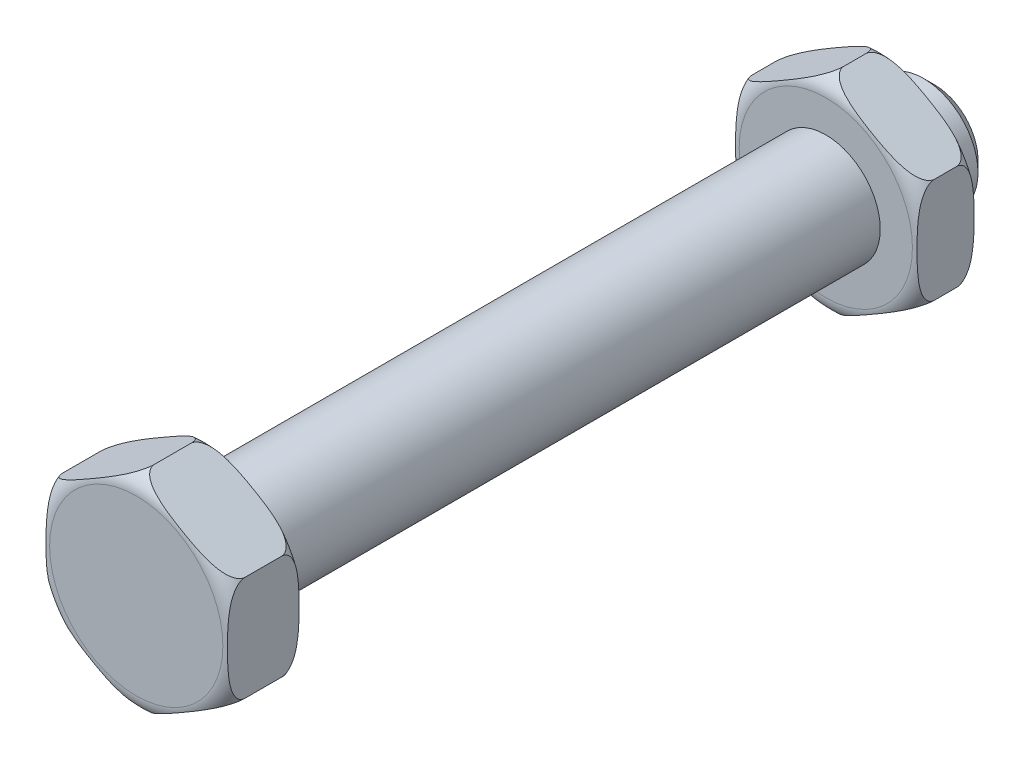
ISO-10303-21;
HEADER;
FILE_DESCRIPTION(('STEP AP214'),'2;1');
FILE_NAME('part.step','',(''),(''),'','','');
FILE_SCHEMA(('AUTOMOTIVE_DESIGN { 1 0 10303 214 1 1 1 1 }'));
ENDSEC;
DATA;
#1=APPLICATION_CONTEXT('core data for automotive mechanical design processes');
#2=APPLICATION_PROTOCOL_DEFINITION('international standard','automotive_design',2000,#1);
#3=PRODUCT_CONTEXT('',#1,'mechanical');
#4=PRODUCT('Part','Part','',(#3));
#5=PRODUCT_RELATED_PRODUCT_CATEGORY('part','',(#4));
#6=PRODUCT_DEFINITION_FORMATION('','',#4);
#7=PRODUCT_DEFINITION_CONTEXT('part definition',#1,'design');
#8=PRODUCT_DEFINITION('design','',#6,#7);
#9=PRODUCT_DEFINITION_SHAPE('','',#8);
#10=(LENGTH_UNIT() NAMED_UNIT(*) SI_UNIT(.MILLI.,.METRE.));
#11=(NAMED_UNIT(*) PLANE_ANGLE_UNIT() SI_UNIT($,.RADIAN.));
#12=(NAMED_UNIT(*) SI_UNIT($,.STERADIAN.) SOLID_ANGLE_UNIT());
#13=UNCERTAINTY_MEASURE_WITH_UNIT(LENGTH_MEASURE(1.E-05),#10,'distance_accuracy_value','');
#14=(GEOMETRIC_REPRESENTATION_CONTEXT(3) GLOBAL_UNCERTAINTY_ASSIGNED_CONTEXT((#13)) GLOBAL_UNIT_ASSIGNED_CONTEXT((#10,
#11,#12)) REPRESENTATION_CONTEXT('',''));
#15=CARTESIAN_POINT('',(0.,0.,0.));
#16=DIRECTION('',(0.,0.,1.));
#17=DIRECTION('',(1.,0.,0.));
#18=AXIS2_PLACEMENT_3D('',#15,#16,#17);
#19=CARTESIAN_POINT('',(0.,-57.,-20.2));
#20=DIRECTION('',(0.,0.,1.));
#21=DIRECTION('',(1.,0.,0.));
#22=AXIS2_PLACEMENT_3D('',#19,#20,#21);
#23=PLANE('',#22);
#24=CARTESIAN_POINT('',(0.,-57.,-20.1999999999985));
#25=DIRECTION('',(0.,0.,1.));
#26=DIRECTION('',(0.,1.,0.));
#27=AXIS2_PLACEMENT_3D('',#24,#25,#26);
#28=CIRCLE('',#27,4.7735);
#29=CARTESIAN_POINT('',(0.,-52.2264999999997,-20.199999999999));
#30=VERTEX_POINT('',#29);
#31=CARTESIAN_POINT('',(-7.58716326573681E-08,-61.7735000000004,-20.1999999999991));
#32=VERTEX_POINT('',#31);
#33=EDGE_CURVE('E163',#30,#32,#28,.T.);
#34=ORIENTED_EDGE('',*,*,#33,.F.);
#35=CARTESIAN_POINT('',(0.,-57.,-20.1999999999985));
#36=DIRECTION('',(0.,0.,1.));
#37=DIRECTION('',(-3.97358502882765E-08,-0.999999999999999,0.));
#38=AXIS2_PLACEMENT_3D('',#35,#36,#37);
#39=CIRCLE('',#38,4.773500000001);
#40=EDGE_CURVE('E229',#32,#30,#39,.T.);
#41=ORIENTED_EDGE('',*,*,#40,.F.);
#42=EDGE_LOOP('',(#34,#41));
#43=FACE_BOUND('',#42,.T.);
#44=CARTESIAN_POINT('',(0.,-57.,-20.2));
#45=DIRECTION('',(0.,0.,1.));
#46=DIRECTION('',(1.,0.,0.));
#47=AXIS2_PLACEMENT_3D('',#44,#45,#46);
#48=CIRCLE('',#47,3.);
#49=CARTESIAN_POINT('',(3.,-57.,-20.2));
#50=VERTEX_POINT('',#49);
#51=EDGE_CURVE('E787',#50,#50,#48,.F.);
#52=ORIENTED_EDGE('',*,*,#51,.F.);
#53=EDGE_LOOP('',(#52));
#54=FACE_BOUND('',#53,.T.);
#55=ADVANCED_FACE('F39',(#43,#54),#23,.F.);
#56=CARTESIAN_POINT('',(0.,-57.,21.));
#57=DIRECTION('',(0.,0.,1.));
#58=DIRECTION('',(1.,0.,0.));
#59=AXIS2_PLACEMENT_3D('',#56,#57,#58);
#60=PLANE('',#59);
#61=CARTESIAN_POINT('',(0.,-57.,20.9999999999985));
#62=DIRECTION('',(0.,0.,-1.));
#63=DIRECTION('',(1.24943986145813E-07,-0.999999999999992,0.));
#64=AXIS2_PLACEMENT_3D('',#61,#62,#63);
#65=CIRCLE('',#64,4.773500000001);
#66=CARTESIAN_POINT('',(1.78926034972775E-07,-61.7735000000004,20.9999999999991));
#67=VERTEX_POINT('',#66);
#68=CARTESIAN_POINT('',(0.,-52.2264999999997,20.999999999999));
#69=VERTEX_POINT('',#68);
#70=EDGE_CURVE('E148',#67,#69,#65,.T.);
#71=ORIENTED_EDGE('',*,*,#70,.F.);
#72=CARTESIAN_POINT('',(0.,-57.,20.9999999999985));
#73=DIRECTION('',(0.,0.,-1.));
#74=DIRECTION('',(0.,1.,0.));
#75=AXIS2_PLACEMENT_3D('',#72,#73,#74);
#76=CIRCLE('',#75,4.7735);
#77=EDGE_CURVE('E154',#69,#67,#76,.T.);
#78=ORIENTED_EDGE('',*,*,#77,.F.);
#79=EDGE_LOOP('',(#71,#78));
#80=FACE_BOUND('',#79,.T.);
#81=ADVANCED_FACE('F153',(#80),#60,.T.);
#82=CARTESIAN_POINT('',(0.,-57.,20.));
#83=DIRECTION('',(0.,0.,1.));
#84=DIRECTION('',(0.,1.,0.));
#85=AXIS2_PLACEMENT_3D('',#82,#83,#84);
#86=TOROIDAL_SURFACE('',#85,4.773500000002,0.9999999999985);
#87=ORIENTED_EDGE('',*,*,#70,.T.);
#88=ORIENTED_EDGE('',*,*,#77,.T.);
#89=EDGE_LOOP('',(#87,#88));
#90=FACE_BOUND('',#89,.T.);
#91=CARTESIAN_POINT('',(5.,-59.8867459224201,19.9998006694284));
#92=CARTESIAN_POINT('',(5.,-59.886754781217,20.0147158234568));
#93=CARTESIAN_POINT('',(5.,-59.8860898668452,20.0296230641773));
#94=CARTESIAN_POINT('',(5.,-59.8834445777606,20.0593094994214));
#95=CARTESIAN_POINT('',(5.,-59.8814651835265,20.0740887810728));
#96=CARTESIAN_POINT('',(5.,-59.8736487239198,20.1178374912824));
#97=CARTESIAN_POINT('',(4.99999999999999,-59.8659322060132,20.1464880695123));
#98=CARTESIAN_POINT('',(4.99999999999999,-59.8460919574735,20.2020893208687));
#99=CARTESIAN_POINT('',(5.,-59.8339800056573,20.2290443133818));
#100=CARTESIAN_POINT('',(5.,-59.8060773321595,20.2810229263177));
#101=CARTESIAN_POINT('',(4.99999999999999,-59.7902785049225,20.3060421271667));
#102=CARTESIAN_POINT('',(4.99999999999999,-59.7448891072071,20.3690166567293));
#103=CARTESIAN_POINT('',(5.,-59.7128711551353,20.4052194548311));
#104=CARTESIAN_POINT('',(5.,-59.6436175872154,20.4722190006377));
#105=CARTESIAN_POINT('',(5.,-59.6063687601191,20.503001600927));
#106=CARTESIAN_POINT('',(5.,-59.5342202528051,20.555537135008));
#107=CARTESIAN_POINT('',(5.,-59.4997934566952,20.5779521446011));
#108=CARTESIAN_POINT('',(5.,-59.429124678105,20.6197345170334));
#109=CARTESIAN_POINT('',(5.,-59.3928813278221,20.6390995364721));
#110=CARTESIAN_POINT('',(4.99999999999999,-59.2819292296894,20.6933596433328));
#111=CARTESIAN_POINT('',(4.99999999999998,-59.2052573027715,20.7242435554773));
#112=CARTESIAN_POINT('',(4.99999999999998,-59.0712620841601,20.7703446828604));
#113=CARTESIAN_POINT('',(4.99999999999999,-59.0145698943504,20.787524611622));
#114=CARTESIAN_POINT('',(5.00000000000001,-58.9002360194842,20.8184586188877));
#115=CARTESIAN_POINT('',(5.,-58.8425940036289,20.8322114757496));
#116=CARTESIAN_POINT('',(5.,-58.6689498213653,20.8692332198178));
#117=CARTESIAN_POINT('',(5.,-58.5520671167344,20.8883166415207));
#118=CARTESIAN_POINT('',(5.,-58.3166873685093,20.919073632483));
#119=CARTESIAN_POINT('',(5.,-58.1981848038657,20.9307002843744));
#120=CARTESIAN_POINT('',(5.,-57.9608289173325,20.9489133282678));
#121=CARTESIAN_POINT('',(5.00000000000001,-57.8419756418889,20.9555003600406));
#122=CARTESIAN_POINT('',(5.00000000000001,-57.6244158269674,20.9645248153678));
#123=CARTESIAN_POINT('',(5.,-57.525728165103,20.9674781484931));
#124=CARTESIAN_POINT('',(5.,-57.3283220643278,20.9717185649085));
#125=CARTESIAN_POINT('',(5.,-57.2296036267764,20.9730057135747));
#126=CARTESIAN_POINT('',(5.,-57.0325233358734,20.9742146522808));
#127=CARTESIAN_POINT('',(5.00000000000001,-56.9341615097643,20.9741414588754));
#128=CARTESIAN_POINT('',(4.99999999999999,-56.7374492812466,20.9726194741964));
#129=CARTESIAN_POINT('',(4.99999999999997,-56.6390988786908,20.9711707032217));
#130=CARTESIAN_POINT('',(4.99999999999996,-56.4056955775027,20.9657247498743));
#131=CARTESIAN_POINT('',(4.99999999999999,-56.2706586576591,20.9609776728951));
#132=CARTESIAN_POINT('',(5.00000000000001,-56.0004745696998,20.9464760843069));
#133=CARTESIAN_POINT('',(4.99999999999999,-55.8653279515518,20.9367092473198));
#134=CARTESIAN_POINT('',(4.99999999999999,-55.6568118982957,20.9152840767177));
#135=CARTESIAN_POINT('',(5.,-55.583155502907,20.9064805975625));
#136=CARTESIAN_POINT('',(5.,-55.4362975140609,20.8857050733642));
#137=CARTESIAN_POINT('',(5.,-55.3630958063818,20.8737338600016));
#138=CARTESIAN_POINT('',(5.,-55.2176792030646,20.8457835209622));
#139=CARTESIAN_POINT('',(5.,-55.1454619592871,20.8298168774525));
#140=CARTESIAN_POINT('',(5.,-55.0023780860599,20.7927526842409));
#141=CARTESIAN_POINT('',(5.,-54.9315103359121,20.7716596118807));
#142=CARTESIAN_POINT('',(5.,-54.8089667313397,20.7288093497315));
#143=CARTESIAN_POINT('',(5.,-54.7568056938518,20.7084546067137));
#144=CARTESIAN_POINT('',(5.,-54.6544030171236,20.6631339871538));
#145=CARTESIAN_POINT('',(5.,-54.6041639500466,20.6381621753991));
#146=CARTESIAN_POINT('',(5.00000000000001,-54.5063700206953,20.582430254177));
#147=CARTESIAN_POINT('',(5.00000000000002,-54.4588421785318,20.5516218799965));
#148=CARTESIAN_POINT('',(4.99999999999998,-54.3688894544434,20.4832646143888));
#149=CARTESIAN_POINT('',(4.99999999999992,-54.3264514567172,20.4457336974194));
#150=CARTESIAN_POINT('',(4.99999999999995,-54.2642274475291,20.3786316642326));
#151=CARTESIAN_POINT('',(4.99999999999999,-54.2419349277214,20.3513974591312));
#152=CARTESIAN_POINT('',(5.00000000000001,-54.2015797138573,20.2938909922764));
#153=CARTESIAN_POINT('',(5.,-54.1835176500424,20.2636182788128));
#154=CARTESIAN_POINT('',(4.99999999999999,-54.1527057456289,20.1999471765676));
#155=CARTESIAN_POINT('',(5.,-54.1400271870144,20.1665136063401));
#156=CARTESIAN_POINT('',(5.,-54.1216551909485,20.0978341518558));
#157=CARTESIAN_POINT('',(5.00000000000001,-54.1159346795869,20.0625958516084));
#158=CARTESIAN_POINT('',(4.99999999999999,-54.1135065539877,20.0183076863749));
#159=CARTESIAN_POINT('',(4.99999999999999,-54.1132578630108,20.0093894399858));
#160=CARTESIAN_POINT('',(4.99999999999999,-54.1132542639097,20.0004754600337));
#161=B_SPLINE_CURVE_WITH_KNOTS('',3,(#91,#92,#93,#94,#95,#96,#97,#98,#99,#100,#101,#102,#103,
#104,#105,#106,#107,#108,#109,#110,#111,#112,#113,#114,#115,#116,#117,#118,#119,#120,#121,#122,
#123,#124,#125,#126,#127,#128,#129,#130,#131,#132,#133,#134,#135,#136,#137,#138,#139,#140,#141,
#142,#143,#144,#145,#146,#147,#148,#149,#150,#151,#152,#153,#154,#155,#156,#157,#158,#159,#160),
.UNSPECIFIED.,.F.,.F.,(4,2,2,2,2,2,2,2,2,2,2,2,2,2,2,2,2,2,2,2,2,2,2,2,2,2,2,2,2,2,2,2,2,2,4),
(0.,0.0447149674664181,0.089396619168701,0.17796034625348,0.266288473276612,0.354812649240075,
0.498974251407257,0.643506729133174,0.766570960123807,0.889729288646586,1.13697558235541,
1.31460038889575,1.49228842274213,1.84715607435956,2.20423516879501,2.56126892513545,
2.85744942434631,3.15361830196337,3.44869521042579,3.74376776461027,4.14908408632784,
4.55540039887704,4.77789147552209,5.00032419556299,5.22207050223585,5.44362383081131,
5.61143026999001,5.77945394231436,5.94893303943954,6.11796557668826,6.22324356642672,
6.32853723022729,6.43518460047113,6.54141566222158,6.56816748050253),.UNSPECIFIED.);
#162=CARTESIAN_POINT('',(4.99999875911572,-59.8867509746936,19.9998006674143));
#163=VERTEX_POINT('',#162);
#164=CARTESIAN_POINT('',(4.9999982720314,-54.1132483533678,20.0004754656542));
#165=VERTEX_POINT('',#164);
#166=EDGE_CURVE('E261',#163,#165,#161,.T.);
#167=ORIENTED_EDGE('',*,*,#166,.T.);
#168=CARTESIAN_POINT('',(4.99999514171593,-54.1132458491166,20.0004754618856));
#169=CARTESIAN_POINT('',(4.99998537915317,-54.1132402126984,20.0153991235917));
#170=CARTESIAN_POINT('',(4.99939145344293,-54.1128973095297,20.0303139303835));
#171=CARTESIAN_POINT('',(4.99706350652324,-54.111553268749,20.0600134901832));
#172=CARTESIAN_POINT('',(4.99533034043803,-54.1105526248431,20.0747983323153));
#173=CARTESIAN_POINT('',(4.9885039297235,-54.1066113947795,20.1185602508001));
#174=CARTESIAN_POINT('',(4.98178242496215,-54.1027307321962,20.1472155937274));
#175=CARTESIAN_POINT('',(4.96452419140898,-54.0927666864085,20.2028192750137));
#176=CARTESIAN_POINT('',(4.9539977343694,-54.0866892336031,20.2297719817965));
#177=CARTESIAN_POINT('',(4.92976157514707,-54.072696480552,20.2817417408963));
#178=CARTESIAN_POINT('',(4.91604483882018,-54.0647771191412,20.3067543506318));
#179=CARTESIAN_POINT('',(4.87662239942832,-54.0420165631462,20.3697518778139));
#180=CARTESIAN_POINT('',(4.84880957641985,-54.0259588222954,20.4059756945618));
#181=CARTESIAN_POINT('',(4.78866467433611,-53.9912341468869,20.473003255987));
#182=CARTESIAN_POINT('',(4.75632114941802,-53.9725606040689,20.5037928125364));
#183=CARTESIAN_POINT('',(4.69366146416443,-53.9363840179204,20.5563501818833));
#184=CARTESIAN_POINT('',(4.66375306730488,-53.9191163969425,20.5787788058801));
#185=CARTESIAN_POINT('',(4.60236372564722,-53.8836732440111,20.6205793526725));
#186=CARTESIAN_POINT('',(4.57088159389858,-53.8654970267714,20.6399489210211));
#187=CARTESIAN_POINT('',(4.47451047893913,-53.8098571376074,20.6942125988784));
#188=CARTESIAN_POINT('',(4.40792192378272,-53.7714122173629,20.7250851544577));
#189=CARTESIAN_POINT('',(4.2914373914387,-53.7041598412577,20.7712012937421));
#190=CARTESIAN_POINT('',(4.24208414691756,-53.675665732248,20.7884008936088));
#191=CARTESIAN_POINT('',(4.14255410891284,-53.6182020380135,20.819353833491));
#192=CARTESIAN_POINT('',(4.09237702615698,-53.5892322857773,20.8331059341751));
#193=CARTESIAN_POINT('',(3.94122483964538,-53.5019645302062,20.8701046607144));
#194=CARTESIAN_POINT('',(3.83948792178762,-53.4432266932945,20.8891449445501));
#195=CARTESIAN_POINT('',(3.63461795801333,-53.3249449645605,20.9197938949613));
#196=CARTESIAN_POINT('',(3.53148016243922,-53.2653983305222,20.9313554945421));
#197=CARTESIAN_POINT('',(3.32490523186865,-53.1461322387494,20.9494359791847));
#198=CARTESIAN_POINT('',(3.22146813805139,-53.0864128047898,20.9559555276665));
#199=CARTESIAN_POINT('',(3.03277495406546,-52.9774707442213,20.9648302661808));
#200=CARTESIAN_POINT('',(2.94753538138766,-52.9282576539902,20.9677176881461));
#201=CARTESIAN_POINT('',(2.77703054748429,-52.8298166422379,20.9718482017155));
#202=CARTESIAN_POINT('',(2.69176528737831,-52.7805887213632,20.9730913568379));
#203=CARTESIAN_POINT('',(2.52154310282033,-52.6823108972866,20.9742232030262));
#204=CARTESIAN_POINT('',(2.43658620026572,-52.6332610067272,20.9741168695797));
#205=CARTESIAN_POINT('',(2.26668265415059,-52.5351671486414,20.9725315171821));
#206=CARTESIAN_POINT('',(2.18173601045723,-52.4861231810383,20.97105251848));
#207=CARTESIAN_POINT('',(1.98010043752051,-52.3697088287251,20.9655316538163));
#208=CARTESIAN_POINT('',(1.86342560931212,-52.3023465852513,20.9607379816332));
#209=CARTESIAN_POINT('',(1.62998230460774,-52.1675680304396,20.9461332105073));
#210=CARTESIAN_POINT('',(1.51321431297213,-52.1001519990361,20.9363097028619));
#211=CARTESIAN_POINT('',(1.33298551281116,-51.9960968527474,20.9147840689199));
#212=CARTESIAN_POINT('',(1.26927461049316,-51.9593133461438,20.9059357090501));
#213=CARTESIAN_POINT('',(1.1422499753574,-51.8859756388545,20.8850626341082));
#214=CARTESIAN_POINT('',(1.07893614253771,-51.8494213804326,20.87303875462));
#215=CARTESIAN_POINT('',(0.953168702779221,-51.7768095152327,20.8449745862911));
#216=CARTESIAN_POINT('',(0.890713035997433,-51.7407507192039,20.8289468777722));
#217=CARTESIAN_POINT('',(0.766979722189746,-51.6693132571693,20.7917518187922));
#218=CARTESIAN_POINT('',(0.705701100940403,-51.6339340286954,20.7705889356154));
#219=CARTESIAN_POINT('',(0.599754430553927,-51.572765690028,20.7276058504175));
#220=CARTESIAN_POINT('',(0.554664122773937,-51.5467327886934,20.707191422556));
#221=CARTESIAN_POINT('',(0.466166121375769,-51.4956384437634,20.6617538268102));
#222=CARTESIAN_POINT('',(0.422760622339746,-51.4705782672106,20.6367248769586));
#223=CARTESIAN_POINT('',(0.338259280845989,-51.4217913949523,20.5808461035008));
#224=CARTESIAN_POINT('',(0.297186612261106,-51.3980780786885,20.5499478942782));
#225=CARTESIAN_POINT('',(0.23896341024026,-51.3644628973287,20.4985904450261));
#226=CARTESIAN_POINT('',(0.220137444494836,-51.3535937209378,20.4806570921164));
#227=CARTESIAN_POINT('',(0.183870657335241,-51.3326550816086,20.4429540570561));
#228=CARTESIAN_POINT('',(0.166431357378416,-51.3225864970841,20.4231824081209));
#229=CARTESIAN_POINT('',(0.129295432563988,-51.3011460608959,20.3766545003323));
#230=CARTESIAN_POINT('',(0.110085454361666,-51.2900551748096,20.3493707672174));
#231=CARTESIAN_POINT('',(0.0753911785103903,-51.2700244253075,20.2918454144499));
#232=CARTESIAN_POINT('',(0.0598981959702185,-51.2610795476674,20.261610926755));
#233=CARTESIAN_POINT('',(0.0355451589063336,-51.247019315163,20.2029743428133));
#234=CARTESIAN_POINT('',(0.0260549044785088,-51.2415401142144,20.1749238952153));
#235=CARTESIAN_POINT('',(0.0112624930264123,-51.2329997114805,20.1174052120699));
#236=CARTESIAN_POINT('',(0.00595068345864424,-51.2299329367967,20.0879404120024));
#237=CARTESIAN_POINT('',(0.00202487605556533,-51.2276663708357,20.0491358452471));
#238=CARTESIAN_POINT('',(0.001321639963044,-51.2272603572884,20.0400415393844));
#239=CARTESIAN_POINT('',(0.000345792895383,-51.2266969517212,20.0218279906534));
#240=CARTESIAN_POINT('',(7.29082095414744E-05,-51.2265394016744,20.0127087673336));
#241=CARTESIAN_POINT('',(1.57866408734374E-05,-51.2265064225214,20.0035839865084));
#242=B_SPLINE_CURVE_WITH_KNOTS('',3,(#168,#169,#170,#171,#172,#173,#174,#175,#176,#177,#178,
#179,#180,#181,#182,#183,#184,#185,#186,#187,#188,#189,#190,#191,#192,#193,#194,#195,#196,#197,
#198,#199,#200,#201,#202,#203,#204,#205,#206,#207,#208,#209,#210,#211,#212,#213,#214,#215,#216,
#217,#218,#219,#220,#221,#222,#223,#224,#225,#226,#227,#228,#229,#230,#231,#232,#233,#234,#235,
#236,#237,#238,#239,#240,#241),.UNSPECIFIED.,.F.,.F.,(4,2,2,2,2,2,2,2,2,2,2,2,2,2,2,2,2,2,2,2,2,
2,2,2,2,2,2,2,2,2,2,2,2,2,2,2,4),(0.,0.0447404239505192,0.0894473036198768,0.178059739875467,
0.266434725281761,0.355006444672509,0.49940770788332,0.644180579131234,0.767539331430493,
0.890992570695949,1.13883192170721,1.31732306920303,1.49587829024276,1.85247967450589,
2.21130403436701,2.57008117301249,2.86547223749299,3.16085189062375,3.45514281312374,
3.74942939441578,4.1538135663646,4.55920020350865,4.78144068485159,5.00362274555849,
5.22511528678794,5.44641582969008,5.61401322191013,5.78182205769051,5.95107956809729,
6.03553635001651,6.12008455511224,6.22525126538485,6.33016980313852,6.42015578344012,
6.509933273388,6.53731487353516,6.56467905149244),.UNSPECIFIED.);
#243=CARTESIAN_POINT('',(8.72722038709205E-08,-51.2265021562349,20.0035840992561));
#244=VERTEX_POINT('',#243);
#245=EDGE_CURVE('E274',#165,#244,#242,.T.);
#246=ORIENTED_EDGE('',*,*,#245,.T.);
#247=CARTESIAN_POINT('',(-1.57866311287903E-05,-51.2265064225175,20.0035839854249));
#248=CARTESIAN_POINT('',(-0.000106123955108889,-51.2265585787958,20.018547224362));
#249=CARTESIAN_POINT('',(-0.000783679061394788,-51.2269497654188,20.0334972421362));
#250=CARTESIAN_POINT('',(-0.00328293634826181,-51.2283927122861,20.0632579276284));
#251=CARTESIAN_POINT('',(-0.00510375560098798,-51.2294439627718,20.0780686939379));
#252=CARTESIAN_POINT('',(-0.0121944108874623,-51.2335377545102,20.1218923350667));
#253=CARTESIAN_POINT('',(-0.0190953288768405,-51.2375220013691,20.1505701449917));
#254=CARTESIAN_POINT('',(-0.0367053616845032,-51.247689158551,20.2061859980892));
#255=CARTESIAN_POINT('',(-0.0474038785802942,-51.2538659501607,20.2331286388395));
#256=CARTESIAN_POINT('',(-0.0719719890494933,-51.2680503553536,20.2850585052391));
#257=CARTESIAN_POINT('',(-0.0858486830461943,-51.276062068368,20.3100411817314));
#258=CARTESIAN_POINT('',(-0.125800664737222,-51.299128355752,20.3731457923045));
#259=CARTESIAN_POINT('',(-0.154005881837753,-51.3154126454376,20.409466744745));
#260=CARTESIAN_POINT('',(-0.214938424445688,-51.3505920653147,20.4766234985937));
#261=CARTESIAN_POINT('',(-0.247677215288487,-51.3694938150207,20.5074449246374));
#262=CARTESIAN_POINT('',(-0.311161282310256,-51.406146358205,20.5601027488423));
#263=CARTESIAN_POINT('',(-0.341506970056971,-51.4236664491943,20.5825939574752));
#264=CARTESIAN_POINT('',(-0.403773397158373,-51.4596159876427,20.6244775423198));
#265=CARTESIAN_POINT('',(-0.435695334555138,-51.4780461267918,20.6438675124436));
#266=CARTESIAN_POINT('',(-0.533387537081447,-51.5344487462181,20.6981455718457));
#267=CARTESIAN_POINT('',(-0.600854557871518,-51.5734008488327,20.7289638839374));
#268=CARTESIAN_POINT('',(-0.71940960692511,-51.6418486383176,20.7751500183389));
#269=CARTESIAN_POINT('',(-0.7699728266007,-51.6710413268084,20.7924410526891));
#270=CARTESIAN_POINT('',(-0.871928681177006,-51.7299055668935,20.8234802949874));
#271=CARTESIAN_POINT('',(-0.923321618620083,-51.7595772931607,20.8372271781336));
#272=CARTESIAN_POINT('',(-1.07811667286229,-51.8489482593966,20.8741127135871));
#273=CARTESIAN_POINT('',(-1.18227688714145,-51.9090851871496,20.892946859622));
#274=CARTESIAN_POINT('',(-1.39198430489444,-52.0301598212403,20.9230836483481));
#275=CARTESIAN_POINT('',(-1.49753610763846,-52.091100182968,20.9343385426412));
#276=CARTESIAN_POINT('',(-1.70891849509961,-52.2131418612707,20.951796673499));
#277=CARTESIAN_POINT('',(-1.81474903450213,-52.2742431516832,20.9580006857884));
#278=CARTESIAN_POINT('',(-2.00486715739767,-52.3840079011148,20.9661930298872));
#279=CARTESIAN_POINT('',(-2.08913783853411,-52.4326616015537,20.9687837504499));
#280=CARTESIAN_POINT('',(-2.25770079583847,-52.5299814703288,20.9724151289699));
#281=CARTESIAN_POINT('',(-2.34199307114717,-52.5786476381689,20.9734558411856));
#282=CARTESIAN_POINT('',(-2.51027156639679,-52.6758032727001,20.9742275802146));
#283=CARTESIAN_POINT('',(-2.59425777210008,-52.7242927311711,20.9739634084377));
#284=CARTESIAN_POINT('',(-2.76221805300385,-52.821264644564,20.9720703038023));
#285=CARTESIAN_POINT('',(-2.84619212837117,-52.8697470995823,20.970441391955));
#286=CARTESIAN_POINT('',(-3.04543081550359,-52.9847776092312,20.9645494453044));
#287=CARTESIAN_POINT('',(-3.16068009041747,-53.0513168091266,20.9595303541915));
#288=CARTESIAN_POINT('',(-3.39126179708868,-53.1844432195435,20.9444364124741));
#289=CARTESIAN_POINT('',(-3.50659370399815,-53.2510301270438,20.9343488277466));
#290=CARTESIAN_POINT('',(-3.68494160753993,-53.3539993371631,20.9123675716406));
#291=CARTESIAN_POINT('',(-3.74821471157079,-53.3905300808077,20.9033146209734));
#292=CARTESIAN_POINT('',(-3.87434885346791,-53.4633536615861,20.8820027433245));
#293=CARTESIAN_POINT('',(-3.9372099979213,-53.4996465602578,20.8697446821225));
#294=CARTESIAN_POINT('',(-4.06204708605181,-53.5717212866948,20.8411833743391));
#295=CARTESIAN_POINT('',(-4.1240252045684,-53.6075043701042,20.8248930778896));
#296=CARTESIAN_POINT('',(-4.24676940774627,-53.6783707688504,20.7871432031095));
#297=CARTESIAN_POINT('',(-4.30753652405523,-53.7134546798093,20.7656882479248));
#298=CARTESIAN_POINT('',(-4.41228724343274,-53.7739325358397,20.7222700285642));
#299=CARTESIAN_POINT('',(-4.45671077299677,-53.7995804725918,20.7017398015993));
#300=CARTESIAN_POINT('',(-4.54385478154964,-53.8498930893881,20.6561105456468));
#301=CARTESIAN_POINT('',(-4.58657305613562,-53.8745564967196,20.6310058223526));
#302=CARTESIAN_POINT('',(-4.66967517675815,-53.9225355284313,20.575036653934));
#303=CARTESIAN_POINT('',(-4.71003559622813,-53.9458376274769,20.5441242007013));
#304=CARTESIAN_POINT('',(-4.76718296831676,-53.9788316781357,20.4928210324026));
#305=CARTESIAN_POINT('',(-4.78564957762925,-53.9894933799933,20.4749181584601));
#306=CARTESIAN_POINT('',(-4.82119751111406,-54.0100169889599,20.4373080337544));
#307=CARTESIAN_POINT('',(-4.83827730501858,-54.0198780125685,20.4175988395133));
#308=CARTESIAN_POINT('',(-4.87473558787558,-54.0409272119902,20.3710990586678));
#309=CARTESIAN_POINT('',(-4.89361222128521,-54.0518256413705,20.3437739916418));
#310=CARTESIAN_POINT('',(-4.92761784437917,-54.0714587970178,20.2862096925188));
#311=CARTESIAN_POINT('',(-4.9427555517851,-54.0801985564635,20.2559774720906));
#312=CARTESIAN_POINT('',(-4.96646209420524,-54.0938855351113,20.1973539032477));
#313=CARTESIAN_POINT('',(-4.9756554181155,-54.0991933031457,20.1693018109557));
#314=CARTESIAN_POINT('',(-4.98985063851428,-54.1073889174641,20.111835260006));
#315=CARTESIAN_POINT('',(-4.99486208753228,-54.1102822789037,20.0824240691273));
#316=CARTESIAN_POINT('',(-4.99838790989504,-54.1123179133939,20.043971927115));
#317=CARTESIAN_POINT('',(-4.99899293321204,-54.1126672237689,20.0351494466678));
#318=CARTESIAN_POINT('',(-4.99979776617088,-54.1131318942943,20.0174860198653));
#319=CARTESIAN_POINT('',(-4.99999785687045,-54.1132474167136,20.0086450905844));
#320=CARTESIAN_POINT('',(-4.9999953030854,-54.1132459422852,19.999800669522));
#321=B_SPLINE_CURVE_WITH_KNOTS('',3,(#247,#248,#249,#250,#251,#252,#253,#254,#255,#256,#257,
#258,#259,#260,#261,#262,#263,#264,#265,#266,#267,#268,#269,#270,#271,#272,#273,#274,#275,#276,
#277,#278,#279,#280,#281,#282,#283,#284,#285,#286,#287,#288,#289,#290,#291,#292,#293,#294,#295,
#296,#297,#298,#299,#300,#301,#302,#303,#304,#305,#306,#307,#308,#309,#310,#311,#312,#313,#314,
#315,#316,#317,#318,#319,#320),.UNSPECIFIED.,.F.,.F.,(4,2,2,2,2,2,2,2,2,2,2,2,2,2,2,2,2,2,2,2,2,
2,2,2,2,2,2,2,2,2,2,2,2,2,2,2,4),(0.,0.0448599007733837,0.0896851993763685,0.178526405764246,
0.267121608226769,0.355916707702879,0.501433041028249,0.64732434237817,0.772055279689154,
0.896882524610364,1.14748498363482,1.33006670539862,1.5127165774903,1.8775045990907,
2.24456976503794,2.61157854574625,2.90359185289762,3.19559493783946,3.486524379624,
3.77744934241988,4.17692157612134,4.5774025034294,4.79821053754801,5.01895898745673,
5.23900746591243,5.45885969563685,5.62443734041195,5.79022252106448,5.95744376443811,
6.04088573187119,6.12441855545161,6.22895513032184,6.33324561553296,6.42286595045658,
6.51228100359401,6.53882247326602,6.56534551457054),.UNSPECIFIED.);
#322=CARTESIAN_POINT('',(-4.99999875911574,-54.1132490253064,19.9998006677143));
#323=VERTEX_POINT('',#322);
#324=EDGE_CURVE('E254',#244,#323,#321,.T.);
#325=ORIENTED_EDGE('',*,*,#324,.T.);
#326=CARTESIAN_POINT('',(-5.,-54.1132540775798,19.9998006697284));
#327=CARTESIAN_POINT('',(-5.,-54.1132452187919,20.0147158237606));
#328=CARTESIAN_POINT('',(-5.,-54.1139101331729,20.0296230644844));
#329=CARTESIAN_POINT('',(-5.,-54.1165554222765,20.0593094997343));
#330=CARTESIAN_POINT('',(-5.,-54.1185348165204,20.0740887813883));
#331=CARTESIAN_POINT('',(-5.,-54.1263512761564,20.1178374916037));
#332=CARTESIAN_POINT('',(-5.,-54.1340677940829,20.1464880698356));
#333=CARTESIAN_POINT('',(-5.,-54.1539080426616,20.2020893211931));
#334=CARTESIAN_POINT('',(-5.,-54.1660199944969,20.2290443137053));
#335=CARTESIAN_POINT('',(-5.,-54.1939226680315,20.2810229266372));
#336=CARTESIAN_POINT('',(-5.,-54.2097214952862,20.3060421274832));
#337=CARTESIAN_POINT('',(-4.99999999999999,-54.2551108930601,20.369016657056));
#338=CARTESIAN_POINT('',(-5.,-54.2871288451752,20.4052194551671));
#339=CARTESIAN_POINT('',(-5.,-54.356382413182,20.4722190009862));
#340=CARTESIAN_POINT('',(-5.,-54.3936312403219,20.5030016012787));
#341=CARTESIAN_POINT('',(-5.,-54.4657797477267,20.5555371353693));
#342=CARTESIAN_POINT('',(-5.,-54.5002065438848,20.5779521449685));
#343=CARTESIAN_POINT('',(-5.,-54.5708753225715,20.6197345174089));
#344=CARTESIAN_POINT('',(-5.,-54.6071186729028,20.6390995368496));
#345=CARTESIAN_POINT('',(-5.,-54.7180707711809,20.6933596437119));
#346=CARTESIAN_POINT('',(-4.99999999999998,-54.7947426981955,20.7242435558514));
#347=CARTESIAN_POINT('',(-4.99999999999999,-54.9287379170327,20.7703446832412));
#348=CARTESIAN_POINT('',(-5.,-54.9854301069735,20.7875246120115));
#349=CARTESIAN_POINT('',(-5.,-55.0997639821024,20.8184586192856));
#350=CARTESIAN_POINT('',(-5.,-55.1574059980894,20.8322114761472));
#351=CARTESIAN_POINT('',(-5.,-55.3310501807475,20.8692332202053));
#352=CARTESIAN_POINT('',(-5.,-55.447932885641,20.8883166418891));
#353=CARTESIAN_POINT('',(-5.,-55.68331263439,20.9190736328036));
#354=CARTESIAN_POINT('',(-5.,-55.8018151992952,20.9307002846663));
#355=CARTESIAN_POINT('',(-5.,-56.039171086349,20.9489133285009));
#356=CARTESIAN_POINT('',(-5.00000000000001,-56.1580243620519,20.9555003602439));
#357=CARTESIAN_POINT('',(-5.00000000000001,-56.3755841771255,20.9645248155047));
#358=CARTESIAN_POINT('',(-5.,-56.4742718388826,20.9674781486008));
#359=CARTESIAN_POINT('',(-5.,-56.6716779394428,20.9717185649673));
#360=CARTESIAN_POINT('',(-5.,-56.7703963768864,20.9730057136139));
#361=CARTESIAN_POINT('',(-5.,-56.9674766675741,20.9742146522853));
#362=CARTESIAN_POINT('',(-5.00000000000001,-57.0658384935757,20.9741414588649));
#363=CARTESIAN_POINT('',(-4.99999999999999,-57.2625507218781,20.9726194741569));
#364=CARTESIAN_POINT('',(-4.99999999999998,-57.3609011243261,20.9711707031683));
#365=CARTESIAN_POINT('',(-4.99999999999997,-57.5943044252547,20.9657247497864));
#366=CARTESIAN_POINT('',(-5.,-57.7293413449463,20.9609776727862));
#367=CARTESIAN_POINT('',(-5.,-57.9995254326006,20.9464760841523));
#368=CARTESIAN_POINT('',(-4.99999999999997,-58.1346720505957,20.9367092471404));
#369=CARTESIAN_POINT('',(-4.99999999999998,-58.3431881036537,20.915284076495));
#370=CARTESIAN_POINT('',(-5.,-58.4168444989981,20.9064805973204));
#371=CARTESIAN_POINT('',(-5.,-58.563702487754,20.88570507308));
#372=CARTESIAN_POINT('',(-5.,-58.6369041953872,20.8737338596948));
#373=CARTESIAN_POINT('',(-5.,-58.7823207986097,20.8457835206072));
#374=CARTESIAN_POINT('',(-5.,-58.8545380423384,20.8298168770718));
#375=CARTESIAN_POINT('',(-5.,-58.9976219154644,20.7927526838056));
#376=CARTESIAN_POINT('',(-5.,-59.0684896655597,20.7716596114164));
#377=CARTESIAN_POINT('',(-5.,-59.19103327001,20.7288093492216));
#378=CARTESIAN_POINT('',(-5.,-59.2431943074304,20.7084546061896));
#379=CARTESIAN_POINT('',(-5.,-59.3455969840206,20.663133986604));
#380=CARTESIAN_POINT('',(-5.,-59.3958360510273,20.6381621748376));
#381=CARTESIAN_POINT('',(-5.00000000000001,-59.4936299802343,20.5824302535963));
#382=CARTESIAN_POINT('',(-5.00000000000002,-59.5411578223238,20.551621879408));
#383=CARTESIAN_POINT('',(-4.99999999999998,-59.6311105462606,20.4832646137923));
#384=CARTESIAN_POINT('',(-4.99999999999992,-59.6735485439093,20.4457336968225));
#385=CARTESIAN_POINT('',(-4.99999999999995,-59.7357725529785,20.3786316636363));
#386=CARTESIAN_POINT('',(-4.99999999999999,-59.7580650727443,20.3513974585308));
#387=CARTESIAN_POINT('',(-5.00000000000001,-59.7984202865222,20.2938909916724));
#388=CARTESIAN_POINT('',(-5.,-59.8164823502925,20.2636182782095));
#389=CARTESIAN_POINT('',(-5.,-59.8472942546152,20.1999471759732));
#390=CARTESIAN_POINT('',(-5.,-59.8599728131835,20.1665136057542));
#391=CARTESIAN_POINT('',(-5.,-59.8783448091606,20.0978341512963));
#392=CARTESIAN_POINT('',(-5.,-59.8840653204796,20.0625958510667));
#393=CARTESIAN_POINT('',(-4.99999999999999,-59.8864934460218,20.0183076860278));
#394=CARTESIAN_POINT('',(-4.99999999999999,-59.8867421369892,20.0093894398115));
#395=CARTESIAN_POINT('',(-4.99999999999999,-59.8867457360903,20.000475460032));
#396=B_SPLINE_CURVE_WITH_KNOTS('',3,(#326,#327,#328,#329,#330,#331,#332,#333,#334,#335,#336,
#337,#338,#339,#340,#341,#342,#343,#344,#345,#346,#347,#348,#349,#350,#351,#352,#353,#354,#355,
#356,#357,#358,#359,#360,#361,#362,#363,#364,#365,#366,#367,#368,#369,#370,#371,#372,#373,#374,
#375,#376,#377,#378,#379,#380,#381,#382,#383,#384,#385,#386,#387,#388,#389,#390,#391,#392,#393,
#394,#395),.UNSPECIFIED.,.F.,.F.,(4,2,2,2,2,2,2,2,2,2,2,2,2,2,2,2,2,2,2,2,2,2,2,2,2,2,2,2,2,2,2,
2,2,2,4),(0.,0.0447149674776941,0.0893966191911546,0.177960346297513,0.266288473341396,
0.354812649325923,0.498974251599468,0.643506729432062,0.766570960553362,0.889729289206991,
1.13697558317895,1.31460039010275,1.49228842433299,1.84715607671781,2.2042351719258,
2.56126892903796,2.85744942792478,3.1536183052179,3.44869521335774,3.74376776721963,
4.14908408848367,4.5554004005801,4.77789147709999,5.00032419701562,5.22207050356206,
5.44362383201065,5.61143027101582,5.77945394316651,5.94893304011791,6.11796557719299,
6.22324356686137,6.32853723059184,6.43518460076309,6.54141566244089,6.56816748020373),.UNSPECIFIED.);
#397=CARTESIAN_POINT('',(-4.9999985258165,-59.886751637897,20.0004754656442));
#398=VERTEX_POINT('',#397);
#399=EDGE_CURVE('E255',#323,#398,#396,.T.);
#400=ORIENTED_EDGE('',*,*,#399,.T.);
#401=CARTESIAN_POINT('',(-4.99999514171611,-59.8867541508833,20.0004754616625));
#402=CARTESIAN_POINT('',(-4.99998537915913,-59.8867597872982,20.0153991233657));
#403=CARTESIAN_POINT('',(-4.99939145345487,-59.8871026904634,20.030313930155));
#404=CARTESIAN_POINT('',(-4.99706350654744,-59.8884467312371,20.0600134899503));
#405=CARTESIAN_POINT('',(-4.99533034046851,-59.8894473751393,20.0747983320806));
#406=CARTESIAN_POINT('',(-4.9885039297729,-59.893388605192,20.1185602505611));
#407=CARTESIAN_POINT('',(-4.98178242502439,-59.8972692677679,20.1472155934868));
#408=CARTESIAN_POINT('',(-4.96452419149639,-59.907233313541,20.2028192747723));
#409=CARTESIAN_POINT('',(-4.95399773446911,-59.9133107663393,20.2297719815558));
#410=CARTESIAN_POINT('',(-4.92976157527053,-59.9273035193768,20.2817417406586));
#411=CARTESIAN_POINT('',(-4.91604483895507,-59.9352228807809,20.3067543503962));
#412=CARTESIAN_POINT('',(-4.87662239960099,-59.9579834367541,20.3697518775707));
#413=CARTESIAN_POINT('',(-4.84880957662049,-59.9740411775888,20.4059756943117));
#414=CARTESIAN_POINT('',(-4.78866467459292,-60.0087658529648,20.4730032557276));
#415=CARTESIAN_POINT('',(-4.756321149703,-60.0274393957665,20.5037928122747));
#416=CARTESIAN_POINT('',(-4.69366146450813,-60.0636159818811,20.5563501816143));
#417=CARTESIAN_POINT('',(-4.66375306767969,-60.0808836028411,20.5787788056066));
#418=CARTESIAN_POINT('',(-4.60236372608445,-60.1163267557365,20.620579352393));
#419=CARTESIAN_POINT('',(-4.57088159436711,-60.1345029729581,20.6399489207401));
#420=CARTESIAN_POINT('',(-4.47451047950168,-60.1901428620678,20.6942125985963));
#421=CARTESIAN_POINT('',(-4.4079219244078,-60.2285877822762,20.7250851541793));
#422=CARTESIAN_POINT('',(-4.29143739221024,-60.2958401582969,20.7712012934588));
#423=CARTESIAN_POINT('',(-4.24208414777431,-60.3243342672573,20.7884008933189));
#424=CARTESIAN_POINT('',(-4.14255410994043,-60.3817979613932,20.8193538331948));
#425=CARTESIAN_POINT('',(-4.09237702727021,-60.41076771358,20.8331059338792));
#426=CARTESIAN_POINT('',(-3.94122484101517,-60.4980354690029,20.8701046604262));
#427=CARTESIAN_POINT('',(-3.83948792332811,-60.5567733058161,20.8891449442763));
#428=CARTESIAN_POINT('',(-3.63461795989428,-60.6750550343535,20.9197938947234));
#429=CARTESIAN_POINT('',(-3.53148016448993,-60.7346016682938,20.9313554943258));
#430=CARTESIAN_POINT('',(-3.3249052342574,-60.8538677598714,20.9494359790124));
#431=CARTESIAN_POINT('',(-3.22146814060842,-60.9135871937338,20.9559555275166));
#432=CARTESIAN_POINT('',(-3.03277495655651,-61.0225292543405,20.9648302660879));
#433=CARTESIAN_POINT('',(-2.94753538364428,-61.071742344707,20.9677176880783));
#434=CARTESIAN_POINT('',(-2.77703054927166,-61.1701833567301,20.9718482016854));
#435=CARTESIAN_POINT('',(-2.69176528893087,-61.2194112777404,20.9730913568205));
#436=CARTESIAN_POINT('',(-2.52154310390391,-61.3176891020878,20.9742232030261));
#437=CARTESIAN_POINT('',(-2.43658620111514,-61.3667389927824,20.9741168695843));
#438=CARTESIAN_POINT('',(-2.26668265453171,-61.4648328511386,20.972531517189));
#439=CARTESIAN_POINT('',(-2.1817360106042,-61.5138768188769,20.9710525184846));
#440=CARTESIAN_POINT('',(-1.98010043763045,-61.6302911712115,20.9655316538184));
#441=CARTESIAN_POINT('',(-1.86342560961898,-61.6976534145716,20.9607379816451));
#442=CARTESIAN_POINT('',(-1.62998230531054,-61.8324319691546,20.9461332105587));
#443=CARTESIAN_POINT('',(-1.51321431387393,-61.8998480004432,20.9363097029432));
#444=CARTESIAN_POINT('',(-1.33298551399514,-62.003903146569,20.9147840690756));
#445=CARTESIAN_POINT('',(-1.26927461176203,-62.0406866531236,20.9059357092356));
#446=CARTESIAN_POINT('',(-1.1422499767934,-62.1140243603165,20.8850626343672));
#447=CARTESIAN_POINT('',(-1.07893614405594,-62.1505786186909,20.8730387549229));
#448=CARTESIAN_POINT('',(-0.953168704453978,-62.2231904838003,20.8449745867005));
#449=CARTESIAN_POINT('',(-0.890713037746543,-62.2592492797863,20.8289468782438));
#450=CARTESIAN_POINT('',(-0.766979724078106,-62.3306867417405,20.791751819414));
#451=CARTESIAN_POINT('',(-0.705701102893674,-62.3660659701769,20.7705889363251));
#452=CARTESIAN_POINT('',(-0.599754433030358,-62.4272343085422,20.7276058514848));
#453=CARTESIAN_POINT('',(-0.554664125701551,-62.4532672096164,20.7071914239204));
#454=CARTESIAN_POINT('',(-0.466166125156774,-62.5043615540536,20.6617538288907));
#455=CARTESIAN_POINT('',(-0.422760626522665,-62.5294217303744,20.6367248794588));
#456=CARTESIAN_POINT('',(-0.33825928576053,-62.5782086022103,20.5808461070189));
#457=CARTESIAN_POINT('',(-0.297186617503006,-62.6019219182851,20.5499478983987));
#458=CARTESIAN_POINT('',(-0.238963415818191,-62.6355370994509,20.4985904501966));
#459=CARTESIAN_POINT('',(-0.220137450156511,-62.6464062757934,20.4806570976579));
#460=CARTESIAN_POINT('',(-0.183870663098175,-62.6673449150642,20.4429540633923));
#461=CARTESIAN_POINT('',(-0.166431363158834,-62.6774134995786,20.4231824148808));
#462=CARTESIAN_POINT('',(-0.129295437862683,-62.6988539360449,20.3766545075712));
#463=CARTESIAN_POINT('',(-0.110085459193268,-62.7099448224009,20.3493707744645));
#464=CARTESIAN_POINT('',(-0.0753911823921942,-62.7299755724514,20.2918454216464));
#465=CARTESIAN_POINT('',(-0.0598981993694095,-62.7389204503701,20.2616109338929));
#466=CARTESIAN_POINT('',(-0.0355451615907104,-62.7529806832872,20.2029743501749));
#467=CARTESIAN_POINT('',(-0.0260549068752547,-62.7584598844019,20.1749239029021));
#468=CARTESIAN_POINT('',(-0.0112624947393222,-62.7670002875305,20.1174052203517));
#469=CARTESIAN_POINT('',(-0.00595068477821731,-62.7700670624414,20.0879404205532));
#470=CARTESIAN_POINT('',(-0.00202487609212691,-62.7723336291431,20.0491358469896));
#471=CARTESIAN_POINT('',(-0.00132163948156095,-62.7727396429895,20.0400415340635));
#472=CARTESIAN_POINT('',(-0.000345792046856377,-62.7733030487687,20.0218279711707));
#473=CARTESIAN_POINT('',(-7.29075117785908E-05,-62.7734605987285,20.0127087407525));
#474=CARTESIAN_POINT('',(-1.57864318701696E-05,-62.7734935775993,20.0035839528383));
#475=B_SPLINE_CURVE_WITH_KNOTS('',3,(#401,#402,#403,#404,#405,#406,#407,#408,#409,#410,#411,
#412,#413,#414,#415,#416,#417,#418,#419,#420,#421,#422,#423,#424,#425,#426,#427,#428,#429,#430,
#431,#432,#433,#434,#435,#436,#437,#438,#439,#440,#441,#442,#443,#444,#445,#446,#447,#448,#449,
#450,#451,#452,#453,#454,#455,#456,#457,#458,#459,#460,#461,#462,#463,#464,#465,#466,#467,#468,
#469,#470,#471,#472,#473,#474),.UNSPECIFIED.,.F.,.F.,(4,2,2,2,2,2,2,2,2,2,2,2,2,2,2,2,2,2,2,2,2,
2,2,2,2,2,2,2,2,2,2,2,2,2,2,2,4),(0.,0.0447404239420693,0.0894473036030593,0.178059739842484,
0.266434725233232,0.3550064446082,0.499407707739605,0.644180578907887,0.767539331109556,
0.890992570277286,1.13883192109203,1.31732306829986,1.49587828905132,1.8524796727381,
2.21130403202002,2.57008117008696,2.86547223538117,3.16085188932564,3.45514281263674,
3.74942939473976,4.15381356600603,4.55920020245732,4.78144068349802,5.00362274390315,
5.22511528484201,5.44641582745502,5.61401321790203,5.78182205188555,5.95107956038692,
6.03553634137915,6.12008454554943,6.2252512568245,6.33016979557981,6.42015577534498,
6.50993326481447,6.53731488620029,6.56467908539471),.UNSPECIFIED.);
#476=CARTESIAN_POINT('',(1.86355589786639E-07,-62.7734979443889,20.0035840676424));
#477=VERTEX_POINT('',#476);
#478=EDGE_CURVE('E373',#398,#477,#475,.T.);
#479=ORIENTED_EDGE('',*,*,#478,.T.);
#480=CARTESIAN_POINT('',(1.57864432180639E-05,-62.773493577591,20.0035839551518));
#481=CARTESIAN_POINT('',(0.000106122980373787,-62.773441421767,20.0185471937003));
#482=CARTESIAN_POINT('',(0.00078367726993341,-62.7730502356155,20.0334972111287));
#483=CARTESIAN_POINT('',(0.00328293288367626,-62.7716072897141,20.0632578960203));
#484=CARTESIAN_POINT('',(0.00510375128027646,-62.7705560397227,20.0780686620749));
#485=CARTESIAN_POINT('',(0.0121944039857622,-62.7664622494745,20.1218923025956));
#486=CARTESIAN_POINT('',(0.0190953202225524,-62.7624780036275,20.1505701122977));
#487=CARTESIAN_POINT('',(0.0367053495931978,-62.7523108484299,20.2061859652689));
#488=CARTESIAN_POINT('',(0.047403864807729,-62.7461340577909,20.2331286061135));
#489=CARTESIAN_POINT('',(0.0719719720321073,-62.7319496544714,20.2850584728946));
#490=CARTESIAN_POINT('',(0.085848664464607,-62.72393794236,20.3100411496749));
#491=CARTESIAN_POINT('',(0.125800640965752,-62.7008716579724,20.3731457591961));
#492=CARTESIAN_POINT('',(0.15400585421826,-62.6845873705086,20.4094667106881));
#493=CARTESIAN_POINT('',(0.214938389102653,-62.6494079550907,20.4766234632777));
#494=CARTESIAN_POINT('',(0.247677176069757,-62.6305062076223,20.5074448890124));
#495=CARTESIAN_POINT('',(0.311161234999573,-62.5938536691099,20.5601027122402));
#496=CARTESIAN_POINT('',(0.3415069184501,-62.576333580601,20.5825939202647));
#497=CARTESIAN_POINT('',(0.403773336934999,-62.5403840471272,20.6244775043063));
#498=CARTESIAN_POINT('',(0.43569527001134,-62.5219539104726,20.6438674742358));
#499=CARTESIAN_POINT('',(0.533387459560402,-62.4655512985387,20.6981455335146));
#500=CARTESIAN_POINT('',(0.600854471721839,-62.4265992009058,20.7289638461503));
#501=CARTESIAN_POINT('',(0.719409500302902,-62.3581514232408,20.7751499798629));
#502=CARTESIAN_POINT('',(0.769972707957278,-62.3289587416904,20.792441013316));
#503=CARTESIAN_POINT('',(0.871928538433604,-62.2700945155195,20.8234802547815));
#504=CARTESIAN_POINT('',(0.923321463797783,-62.240422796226,20.8372271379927));
#505=CARTESIAN_POINT('',(1.07811648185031,-62.1510518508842,20.8741126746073));
#506=CARTESIAN_POINT('',(1.18227667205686,-62.0909149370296,20.8929468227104));
#507=CARTESIAN_POINT('',(1.39198404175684,-61.9698403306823,20.9230836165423));
#508=CARTESIAN_POINT('',(1.49753582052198,-61.9088999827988,20.9343385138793));
#509=CARTESIAN_POINT('',(1.7089181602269,-61.7868583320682,20.9517966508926));
#510=CARTESIAN_POINT('',(1.81474867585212,-61.7257570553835,20.9580006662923));
#511=CARTESIAN_POINT('',(2.00486678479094,-61.6159923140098,20.966193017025));
#512=CARTESIAN_POINT('',(2.08913747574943,-61.5673386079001,20.9687837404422));
#513=CARTESIAN_POINT('',(2.25770045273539,-61.4700187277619,20.9724151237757));
#514=CARTESIAN_POINT('',(2.34199273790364,-61.4213525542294,20.9734558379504));
#515=CARTESIAN_POINT('',(2.51027125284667,-61.3241969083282,20.9742275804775));
#516=CARTESIAN_POINT('',(2.59425746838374,-61.2757074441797,20.9739634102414));
#517=CARTESIAN_POINT('',(2.76221776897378,-61.1787355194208,20.9720703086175));
#518=CARTESIAN_POINT('',(2.84619185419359,-61.1302530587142,20.9704413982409));
#519=CARTESIAN_POINT('',(3.04543056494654,-61.015222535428,20.9645494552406));
#520=CARTESIAN_POINT('',(3.16067985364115,-60.9486833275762,20.9595303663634));
#521=CARTESIAN_POINT('',(3.39126158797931,-60.8155569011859,20.9444364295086));
#522=CARTESIAN_POINT('',(3.5065935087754,-60.7489699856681,20.9343488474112));
#523=CARTESIAN_POINT('',(3.684941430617,-60.6460007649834,20.9123675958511));
#524=CARTESIAN_POINT('',(3.74821453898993,-60.6094700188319,20.9033146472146));
#525=CARTESIAN_POINT('',(3.87434868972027,-60.5366464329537,20.8820027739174));
#526=CARTESIAN_POINT('',(3.93720983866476,-60.500353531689,20.8697447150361));
#527=CARTESIAN_POINT('',(4.062046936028,-60.4282787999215,20.8411834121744));
#528=CARTESIAN_POINT('',(4.12402505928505,-60.3924957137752,20.8248931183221));
#529=CARTESIAN_POINT('',(4.24676927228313,-60.3216293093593,20.7871432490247));
#530=CARTESIAN_POINT('',(4.30753639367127,-60.286545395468,20.7656882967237));
#531=CARTESIAN_POINT('',(4.41228712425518,-60.2260675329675,20.7222700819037));
#532=CARTESIAN_POINT('',(4.45671065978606,-60.2004195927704,20.7017398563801));
#533=CARTESIAN_POINT('',(4.54385468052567,-60.1501069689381,20.6561106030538));
#534=CARTESIAN_POINT('',(4.58657296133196,-60.1254435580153,20.6310058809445));
#535=CARTESIAN_POINT('',(4.66967509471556,-60.077464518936,20.5750367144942));
#536=CARTESIAN_POINT('',(4.71003552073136,-60.0541624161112,20.5441242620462));
#537=CARTESIAN_POINT('',(4.76718290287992,-60.0211683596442,20.4928210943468));
#538=CARTESIAN_POINT('',(4.78564951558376,-60.0105066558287,20.4749182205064));
#539=CARTESIAN_POINT('',(4.82119745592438,-59.9899830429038,20.4373080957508));
#540=CARTESIAN_POINT('',(4.83827725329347,-59.980122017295,20.4175989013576));
#541=CARTESIAN_POINT('',(4.87473554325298,-59.9590728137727,20.3710991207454));
#542=CARTESIAN_POINT('',(4.89361218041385,-59.9481743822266,20.3437740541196));
#543=CARTESIAN_POINT('',(4.92761781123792,-59.9285412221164,20.2862097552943));
#544=CARTESIAN_POINT('',(4.94275552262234,-59.9198014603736,20.255977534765));
#545=CARTESIAN_POINT('',(4.96646207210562,-59.9061144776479,20.1973539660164));
#546=CARTESIAN_POINT('',(4.97565539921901,-59.9008067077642,20.1693018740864));
#547=CARTESIAN_POINT('',(4.98985062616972,-59.892611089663,20.1118353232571));
#548=CARTESIAN_POINT('',(4.9948620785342,-59.8897177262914,20.0824241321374));
#549=CARTESIAN_POINT('',(4.99838790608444,-59.8876820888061,20.0439719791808));
#550=CARTESIAN_POINT('',(4.99899293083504,-59.8873327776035,20.0351494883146));
#551=CARTESIAN_POINT('',(4.99979776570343,-59.8868681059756,20.017486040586));
#552=CARTESIAN_POINT('',(4.99999785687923,-59.8867525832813,20.0086451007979));
#553=CARTESIAN_POINT('',(4.9999953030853,-59.8867540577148,19.999800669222));
#554=B_SPLINE_CURVE_WITH_KNOTS('',3,(#480,#481,#482,#483,#484,#485,#486,#487,#488,#489,#490,
#491,#492,#493,#494,#495,#496,#497,#498,#499,#500,#501,#502,#503,#504,#505,#506,#507,#508,#509,
#510,#511,#512,#513,#514,#515,#516,#517,#518,#519,#520,#521,#522,#523,#524,#525,#526,#527,#528,
#529,#530,#531,#532,#533,#534,#535,#536,#537,#538,#539,#540,#541,#542,#543,#544,#545,#546,#547,
#548,#549,#550,#551,#552,#553),.UNSPECIFIED.,.F.,.F.,(4,2,2,2,2,2,2,2,2,2,2,2,2,2,2,2,2,2,2,2,2,
2,2,2,2,2,2,2,2,2,2,2,2,2,2,2,4),(0.,0.044859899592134,0.0896851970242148,0.178526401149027,
0.267121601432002,0.355916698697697,0.501433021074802,0.647324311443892,0.772055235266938,
0.896882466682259,1.14748489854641,1.33006657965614,1.51271641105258,1.87750435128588,
2.24456943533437,2.61157813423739,2.90359147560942,3.19559459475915,3.48652407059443,
3.77744906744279,4.1769213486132,4.5774023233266,4.79821037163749,5.01895883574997,
5.23900732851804,5.45885957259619,5.6244372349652,5.79022243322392,5.95744369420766,
6.04088567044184,6.12441850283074,6.22895508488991,6.33324557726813,6.42286591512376,
6.5122809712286,6.53882247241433,6.56534554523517),.UNSPECIFIED.);
#555=EDGE_CURVE('E268',#477,#163,#554,.T.);
#556=ORIENTED_EDGE('',*,*,#555,.T.);
#557=EDGE_LOOP('',(#167,#246,#325,#400,#479,#556));
#558=FACE_BOUND('',#557,.T.);
#559=ADVANCED_FACE('F160',(#90,#558),#86,.T.);
#560=CARTESIAN_POINT('',(0.,-57.,-19.2));
#561=DIRECTION('',(0.,0.,1.));
#562=DIRECTION('',(0.,1.,0.));
#563=AXIS2_PLACEMENT_3D('',#560,#561,#562);
#564=TOROIDAL_SURFACE('',#563,4.773500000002,0.9999999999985);
#565=ORIENTED_EDGE('',*,*,#33,.T.);
#566=ORIENTED_EDGE('',*,*,#40,.T.);
#567=EDGE_LOOP('',(#565,#566));
#568=FACE_BOUND('',#567,.T.);
#569=CARTESIAN_POINT('',(4.99999501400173,-59.8867542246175,-19.2006111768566));
#570=CARTESIAN_POINT('',(4.99998174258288,-59.8867618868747,-19.2155365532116));
#571=CARTESIAN_POINT('',(4.99938417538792,-59.8871068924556,-19.2304528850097));
#572=CARTESIAN_POINT('',(4.9970487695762,-59.8884552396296,-19.2601550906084));
#573=CARTESIAN_POINT('',(4.99531178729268,-59.8894580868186,-19.2749410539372));
#574=CARTESIAN_POINT('',(4.98847387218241,-59.8934059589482,-19.3187056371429));
#575=CARTESIAN_POINT('',(4.98174455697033,-59.8972911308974,-19.3473619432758));
#576=CARTESIAN_POINT('',(4.96447101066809,-59.9072640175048,-19.4029661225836));
#577=CARTESIAN_POINT('',(4.9539370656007,-59.9133457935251,-19.4299183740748));
#578=CARTESIAN_POINT('',(4.92968646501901,-59.927346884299,-19.4818863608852));
#579=CARTESIAN_POINT('',(4.91596277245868,-59.9352702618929,-19.5068976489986));
#580=CARTESIAN_POINT('',(4.87651735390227,-59.9580440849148,-19.5698998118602));
#581=CARTESIAN_POINT('',(4.84868751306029,-59.9741116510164,-19.6061278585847));
#582=CARTESIAN_POINT('',(4.78850844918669,-60.0088560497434,-19.6731610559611));
#583=CARTESIAN_POINT('',(4.7561477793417,-60.0275394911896,-19.7039520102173));
#584=CARTESIAN_POINT('',(4.6934523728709,-60.0637367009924,-19.7565137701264));
#585=CARTESIAN_POINT('',(4.66352504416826,-60.081015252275,-19.7789451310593));
#586=CARTESIAN_POINT('',(4.6020977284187,-60.1164803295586,-19.8207493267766));
#587=CARTESIAN_POINT('',(4.57059655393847,-60.1346675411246,-19.8401198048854));
#588=CARTESIAN_POINT('',(4.47416823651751,-60.1903404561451,-19.8943841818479));
#589=CARTESIAN_POINT('',(4.40754164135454,-60.2288073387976,-19.9252544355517));
#590=CARTESIAN_POINT('',(4.29096802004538,-60.2961111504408,-19.9713735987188));
#591=CARTESIAN_POINT('',(4.24156295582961,-60.3246351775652,-19.9885771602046));
#592=CARTESIAN_POINT('',(4.14192902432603,-60.3821588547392,-20.0195338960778));
#593=CARTESIAN_POINT('',(4.09169986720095,-60.4111586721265,-20.0332858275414));
#594=CARTESIAN_POINT('',(3.94039165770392,-60.4985165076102,-20.0702798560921));
#595=CARTESIAN_POINT('',(3.83855094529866,-60.5573142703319,-20.0893113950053));
#596=CARTESIAN_POINT('',(3.63347375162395,-60.6757156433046,-20.1199384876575));
#597=CARTESIAN_POINT('',(3.53023252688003,-60.735321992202,-20.1314869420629));
#598=CARTESIAN_POINT('',(3.32345162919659,-60.8547069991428,-20.1495406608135));
#599=CARTESIAN_POINT('',(3.21991199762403,-60.9144856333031,-20.1560465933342));
#600=CARTESIAN_POINT('',(3.03114266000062,-61.0234716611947,-20.1648921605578));
#601=CARTESIAN_POINT('',(2.94592948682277,-61.0726695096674,-20.1677667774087));
#602=CARTESIAN_POINT('',(2.77547763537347,-61.1710799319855,-20.1718754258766));
#603=CARTESIAN_POINT('',(2.69023895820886,-61.2202925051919,-20.1731095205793));
#604=CARTESIAN_POINT('',(2.52006990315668,-61.318539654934,-20.1742248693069));
#605=CARTESIAN_POINT('',(2.43513954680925,-61.3675742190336,-20.1741110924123));
#606=CARTESIAN_POINT('',(2.26528918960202,-61.4656373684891,-20.172510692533));
#607=CARTESIAN_POINT('',(2.18036918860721,-61.514665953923,-20.171024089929));
#608=CARTESIAN_POINT('',(1.97884566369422,-61.6310156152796,-20.1654846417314));
#609=CARTESIAN_POINT('',(1.86225628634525,-61.6983285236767,-20.1606806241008));
#610=CARTESIAN_POINT('',(1.62898453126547,-61.8330080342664,-20.1460547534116));
#611=CARTESIAN_POINT('',(1.51230263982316,-61.9003743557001,-20.136220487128));
#612=CARTESIAN_POINT('',(1.33218759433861,-62.0043638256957,-20.1146779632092));
#613=CARTESIAN_POINT('',(1.26850411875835,-62.0411314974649,-20.1058217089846));
#614=CARTESIAN_POINT('',(1.14153487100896,-62.1144372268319,-20.0849323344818));
#615=CARTESIAN_POINT('',(1.07824899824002,-62.1509753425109,-20.0729000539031));
#616=CARTESIAN_POINT('',(0.952538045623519,-62.2235545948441,-20.0448191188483));
#617=CARTESIAN_POINT('',(0.890110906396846,-62.2595969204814,-20.0287830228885));
#618=CARTESIAN_POINT('',(0.766435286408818,-62.3310010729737,-19.9915708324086));
#619=CARTESIAN_POINT('',(0.70518582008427,-62.3663634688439,-19.97039925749));
#620=CARTESIAN_POINT('',(0.599343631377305,-62.4274714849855,-19.9274244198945));
#621=CARTESIAN_POINT('',(0.554326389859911,-62.4534622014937,-19.9070301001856));
#622=CARTESIAN_POINT('',(0.465963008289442,-62.5044788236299,-19.8616373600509));
#623=CARTESIAN_POINT('',(0.422619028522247,-62.5295034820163,-19.8366332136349));
#624=CARTESIAN_POINT('',(0.338268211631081,-62.5782034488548,-19.7808500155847));
#625=CARTESIAN_POINT('',(0.297284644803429,-62.6018653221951,-19.7500232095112));
#626=CARTESIAN_POINT('',(0.21973525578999,-62.6466384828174,-19.6816407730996));
#627=CARTESIAN_POINT('',(0.18315905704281,-62.66775576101,-19.644101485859));
#628=CARTESIAN_POINT('',(0.129537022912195,-62.6987144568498,-19.5769813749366));
#629=CARTESIAN_POINT('',(0.110321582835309,-62.7098084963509,-19.5497224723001));
#630=CARTESIAN_POINT('',(0.0755808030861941,-62.7298660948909,-19.4921989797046));
#631=CARTESIAN_POINT('',(0.0600521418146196,-62.7388315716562,-19.4619371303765));
#632=CARTESIAN_POINT('',(0.0356629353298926,-62.7529126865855,-19.4032956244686));
#633=CARTESIAN_POINT('',(0.0261642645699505,-62.7583967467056,-19.3752721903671));
#634=CARTESIAN_POINT('',(0.0113460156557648,-62.7669520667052,-19.3178053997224));
#635=CARTESIAN_POINT('',(0.00601702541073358,-62.7700287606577,-19.2883654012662));
#636=CARTESIAN_POINT('',(0.00200495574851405,-62.7723451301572,-19.2490120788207));
#637=CARTESIAN_POINT('',(0.00126423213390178,-62.7727727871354,-19.2393437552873));
#638=CARTESIAN_POINT('',(0.000269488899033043,-62.7733471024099,-19.2199795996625));
#639=CARTESIAN_POINT('',(1.51783308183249E-05,-62.7734939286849,-19.2102837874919));
#640=CARTESIAN_POINT('',(4.9573522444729E-06,-62.7734998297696,-19.2005834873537));
#641=B_SPLINE_CURVE_WITH_KNOTS('',3,(#569,#570,#571,#572,#573,#574,#575,#576,#577,#578,#579,
#580,#581,#582,#583,#584,#585,#586,#587,#588,#589,#590,#591,#592,#593,#594,#595,#596,#597,#598,
#599,#600,#601,#602,#603,#604,#605,#606,#607,#608,#609,#610,#611,#612,#613,#614,#615,#616,#617,
#618,#619,#620,#621,#622,#623,#624,#625,#626,#627,#628,#629,#630,#631,#632,#633,#634,#635,#636,
#637,#638,#639,#640),.UNSPECIFIED.,.F.,.F.,(4,2,2,2,2,2,2,2,2,2,2,2,2,2,2,2,2,2,2,2,2,2,2,2,2,2,
2,2,2,2,2,2,2,2,2,4),(0.,0.0447455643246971,0.0894575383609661,0.178079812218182,
0.266464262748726,0.355045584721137,0.499495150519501,0.644316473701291,0.767734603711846,
0.891247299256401,1.13920621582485,1.3178724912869,1.49660301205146,1.85355486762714,
2.21273213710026,2.57186180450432,2.86716042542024,3.16244769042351,3.45664668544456,
3.75084131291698,4.15493070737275,4.56002212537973,4.78217111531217,5.0042614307,
5.22566369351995,5.44687180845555,5.61421945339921,5.78177638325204,5.95077240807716,
6.1193624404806,6.22450320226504,6.32954887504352,6.41947183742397,6.50919122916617,
6.53829723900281,6.56738583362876),.UNSPECIFIED.);
#642=CARTESIAN_POINT('',(4.99999892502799,-59.8867505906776,-19.2006111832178));
#643=VERTEX_POINT('',#642);
#644=CARTESIAN_POINT('',(-5.83090528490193E-07,-62.77350117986,-19.2005834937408));
#645=VERTEX_POINT('',#644);
#646=EDGE_CURVE('E288',#643,#645,#641,.T.);
#647=ORIENTED_EDGE('',*,*,#646,.T.);
#648=CARTESIAN_POINT('',(-4.95735643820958E-06,-62.7734998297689,-19.2005834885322));
#649=CARTESIAN_POINT('',(-1.75128390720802E-05,-62.7734925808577,-19.2155085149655));
#650=CARTESIAN_POINT('',(-0.000614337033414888,-62.7731480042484,-19.2304245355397));
#651=CARTESIAN_POINT('',(-0.00294822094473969,-62.7718005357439,-19.2601262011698));
#652=CARTESIAN_POINT('',(-0.00468442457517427,-62.7707981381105,-19.2749119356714));
#653=CARTESIAN_POINT('',(-0.0115199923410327,-62.7668516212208,-19.3186759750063));
#654=CARTESIAN_POINT('',(-0.018247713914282,-62.7629673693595,-19.3473320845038));
#655=CARTESIAN_POINT('',(-0.0355181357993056,-62.7529962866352,-19.4029361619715));
#656=CARTESIAN_POINT('',(-0.0460505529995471,-62.7469153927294,-19.4298885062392));
#657=CARTESIAN_POINT('',(-0.0702982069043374,-62.7329160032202,-19.4818568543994));
#658=CARTESIAN_POINT('',(-0.0840204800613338,-62.7249934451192,-19.5068684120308));
#659=CARTESIAN_POINT('',(-0.123461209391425,-62.7022223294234,-19.5698696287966));
#660=CARTESIAN_POINT('',(-0.151287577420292,-62.6861567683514,-19.6060968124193));
#661=CARTESIAN_POINT('',(-0.211459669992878,-62.6514163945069,-19.6731288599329));
#662=CARTESIAN_POINT('',(-0.243816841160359,-62.6327349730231,-19.703919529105));
#663=CARTESIAN_POINT('',(-0.306504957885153,-62.596541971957,-19.756480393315));
#664=CARTESIAN_POINT('',(-0.336428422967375,-62.5792656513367,-19.7789111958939));
#665=CARTESIAN_POINT('',(-0.397847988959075,-62.5438050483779,-19.8207146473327));
#666=CARTESIAN_POINT('',(-0.42934527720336,-62.5256200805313,-19.8400849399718));
#667=CARTESIAN_POINT('',(-0.525761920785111,-62.469953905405,-19.894349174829));
#668=CARTESIAN_POINT('',(-0.592380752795,-62.431491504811,-19.9252198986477));
#669=CARTESIAN_POINT('',(-0.708936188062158,-62.364198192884,-19.9713384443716));
#670=CARTESIAN_POINT('',(-0.758330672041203,-62.3356802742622,-19.9885411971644));
#671=CARTESIAN_POINT('',(-0.857943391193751,-62.2781688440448,-20.0194971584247));
#672=CARTESIAN_POINT('',(-0.908161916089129,-62.2491751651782,-20.0332491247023));
#673=CARTESIAN_POINT('',(-1.05943826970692,-62.1618357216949,-20.0702441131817));
#674=CARTESIAN_POINT('',(-1.16125778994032,-62.1030501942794,-20.0892774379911));
#675=CARTESIAN_POINT('',(-1.36629267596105,-61.984673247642,-20.1199089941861));
#676=CARTESIAN_POINT('',(-1.46951278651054,-61.9250790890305,-20.1314601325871));
#677=CARTESIAN_POINT('',(-1.6762516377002,-61.8057183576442,-20.1495193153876));
#678=CARTESIAN_POINT('',(-1.77977033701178,-61.7459518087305,-20.1560280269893));
#679=CARTESIAN_POINT('',(-1.9685260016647,-61.6369736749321,-20.16487963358));
#680=CARTESIAN_POINT('',(-2.05374643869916,-61.5877716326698,-20.1677569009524));
#681=CARTESIAN_POINT('',(-2.22421285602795,-61.4893528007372,-20.1718700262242));
#682=CARTESIAN_POINT('',(-2.30945883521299,-61.4401360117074,-20.1731059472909));
#683=CARTESIAN_POINT('',(-2.4796424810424,-61.3418804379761,-20.1742245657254));
#684=CARTESIAN_POINT('',(-2.56458012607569,-61.2928416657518,-20.1741122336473));
#685=CARTESIAN_POINT('',(-2.73444507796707,-61.1947700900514,-20.1725146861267));
#686=CARTESIAN_POINT('',(-2.81937238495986,-61.1457372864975,-20.1710294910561));
#687=CARTESIAN_POINT('',(-3.02091745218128,-61.0293751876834,-20.1654935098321));
#688=CARTESIAN_POINT('',(-3.13752107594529,-60.9620540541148,-20.160691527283));
#689=CARTESIAN_POINT('',(-3.37082142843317,-60.8273580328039,-20.146069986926));
#690=CARTESIAN_POINT('',(-3.48751767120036,-60.7599834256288,-20.1362380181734));
#691=CARTESIAN_POINT('',(-3.66765150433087,-60.6559831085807,-20.1146993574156));
#692=CARTESIAN_POINT('',(-3.73133936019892,-60.6192129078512,-20.1058448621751));
#693=CARTESIAN_POINT('',(-3.85831749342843,-60.54590204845,-20.0849592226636));
#694=CARTESIAN_POINT('',(-3.92160787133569,-60.5093613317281,-20.0729289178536));
#695=CARTESIAN_POINT('',(-4.04732802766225,-60.4367767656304,-20.0448521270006));
#696=CARTESIAN_POINT('',(-4.10975986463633,-60.4007317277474,-20.0288181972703));
#697=CARTESIAN_POINT('',(-4.23344515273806,-60.3293219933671,-19.9916105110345));
#698=CARTESIAN_POINT('',(-4.29469958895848,-60.2939567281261,-19.9704412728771));
#699=CARTESIAN_POINT('',(-4.40055606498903,-60.2328404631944,-19.9274685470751));
#700=CARTESIAN_POINT('',(-4.44558240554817,-60.206844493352,-19.9070735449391));
#701=CARTESIAN_POINT('',(-4.53396388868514,-60.1558174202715,-19.8616783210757));
#702=CARTESIAN_POINT('',(-4.57731686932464,-60.1307875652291,-19.8366723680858));
#703=CARTESIAN_POINT('',(-4.66168546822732,-60.0820773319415,-19.7808839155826));
#704=CARTESIAN_POINT('',(-4.70267780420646,-60.0584103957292,-19.7500536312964));
#705=CARTESIAN_POINT('',(-4.78024360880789,-60.0136277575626,-19.6816620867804));
#706=CARTESIAN_POINT('',(-4.8168274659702,-59.9925060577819,-19.6441171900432));
#707=CARTESIAN_POINT('',(-4.87045627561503,-59.9615434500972,-19.5769904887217));
#708=CARTESIAN_POINT('',(-4.88967205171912,-59.9504492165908,-19.5497319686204));
#709=CARTESIAN_POINT('',(-4.92441366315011,-59.9303911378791,-19.4922091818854));
#710=CARTESIAN_POINT('',(-4.93994281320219,-59.9214253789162,-19.4619476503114));
#711=CARTESIAN_POINT('',(-4.9643338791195,-59.9073431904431,-19.4033046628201));
#712=CARTESIAN_POINT('',(-4.97383364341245,-59.9018584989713,-19.3752792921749));
#713=CARTESIAN_POINT('',(-4.98865346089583,-59.8933022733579,-19.3178084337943));
#714=CARTESIAN_POINT('',(-4.99398294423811,-59.8902252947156,-19.2883663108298));
#715=CARTESIAN_POINT('',(-4.99799100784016,-59.887911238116,-19.2490514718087));
#716=CARTESIAN_POINT('',(-4.99872960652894,-59.8874848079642,-19.2394239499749));
#717=CARTESIAN_POINT('',(-4.99972419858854,-59.8869105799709,-19.220141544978));
#718=CARTESIAN_POINT('',(-4.99998048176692,-59.8867626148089,-19.2104866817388));
#719=CARTESIAN_POINT('',(-4.99999474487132,-59.8867543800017,-19.2008272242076));
#720=B_SPLINE_CURVE_WITH_KNOTS('',3,(#648,#649,#650,#651,#652,#653,#654,#655,#656,#657,#658,
#659,#660,#661,#662,#663,#664,#665,#666,#667,#668,#669,#670,#671,#672,#673,#674,#675,#676,#677,
#678,#679,#680,#681,#682,#683,#684,#685,#686,#687,#688,#689,#690,#691,#692,#693,#694,#695,#696,
#697,#698,#699,#700,#701,#702,#703,#704,#705,#706,#707,#708,#709,#710,#711,#712,#713,#714,#715,
#716,#717,#718,#719),.UNSPECIFIED.,.F.,.F.,(4,2,2,2,2,2,2,2,2,2,2,2,2,2,2,2,2,2,2,2,2,2,2,2,2,2,
2,2,2,2,2,2,2,2,2,4),(0.,0.0447445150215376,0.0894554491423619,0.178075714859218,
0.266458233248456,0.35503759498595,0.499477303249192,0.644288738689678,0.767694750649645,
0.891195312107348,1.13912982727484,1.31776034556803,1.49645507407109,1.85333537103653,
2.21244059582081,2.57149829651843,2.86682228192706,3.16213490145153,3.45635913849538,
3.75057900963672,4.15471752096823,4.55985804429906,4.78202147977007,5.00412624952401,
5.22554300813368,5.44676565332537,5.61414335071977,5.78173051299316,5.95075754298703,
6.11937813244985,6.22451875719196,6.32956448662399,6.41949419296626,6.50921995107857,
6.53820356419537,6.56716975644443),.UNSPECIFIED.);
#721=CARTESIAN_POINT('',(-4.99999883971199,-59.8867507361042,-19.200827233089));
#722=VERTEX_POINT('',#721);
#723=EDGE_CURVE('E281',#645,#722,#720,.T.);
#724=ORIENTED_EDGE('',*,*,#723,.T.);
#725=CARTESIAN_POINT('',(-5.,-59.8867452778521,-19.2008272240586));
#726=CARTESIAN_POINT('',(-5.,-59.8867235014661,-19.2157553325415));
#727=CARTESIAN_POINT('',(-5.,-59.8860267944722,-19.2306740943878));
#728=CARTESIAN_POINT('',(-5.,-59.8833163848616,-19.2603805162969));
#729=CARTESIAN_POINT('',(-5.,-59.881303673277,-19.2751682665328));
#730=CARTESIAN_POINT('',(-5.,-59.87338677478,-19.3189370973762));
#731=CARTESIAN_POINT('',(-5.,-59.8656020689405,-19.3475949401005));
#732=CARTESIAN_POINT('',(-5.,-59.8456281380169,-19.4031999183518));
#733=CARTESIAN_POINT('',(-5.,-59.8334508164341,-19.4301514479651));
#734=CARTESIAN_POINT('',(-5.,-59.8054220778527,-19.4821166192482));
#735=CARTESIAN_POINT('',(-5.,-59.7895625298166,-19.5071258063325));
#736=CARTESIAN_POINT('',(-5.00000000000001,-59.743972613,-19.5701353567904));
#737=CARTESIAN_POINT('',(-5.,-59.7118061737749,-19.6063701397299));
#738=CARTESIAN_POINT('',(-5.,-59.6422545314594,-19.6734123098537));
#739=CARTESIAN_POINT('',(-5.,-59.6048561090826,-19.7042054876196));
#740=CARTESIAN_POINT('',(-5.,-59.532395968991,-19.7567742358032));
#741=CARTESIAN_POINT('',(-5.,-59.4978040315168,-19.7792099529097));
#742=CARTESIAN_POINT('',(-5.,-59.4268040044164,-19.8210199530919));
#743=CARTESIAN_POINT('',(-5.,-59.3903945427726,-19.8403918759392));
#744=CARTESIAN_POINT('',(-5.,-59.2789434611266,-19.8946573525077));
#745=CARTESIAN_POINT('',(-4.99999999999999,-59.2019397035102,-19.9255239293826));
#746=CARTESIAN_POINT('',(-4.99999999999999,-59.0671680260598,-19.9716479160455));
#747=CARTESIAN_POINT('',(-5.,-59.0100244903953,-19.9888577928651));
#748=CARTESIAN_POINT('',(-5.,-58.8947857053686,-20.0198205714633));
#749=CARTESIAN_POINT('',(-5.,-58.8366901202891,-20.0335722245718));
#750=CARTESIAN_POINT('',(-5.,-58.6616869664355,-20.0705587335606));
#751=CARTESIAN_POINT('',(-5.,-58.5439001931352,-20.0895763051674));
#752=CARTESIAN_POINT('',(-5.,-58.3067156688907,-20.1201685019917));
#753=CARTESIAN_POINT('',(-5.,-58.1873124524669,-20.1316959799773));
#754=CARTESIAN_POINT('',(-5.,-57.9481630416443,-20.149707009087));
#755=CARTESIAN_POINT('',(-5.,-57.8284168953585,-20.1561912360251));
#756=CARTESIAN_POINT('',(-5.,-57.610334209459,-20.1649891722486));
#757=CARTESIAN_POINT('',(-5.,-57.5120168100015,-20.1678428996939));
#758=CARTESIAN_POINT('',(-5.,-57.3153529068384,-20.1719165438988));
#759=CARTESIAN_POINT('',(-5.,-57.2170064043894,-20.1731365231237));
#760=CARTESIAN_POINT('',(-5.,-57.0206692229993,-20.1742269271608));
#761=CARTESIAN_POINT('',(-5.00000000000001,-56.922678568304,-20.1741023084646));
#762=CARTESIAN_POINT('',(-4.99999999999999,-56.7267093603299,-20.1724809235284));
#763=CARTESIAN_POINT('',(-4.99999999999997,-56.6287308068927,-20.170984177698));
#764=CARTESIAN_POINT('',(-4.99999999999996,-56.3962201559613,-20.1654196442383));
#765=CARTESIAN_POINT('',(-4.99999999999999,-56.2617044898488,-20.1606003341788));
#766=CARTESIAN_POINT('',(-5.00000000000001,-55.9925665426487,-20.1459411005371));
#767=CARTESIAN_POINT('',(-5.,-55.857944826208,-20.1360887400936));
#768=CARTESIAN_POINT('',(-5.,-55.6501100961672,-20.1145147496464));
#769=CARTESIAN_POINT('',(-5.,-55.576607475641,-20.1056443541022));
#770=CARTESIAN_POINT('',(-5.,-55.4300626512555,-20.0847244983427));
#771=CARTESIAN_POINT('',(-5.,-55.3570203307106,-20.0726758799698));
#772=CARTESIAN_POINT('',(-5.,-55.2119316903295,-20.0445600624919));
#773=CARTESIAN_POINT('',(-5.,-55.1398829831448,-20.0285054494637));
#774=CARTESIAN_POINT('',(-5.,-54.9971493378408,-19.9912538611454));
#775=CARTESIAN_POINT('',(-4.99999999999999,-54.9264632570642,-19.9700614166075));
#776=CARTESIAN_POINT('',(-5.,-54.8043355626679,-19.9270535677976));
#777=CARTESIAN_POINT('',(-5.,-54.7524024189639,-19.9066488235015));
#778=CARTESIAN_POINT('',(-5.,-54.650467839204,-19.8612369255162));
#779=CARTESIAN_POINT('',(-4.99999999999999,-54.6004689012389,-19.8362240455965));
#780=CARTESIAN_POINT('',(-5.00000000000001,-54.5031723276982,-19.7804260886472));
#781=CARTESIAN_POINT('',(-5.00000000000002,-54.4559016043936,-19.7495932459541));
#782=CARTESIAN_POINT('',(-4.99999999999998,-54.3664642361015,-19.6812039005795));
#783=CARTESIAN_POINT('',(-4.99999999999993,-54.3242855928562,-19.6436637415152));
#784=CARTESIAN_POINT('',(-4.99999999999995,-54.2624545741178,-19.5765433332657));
#785=CARTESIAN_POINT('',(-4.99999999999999,-54.2402972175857,-19.5492815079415));
#786=CARTESIAN_POINT('',(-5.00000000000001,-54.2002453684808,-19.4917556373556));
#787=CARTESIAN_POINT('',(-5.,-54.1823470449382,-19.4614943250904));
#788=CARTESIAN_POINT('',(-4.99999999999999,-54.1542426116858,-19.402851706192));
#789=CARTESIAN_POINT('',(-5.,-54.1433006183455,-19.3748254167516));
#790=CARTESIAN_POINT('',(-5.,-54.1262435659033,-19.3173571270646));
#791=CARTESIAN_POINT('',(-5.00000000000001,-54.1201176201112,-19.2879184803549));
#792=CARTESIAN_POINT('',(-5.,-54.1155295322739,-19.2486465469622));
#793=CARTESIAN_POINT('',(-5.,-54.1146874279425,-19.2390563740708));
#794=CARTESIAN_POINT('',(-5.,-54.1135561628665,-19.2198493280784));
#795=CARTESIAN_POINT('',(-5.,-54.1132666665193,-19.2102324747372));
#796=CARTESIAN_POINT('',(-5.,-54.113254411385,-19.2006111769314));
#797=B_SPLINE_CURVE_WITH_KNOTS('',3,(#725,#726,#727,#728,#729,#730,#731,#732,#733,#734,#735,
#736,#737,#738,#739,#740,#741,#742,#743,#744,#745,#746,#747,#748,#749,#750,#751,#752,#753,#754,
#755,#756,#757,#758,#759,#760,#761,#762,#763,#764,#765,#766,#767,#768,#769,#770,#771,#772,#773,
#774,#775,#776,#777,#778,#779,#780,#781,#782,#783,#784,#785,#786,#787,#788,#789,#790,#791,#792,
#793,#794,#795,#796),.UNSPECIFIED.,.F.,.F.,(4,2,2,2,2,2,2,2,2,2,2,2,2,2,2,2,2,2,2,2,2,2,2,2,2,2,
2,2,2,2,2,2,2,2,2,4),(0.,0.0447537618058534,0.0894738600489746,0.178111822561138,
0.266511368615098,0.355108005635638,0.499634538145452,0.64453306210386,0.768045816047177,
0.891653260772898,1.13980271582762,1.31874845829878,1.49775872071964,1.85526985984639,
2.21501013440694,2.57470219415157,2.86976435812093,3.16481524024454,3.4587788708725,
3.75273812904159,4.15649880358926,4.56126204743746,4.78331855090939,5.00531629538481,
5.22662515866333,5.44773956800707,5.61496371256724,5.78239707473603,5.95126957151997,
6.11973605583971,6.22482530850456,6.32981967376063,6.41972192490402,6.50942036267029,
6.53828969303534,6.56714148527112),.UNSPECIFIED.);
#798=CARTESIAN_POINT('',(-4.99999884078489,-54.1132492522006,-19.2006111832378));
#799=VERTEX_POINT('',#798);
#800=EDGE_CURVE('E565',#722,#799,#797,.T.);
#801=ORIENTED_EDGE('',*,*,#800,.T.);
#802=CARTESIAN_POINT('',(-4.99999501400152,-54.1132457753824,-19.2006111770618));
#803=CARTESIAN_POINT('',(-4.99998174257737,-54.1132381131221,-19.2155365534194));
#804=CARTESIAN_POINT('',(-4.9993841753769,-54.1128931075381,-19.2304528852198));
#805=CARTESIAN_POINT('',(-4.9970487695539,-54.1115447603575,-19.2601550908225));
#806=CARTESIAN_POINT('',(-4.99531178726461,-54.1105419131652,-19.274941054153));
#807=CARTESIAN_POINT('',(-4.98847387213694,-54.1065940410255,-19.3187056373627));
#808=CARTESIAN_POINT('',(-4.98174455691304,-54.1027088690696,-19.3473619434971));
#809=CARTESIAN_POINT('',(-4.96447101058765,-54.0927359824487,-19.4029661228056));
#810=CARTESIAN_POINT('',(-4.95393706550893,-54.0866542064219,-19.4299183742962));
#811=CARTESIAN_POINT('',(-4.92968646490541,-54.0726531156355,-19.4818863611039));
#812=CARTESIAN_POINT('',(-4.91596277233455,-54.0647297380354,-19.5068976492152));
#813=CARTESIAN_POINT('',(-4.87651735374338,-54.0419559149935,-19.5698998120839));
#814=CARTESIAN_POINT('',(-4.84868751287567,-54.025888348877,-19.6061278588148));
#815=CARTESIAN_POINT('',(-4.78850844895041,-53.9911439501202,-19.6731610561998));
#816=CARTESIAN_POINT('',(-4.75614777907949,-53.972460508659,-19.703952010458));
#817=CARTESIAN_POINT('',(-4.69345237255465,-53.936263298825,-19.7565137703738));
#818=CARTESIAN_POINT('',(-4.66352504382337,-53.9189847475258,-19.7789451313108));
#819=CARTESIAN_POINT('',(-4.60209772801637,-53.8835196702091,-19.8207493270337));
#820=CARTESIAN_POINT('',(-4.57059655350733,-53.8653324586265,-19.8401198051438));
#821=CARTESIAN_POINT('',(-4.47416823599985,-53.8096595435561,-19.8943841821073));
#822=CARTESIAN_POINT('',(-4.40754164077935,-53.7711926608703,-19.9252544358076));
#823=CARTESIAN_POINT('',(-4.29096801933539,-53.7038888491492,-19.9713735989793));
#824=CARTESIAN_POINT('',(-4.24156295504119,-53.6753648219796,-19.9885771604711));
#825=CARTESIAN_POINT('',(-4.14192902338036,-53.6178411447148,-20.0195338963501));
#826=CARTESIAN_POINT('',(-4.09169986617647,-53.588841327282,-20.0332858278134));
#827=CARTESIAN_POINT('',(-3.94039165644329,-53.5014834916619,-20.070279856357));
#828=CARTESIAN_POINT('',(-3.83855094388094,-53.4426857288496,-20.0893113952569));
#829=CARTESIAN_POINT('',(-3.63347374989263,-53.3242843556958,-20.1199384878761));
#830=CARTESIAN_POINT('',(-3.53023252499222,-53.2646780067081,-20.1314869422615));
#831=CARTESIAN_POINT('',(-3.32345162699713,-53.1452929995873,-20.1495406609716));
#832=CARTESIAN_POINT('',(-3.21991199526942,-53.0855143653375,-20.1560465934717));
#833=CARTESIAN_POINT('',(-3.03114265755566,-52.9765283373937,-20.1648921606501));
#834=CARTESIAN_POINT('',(-2.94592948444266,-52.9273304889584,-20.1677667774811));
#835=CARTESIAN_POINT('',(-2.77547763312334,-52.8289200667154,-20.1718754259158));
#836=CARTESIAN_POINT('',(-2.69023895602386,-52.7797074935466,-20.1731095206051));
#837=CARTESIAN_POINT('',(-2.5200699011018,-52.6814603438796,-20.1742248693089));
#838=CARTESIAN_POINT('',(-2.43513954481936,-52.6324257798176,-20.1741110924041));
#839=CARTESIAN_POINT('',(-2.26528918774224,-52.5343626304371,-20.172510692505));
#840=CARTESIAN_POINT('',(-2.18036918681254,-52.4853340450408,-20.1710240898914));
#841=CARTESIAN_POINT('',(-1.97884566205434,-52.3689843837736,-20.1654846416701));
#842=CARTESIAN_POINT('',(-1.86225628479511,-52.3016714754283,-20.160680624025));
#843=CARTESIAN_POINT('',(-1.62898452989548,-52.1669919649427,-20.1460547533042));
#844=CARTESIAN_POINT('',(-1.51230263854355,-52.0996256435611,-20.1362204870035));
#845=CARTESIAN_POINT('',(-1.3321875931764,-51.9956361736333,-20.1146779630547));
#846=CARTESIAN_POINT('',(-1.26850411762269,-51.9588685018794,-20.1058217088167));
#847=CARTESIAN_POINT('',(-1.14153486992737,-51.8855627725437,-20.0849323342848));
#848=CARTESIAN_POINT('',(-1.07824899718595,-51.8490246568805,-20.0729000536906));
#849=CARTESIAN_POINT('',(-0.952538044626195,-51.7764454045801,-20.0448191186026));
#850=CARTESIAN_POINT('',(-0.890110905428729,-51.7404030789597,-20.0287830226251));
#851=CARTESIAN_POINT('',(-0.766435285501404,-51.6689989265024,-19.9915708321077));
#852=CARTESIAN_POINT('',(-0.705185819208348,-51.6336365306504,-19.970399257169));
#853=CARTESIAN_POINT('',(-0.599343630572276,-51.5725285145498,-19.9274244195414));
#854=CARTESIAN_POINT('',(-0.554326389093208,-51.5465377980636,-19.9070300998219));
#855=CARTESIAN_POINT('',(-0.465963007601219,-51.4955211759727,-19.8616373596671));
#856=CARTESIAN_POINT('',(-0.422619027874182,-51.4704965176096,-19.8366332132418));
#857=CARTESIAN_POINT('',(-0.338268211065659,-51.4217965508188,-19.7808500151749));
#858=CARTESIAN_POINT('',(-0.297284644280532,-51.398134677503,-19.7500232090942));
#859=CARTESIAN_POINT('',(-0.219735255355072,-51.3533615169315,-19.6816407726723));
#860=CARTESIAN_POINT('',(-0.183159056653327,-51.3322442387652,-19.6441014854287));
#861=CARTESIAN_POINT('',(-0.129537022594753,-51.3012855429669,-19.5769813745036));
#862=CARTESIAN_POINT('',(-0.110321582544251,-51.2901915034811,-19.5497224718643));
#863=CARTESIAN_POINT('',(-0.0755808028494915,-51.2701339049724,-19.4921989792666));
#864=CARTESIAN_POINT('',(-0.0600521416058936,-51.2611684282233,-19.4619371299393));
#865=CARTESIAN_POINT('',(-0.0356629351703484,-51.2470873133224,-19.4032956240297));
#866=CARTESIAN_POINT('',(-0.0261642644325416,-51.241603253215,-19.3752721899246));
#867=CARTESIAN_POINT('',(-0.0113460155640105,-51.2330479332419,-19.3178053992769));
#868=CARTESIAN_POINT('',(-0.00601702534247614,-51.229971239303,-19.2883654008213));
#869=CARTESIAN_POINT('',(-0.00200495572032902,-51.2276548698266,-19.2490120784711));
#870=CARTESIAN_POINT('',(-0.00126423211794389,-51.2272272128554,-19.2393437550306));
#871=CARTESIAN_POINT('',(-0.000269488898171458,-51.2266528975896,-19.2199795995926));
#872=CARTESIAN_POINT('',(-1.51783328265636E-05,-51.2265060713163,-19.2102837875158));
#873=CARTESIAN_POINT('',(-4.95735236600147E-06,-51.2265001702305,-19.2005834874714));
#874=B_SPLINE_CURVE_WITH_KNOTS('',3,(#802,#803,#804,#805,#806,#807,#808,#809,#810,#811,#812,
#813,#814,#815,#816,#817,#818,#819,#820,#821,#822,#823,#824,#825,#826,#827,#828,#829,#830,#831,
#832,#833,#834,#835,#836,#837,#838,#839,#840,#841,#842,#843,#844,#845,#846,#847,#848,#849,#850,
#851,#852,#853,#854,#855,#856,#857,#858,#859,#860,#861,#862,#863,#864,#865,#866,#867,#868,#869,
#870,#871,#872,#873),.UNSPECIFIED.,.F.,.F.,(4,2,2,2,2,2,2,2,2,2,2,2,2,2,2,2,2,2,2,2,2,2,2,2,2,2,
2,2,2,2,2,2,2,2,2,4),(0.,0.0447455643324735,0.089457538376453,0.178079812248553,
0.266464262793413,0.355045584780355,0.499495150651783,0.644316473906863,0.76773460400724,
0.891247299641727,1.13920621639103,1.31787249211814,1.49660301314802,1.85355486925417,
2.21273213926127,2.57186180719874,2.86716042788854,3.16244769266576,3.45664668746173,
3.75084131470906,4.15493070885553,4.56002212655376,4.78217111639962,5.00426143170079,
5.22566369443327,5.44687180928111,5.61421945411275,5.78177638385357,5.950772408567,
6.11936244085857,6.22450320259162,6.329548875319,6.41947183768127,6.50919122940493,
6.53829723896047,6.56738583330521),.UNSPECIFIED.);
#875=CARTESIAN_POINT('',(4.87246035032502E-07,-51.2264988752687,-19.2005834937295));
#876=VERTEX_POINT('',#875);
#877=EDGE_CURVE('E280',#799,#876,#874,.T.);
#878=ORIENTED_EDGE('',*,*,#877,.T.);
#879=CARTESIAN_POINT('',(4.95735637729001E-06,-51.226500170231,-19.2005834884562));
#880=CARTESIAN_POINT('',(1.75128370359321E-05,-51.2265074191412,-19.2155085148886));
#881=CARTESIAN_POINT('',(0.000614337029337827,-51.2268519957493,-19.2304245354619));
#882=CARTESIAN_POINT('',(0.00294822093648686,-51.2281994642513,-19.2601262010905));
#883=CARTESIAN_POINT('',(0.00468442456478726,-51.2292018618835,-19.2749119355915));
#884=CARTESIAN_POINT('',(0.0115199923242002,-51.2331483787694,-19.3186759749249));
#885=CARTESIAN_POINT('',(0.0182477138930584,-51.2370326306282,-19.3473320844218));
#886=CARTESIAN_POINT('',(0.0355181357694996,-51.2470037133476,-19.4029361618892));
#887=CARTESIAN_POINT('',(0.046050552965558,-51.253084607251,-19.4298885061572));
#888=CARTESIAN_POINT('',(0.0702982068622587,-51.2670839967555,-19.4818568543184));
#889=CARTESIAN_POINT('',(0.0840204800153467,-51.2750065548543,-19.5068684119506));
#890=CARTESIAN_POINT('',(0.123461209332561,-51.2977776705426,-19.5698696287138));
#891=CARTESIAN_POINT('',(0.151287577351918,-51.3138432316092,-19.606096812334));
#892=CARTESIAN_POINT('',(0.211459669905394,-51.3485836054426,-19.6731288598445));
#893=CARTESIAN_POINT('',(0.243816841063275,-51.3672650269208,-19.7039195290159));
#894=CARTESIAN_POINT('',(0.306504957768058,-51.4034580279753,-19.7564803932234));
#895=CARTESIAN_POINT('',(0.336428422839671,-51.4207343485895,-19.7789111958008));
#896=CARTESIAN_POINT('',(0.397847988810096,-51.4561949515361,-19.8207146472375));
#897=CARTESIAN_POINT('',(0.429345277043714,-51.4743799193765,-19.8400849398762));
#898=CARTESIAN_POINT('',(0.525761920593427,-51.5300460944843,-19.8943491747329));
#899=CARTESIAN_POINT('',(0.59238075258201,-51.568508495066,-19.9252198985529));
#900=CARTESIAN_POINT('',(0.708936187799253,-51.6358018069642,-19.9713384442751));
#901=CARTESIAN_POINT('',(0.758330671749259,-51.6643197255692,-19.9885411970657));
#902=CARTESIAN_POINT('',(0.85794339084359,-51.721831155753,-20.0194971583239));
#903=CARTESIAN_POINT('',(0.908161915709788,-51.7508248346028,-20.0332491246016));
#904=CARTESIAN_POINT('',(1.05943826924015,-51.8381642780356,-20.0702441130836));
#905=CARTESIAN_POINT('',(1.16125778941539,-51.8969498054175,-20.0892774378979));
#906=CARTESIAN_POINT('',(1.36629267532,-52.0153267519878,-20.1199089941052));
#907=CARTESIAN_POINT('',(1.46951278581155,-52.0749209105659,-20.1314601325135));
#908=CARTESIAN_POINT('',(1.67625163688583,-52.1942816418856,-20.149519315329));
#909=CARTESIAN_POINT('',(1.77977033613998,-52.2540481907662,-20.1560280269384));
#910=CARTESIAN_POINT('',(1.96852600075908,-52.3630263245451,-20.1648796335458));
#911=CARTESIAN_POINT('',(2.05374643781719,-52.412228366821,-20.1677569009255));
#912=CARTESIAN_POINT('',(2.22421285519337,-52.510647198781,-20.1718700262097));
#913=CARTESIAN_POINT('',(2.30945883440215,-52.5598639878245,-20.1731059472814));
#914=CARTESIAN_POINT('',(2.47964248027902,-52.6581195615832,-20.1742245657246));
#915=CARTESIAN_POINT('',(2.564580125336,-52.7071583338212,-20.1741122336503));
#916=CARTESIAN_POINT('',(2.73444507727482,-52.8052299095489,-20.1725146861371));
#917=CARTESIAN_POINT('',(2.81937238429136,-52.8542627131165,-20.1710294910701));
#918=CARTESIAN_POINT('',(3.02091745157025,-52.9706248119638,-20.165493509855));
#919=CARTESIAN_POINT('',(3.13752107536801,-53.0379459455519,-20.1606915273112));
#920=CARTESIAN_POINT('',(3.37082142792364,-53.1726419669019,-20.1460699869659));
#921=CARTESIAN_POINT('',(3.48751767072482,-53.2400165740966,-20.1362380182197));
#922=CARTESIAN_POINT('',(3.66765150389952,-53.3440168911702,-20.1146993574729));
#923=CARTESIAN_POINT('',(3.73133935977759,-53.3807870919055,-20.1058448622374));
#924=CARTESIAN_POINT('',(3.8583174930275,-53.4540979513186,-20.0849592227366));
#925=CARTESIAN_POINT('',(3.92160787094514,-53.4906386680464,-20.0729289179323));
#926=CARTESIAN_POINT('',(4.04732802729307,-53.5632232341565,-20.0448521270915));
#927=CARTESIAN_POINT('',(4.10975986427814,-53.5992682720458,-20.0288181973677));
#928=CARTESIAN_POINT('',(4.23344515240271,-53.6706780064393,-19.9916105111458));
#929=CARTESIAN_POINT('',(4.29469958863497,-53.7060432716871,-19.9704412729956));
#930=CARTESIAN_POINT('',(4.40055606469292,-53.7671595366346,-19.927468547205));
#931=CARTESIAN_POINT('',(4.44558240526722,-53.7931555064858,-19.9070735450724));
#932=CARTESIAN_POINT('',(4.53396388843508,-53.8441825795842,-19.8616783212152));
#933=CARTESIAN_POINT('',(4.57731686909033,-53.8692124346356,-19.836672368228));
#934=CARTESIAN_POINT('',(4.66168546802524,-53.9179226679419,-19.7808839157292));
#935=CARTESIAN_POINT('',(4.70267780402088,-53.9415896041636,-19.7500536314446));
#936=CARTESIAN_POINT('',(4.78024360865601,-53.9863722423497,-19.6816620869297));
#937=CARTESIAN_POINT('',(4.81682746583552,-54.0074939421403,-19.6441171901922));
#938=CARTESIAN_POINT('',(4.87045627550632,-54.0384565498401,-19.57699048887));
#939=CARTESIAN_POINT('',(4.88967205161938,-54.0495507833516,-19.5497319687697));
#940=CARTESIAN_POINT('',(4.92441366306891,-54.069608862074,-19.4922091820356));
#941=CARTESIAN_POINT('',(4.93994281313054,-54.0785746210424,-19.4619476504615));
#942=CARTESIAN_POINT('',(4.96433387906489,-54.0926568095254,-19.4033046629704));
#943=CARTESIAN_POINT('',(4.97383364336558,-54.0981415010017,-19.3752792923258));
#944=CARTESIAN_POINT('',(4.98865346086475,-54.1066977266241,-19.3178084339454));
#945=CARTESIAN_POINT('',(4.9939829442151,-54.1097747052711,-19.2883663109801));
#946=CARTESIAN_POINT('',(4.99799100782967,-54.1120887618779,-19.2490514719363));
#947=CARTESIAN_POINT('',(4.99872960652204,-54.1125151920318,-19.2394239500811));
#948=CARTESIAN_POINT('',(4.99972419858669,-54.113089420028,-19.2201415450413));
#949=CARTESIAN_POINT('',(4.99998048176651,-54.1132373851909,-19.2104866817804));
#950=CARTESIAN_POINT('',(4.99999474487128,-54.1132456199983,-19.2008272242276));
#951=B_SPLINE_CURVE_WITH_KNOTS('',3,(#879,#880,#881,#882,#883,#884,#885,#886,#887,#888,#889,
#890,#891,#892,#893,#894,#895,#896,#897,#898,#899,#900,#901,#902,#903,#904,#905,#906,#907,#908,
#909,#910,#911,#912,#913,#914,#915,#916,#917,#918,#919,#920,#921,#922,#923,#924,#925,#926,#927,
#928,#929,#930,#931,#932,#933,#934,#935,#936,#937,#938,#939,#940,#941,#942,#943,#944,#945,#946,
#947,#948,#949,#950),.UNSPECIFIED.,.F.,.F.,(4,2,2,2,2,2,2,2,2,2,2,2,2,2,2,2,2,2,2,2,2,2,2,2,2,2,
2,2,2,2,2,2,2,2,2,4),(0.,0.0447445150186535,0.08945544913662,0.178075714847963,
0.266458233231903,0.355037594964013,0.499477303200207,0.644288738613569,0.767694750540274,
0.891195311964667,1.13912982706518,1.31776034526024,1.49645507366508,1.85333537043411,
2.21244059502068,2.57149829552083,2.86682228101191,3.16213490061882,3.45635913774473,
3.75057900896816,4.15471752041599,4.55985804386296,4.78202147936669,5.00412624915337,
5.22554300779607,5.4467656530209,5.61414335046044,5.78173051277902,5.95075754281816,
6.11937813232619,6.2245187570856,6.32956448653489,6.41949419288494,6.50921995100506,
6.5382035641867,6.56716975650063),.UNSPECIFIED.);
#952=CARTESIAN_POINT('',(4.99999883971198,-54.1132492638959,-19.200827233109));
#953=VERTEX_POINT('',#952);
#954=EDGE_CURVE('E294',#876,#953,#951,.T.);
#955=ORIENTED_EDGE('',*,*,#954,.T.);
#956=CARTESIAN_POINT('',(5.,-54.113254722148,-19.2008272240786));
#957=CARTESIAN_POINT('',(5.,-54.1132764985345,-19.2157553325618));
#958=CARTESIAN_POINT('',(5.,-54.1139732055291,-19.2306740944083));
#959=CARTESIAN_POINT('',(5.,-54.1166836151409,-19.2603805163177));
#960=CARTESIAN_POINT('',(5.,-54.1186963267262,-19.2751682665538));
#961=CARTESIAN_POINT('',(5.,-54.1266132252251,-19.3189370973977));
#962=CARTESIAN_POINT('',(5.,-54.1343979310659,-19.347594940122));
#963=CARTESIAN_POINT('',(5.,-54.1543718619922,-19.4031999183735));
#964=CARTESIAN_POINT('',(5.,-54.1665491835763,-19.4301514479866));
#965=CARTESIAN_POINT('',(5.,-54.1945779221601,-19.4821166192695));
#966=CARTESIAN_POINT('',(4.99999999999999,-54.2104374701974,-19.5071258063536));
#967=CARTESIAN_POINT('',(4.99999999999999,-54.2560273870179,-19.5701353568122));
#968=CARTESIAN_POINT('',(5.,-54.2881938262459,-19.6063701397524));
#969=CARTESIAN_POINT('',(5.,-54.3577454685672,-19.673412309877));
#970=CARTESIAN_POINT('',(4.99999999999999,-54.395143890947,-19.704205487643));
#971=CARTESIAN_POINT('',(4.99999999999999,-54.4676040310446,-19.7567742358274));
#972=CARTESIAN_POINT('',(5.,-54.5021959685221,-19.7792099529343));
#973=CARTESIAN_POINT('',(5.,-54.5731959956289,-19.8210199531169));
#974=CARTESIAN_POINT('',(5.,-54.6096054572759,-19.8403918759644));
#975=CARTESIAN_POINT('',(4.99999999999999,-54.7210565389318,-19.894657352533));
#976=CARTESIAN_POINT('',(4.99999999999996,-54.7980602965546,-19.9255239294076));
#977=CARTESIAN_POINT('',(4.99999999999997,-54.9328319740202,-19.9716479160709));
#978=CARTESIAN_POINT('',(4.99999999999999,-54.9899755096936,-19.9888577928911));
#979=CARTESIAN_POINT('',(5.00000000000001,-55.105214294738,-20.0198205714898));
#980=CARTESIAN_POINT('',(5.,-55.1633098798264,-20.0335722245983));
#981=CARTESIAN_POINT('',(4.99999999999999,-55.3383130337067,-20.0705587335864));
#982=CARTESIAN_POINT('',(5.,-55.4560998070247,-20.0895763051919));
#983=CARTESIAN_POINT('',(5.,-55.6932843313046,-20.120168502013));
#984=CARTESIAN_POINT('',(5.,-55.812687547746,-20.1316959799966));
#985=CARTESIAN_POINT('',(5.,-56.0518369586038,-20.1497070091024));
#986=CARTESIAN_POINT('',(5.00000000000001,-56.1715831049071,-20.1561912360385));
#987=CARTESIAN_POINT('',(5.00000000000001,-56.3896657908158,-20.1649891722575));
#988=CARTESIAN_POINT('',(5.,-56.4879831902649,-20.1678428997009));
#989=CARTESIAN_POINT('',(5.,-56.6846470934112,-20.1719165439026));
#990=CARTESIAN_POINT('',(5.,-56.7829935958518,-20.1731365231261));
#991=CARTESIAN_POINT('',(5.,-56.9793307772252,-20.1742269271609));
#992=CARTESIAN_POINT('',(5.00000000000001,-57.0773214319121,-20.1741023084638));
#993=CARTESIAN_POINT('',(4.99999999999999,-57.2732906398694,-20.1724809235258));
#994=CARTESIAN_POINT('',(4.99999999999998,-57.3712691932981,-20.1709841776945));
#995=CARTESIAN_POINT('',(4.99999999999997,-57.6037798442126,-20.1654196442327));
#996=CARTESIAN_POINT('',(5.,-57.7382955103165,-20.1606003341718));
#997=CARTESIAN_POINT('',(5.,-58.0074334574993,-20.1459411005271));
#998=CARTESIAN_POINT('',(4.99999999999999,-58.1420551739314,-20.1360887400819));
#999=CARTESIAN_POINT('',(4.99999999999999,-58.349889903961,-20.1145147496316));
#1000=CARTESIAN_POINT('',(5.,-58.4233925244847,-20.1056443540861));
#1001=CARTESIAN_POINT('',(5.,-58.5699373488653,-20.0847244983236));
#1002=CARTESIAN_POINT('',(5.,-58.6429796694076,-20.0726758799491));
#1003=CARTESIAN_POINT('',(5.,-58.7880683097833,-20.0445600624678));
#1004=CARTESIAN_POINT('',(5.,-58.8601170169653,-20.0285054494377));
#1005=CARTESIAN_POINT('',(5.,-59.0028506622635,-19.9912538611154));
#1006=CARTESIAN_POINT('',(4.99999999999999,-59.0735367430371,-19.9700614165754));
#1007=CARTESIAN_POINT('',(4.99999999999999,-59.1956644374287,-19.9270535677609));
#1008=CARTESIAN_POINT('',(5.,-59.2475975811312,-19.9066488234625));
#1009=CARTESIAN_POINT('',(5.,-59.3495321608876,-19.8612369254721));
#1010=CARTESIAN_POINT('',(5.,-59.3995310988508,-19.8362240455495));
#1011=CARTESIAN_POINT('',(5.00000000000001,-59.4968276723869,-19.780426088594));
#1012=CARTESIAN_POINT('',(5.00000000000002,-59.5440983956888,-19.7495932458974));
#1013=CARTESIAN_POINT('',(4.99999999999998,-59.6335357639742,-19.6812039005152));
#1014=CARTESIAN_POINT('',(4.99999999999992,-59.6757144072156,-19.643663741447));
#1015=CARTESIAN_POINT('',(4.99999999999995,-59.7375454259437,-19.5765433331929));
#1016=CARTESIAN_POINT('',(4.99999999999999,-59.7597027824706,-19.5492815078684));
#1017=CARTESIAN_POINT('',(5.00000000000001,-59.7997546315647,-19.4917556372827));
#1018=CARTESIAN_POINT('',(4.99999999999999,-59.8176529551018,-19.4614943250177));
#1019=CARTESIAN_POINT('',(4.99999999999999,-59.8457573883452,-19.4028517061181));
#1020=CARTESIAN_POINT('',(4.99999999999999,-59.8566993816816,-19.3748254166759));
#1021=CARTESIAN_POINT('',(5.00000000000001,-59.8737564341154,-19.3173571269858));
#1022=CARTESIAN_POINT('',(5.00000000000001,-59.879882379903,-19.287918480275));
#1023=CARTESIAN_POINT('',(5.,-59.884470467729,-19.2486465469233));
#1024=CARTESIAN_POINT('',(5.,-59.8853125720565,-19.2390563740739));
#1025=CARTESIAN_POINT('',(5.,-59.8864438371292,-19.2198493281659));
#1026=CARTESIAN_POINT('',(5.,-59.8867333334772,-19.210232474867));
#1027=CARTESIAN_POINT('',(5.,-59.8867455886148,-19.2006111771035));
#1028=B_SPLINE_CURVE_WITH_KNOTS('',3,(#956,#957,#958,#959,#960,#961,#962,#963,#964,#965,#966,
#967,#968,#969,#970,#971,#972,#973,#974,#975,#976,#977,#978,#979,#980,#981,#982,#983,#984,#985,
#986,#987,#988,#989,#990,#991,#992,#993,#994,#995,#996,#997,#998,#999,#1000,#1001,#1002,#1003,
#1004,#1005,#1006,#1007,#1008,#1009,#1010,#1011,#1012,#1013,#1014,#1015,#1016,#1017,#1018,#1019,
#1020,#1021,#1022,#1023,#1024,#1025,#1026,#1027),.UNSPECIFIED.,.F.,.F.,(4,2,2,2,2,2,2,2,2,2,2,2,
2,2,2,2,2,2,2,2,2,2,2,2,2,2,2,2,2,2,2,2,2,2,2,4),(0.,0.0447537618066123,0.0894738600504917,
0.178111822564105,0.266511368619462,0.355108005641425,0.499634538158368,0.644533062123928,
0.768045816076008,0.891653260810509,1.13980271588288,1.31874845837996,1.49775872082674,
1.85526986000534,2.21501013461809,2.57470219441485,2.86976435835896,3.16481524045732,
3.45877887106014,3.75273812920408,4.1564988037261,4.56126204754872,4.78331855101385,
5.00531629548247,5.22662515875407,5.44773956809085,5.61496371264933,5.78239707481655,
5.95126957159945,6.11973605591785,6.22482530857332,6.32981967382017,6.41972192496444,
6.50942036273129,6.53828969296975,6.56714148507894),.UNSPECIFIED.);
#1029=EDGE_CURVE('E295',#953,#643,#1028,.T.);
#1030=ORIENTED_EDGE('',*,*,#1029,.T.);
#1031=EDGE_LOOP('',(#647,#724,#801,#878,#955,#1030));
#1032=FACE_BOUND('',#1031,.T.);
#1033=ADVANCED_FACE('F187',(#568,#1032),#564,.T.);
#1034=CARTESIAN_POINT('',(0.,-62.7735026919,0.));
#1035=DIRECTION('',(0.500000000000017,0.866025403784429,0.));
#1036=DIRECTION('',(-0.866025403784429,0.500000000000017,0.));
#1037=AXIS2_PLACEMENT_3D('',#1034,#1035,#1036);
#1038=PLANE('',#1037);
#1039=ORIENTED_EDGE('',*,*,#478,.F.);
#1040=DIRECTION('',(0.,0.,-1.));
#1041=VECTOR('',#1040,1.);
#1042=CARTESIAN_POINT('',(-5.,-59.88675203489,0.));
#1043=LINE('',#1042,#1041);
#1044=CARTESIAN_POINT('',(-4.99999889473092,-59.8867506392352,17.999172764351));
#1045=VERTEX_POINT('',#1044);
#1046=EDGE_CURVE('E251',#398,#1045,#1043,.T.);
#1047=ORIENTED_EDGE('',*,*,#1046,.T.);
#1048=CARTESIAN_POINT('',(-4.95735696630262E-06,-62.7734998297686,17.9994165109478));
#1049=CARTESIAN_POINT('',(-1.75128530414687E-05,-62.7734925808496,17.9844914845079));
#1050=CARTESIAN_POINT('',(-0.000614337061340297,-62.7731480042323,17.9695754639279));
#1051=CARTESIAN_POINT('',(-0.00294822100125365,-62.7718005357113,17.9398737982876));
#1052=CARTESIAN_POINT('',(-0.00468442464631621,-62.7707981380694,17.9250880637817));
#1053=CARTESIAN_POINT('',(-0.0115199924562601,-62.7668516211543,17.8813240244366));
#1054=CARTESIAN_POINT('',(-0.0182477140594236,-62.7629673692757,17.8526679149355));
#1055=CARTESIAN_POINT('',(-0.0355181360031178,-62.7529962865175,17.7970638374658));
#1056=CARTESIAN_POINT('',(-0.0460505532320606,-62.7469153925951,17.7701114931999));
#1057=CARTESIAN_POINT('',(-0.0702982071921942,-62.7329160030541,17.7181431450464));
#1058=CARTESIAN_POINT('',(-0.0840204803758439,-62.7249934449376,17.6931315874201));
#1059=CARTESIAN_POINT('',(-0.123461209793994,-62.702222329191,17.6301303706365));
#1060=CARTESIAN_POINT('',(-0.151287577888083,-62.6861567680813,17.5939031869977));
#1061=CARTESIAN_POINT('',(-0.211459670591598,-62.6514163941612,17.5268711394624));
#1062=CARTESIAN_POINT('',(-0.24381684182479,-62.6327349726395,17.496080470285));
#1063=CARTESIAN_POINT('',(-0.306504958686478,-62.5965419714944,17.4435196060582));
#1064=CARTESIAN_POINT('',(-0.336428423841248,-62.5792656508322,17.4210888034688));
#1065=CARTESIAN_POINT('',(-0.397847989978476,-62.5438050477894,17.379285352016));
#1066=CARTESIAN_POINT('',(-0.429345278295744,-62.5256200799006,17.3599150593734));
#1067=CARTESIAN_POINT('',(-0.525761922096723,-62.4699539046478,17.3056508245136));
#1068=CARTESIAN_POINT('',(-0.592380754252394,-62.4314915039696,17.2747801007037));
#1069=CARTESIAN_POINT('',(-0.708936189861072,-62.3641981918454,17.2286615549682));
#1070=CARTESIAN_POINT('',(-0.758330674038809,-62.3356802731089,17.2114588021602));
#1071=CARTESIAN_POINT('',(-0.857943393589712,-62.2781688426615,17.1805028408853));
#1072=CARTESIAN_POINT('',(-0.908161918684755,-62.2491751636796,17.1667508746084));
#1073=CARTESIAN_POINT('',(-1.05943827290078,-62.1618357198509,17.1297558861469));
#1074=CARTESIAN_POINT('',(-1.16125779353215,-62.1030501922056,17.1107225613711));
#1075=CARTESIAN_POINT('',(-1.36629268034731,-61.9846732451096,17.0800910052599));
#1076=CARTESIAN_POINT('',(-1.46951279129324,-61.9250790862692,17.0685398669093));
#1077=CARTESIAN_POINT('',(-1.67625164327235,-61.8057183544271,17.0504806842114));
#1078=CARTESIAN_POINT('',(-1.77977034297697,-61.7459518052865,17.0439719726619));
#1079=CARTESIAN_POINT('',(-1.96852600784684,-61.6369736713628,17.0351203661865));
#1080=CARTESIAN_POINT('',(-2.05374644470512,-61.5877716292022,17.0322430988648));
#1081=CARTESIAN_POINT('',(-2.22421286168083,-61.4893527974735,17.0281299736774));
#1082=CARTESIAN_POINT('',(-2.30945884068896,-61.4401360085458,17.0268940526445));
#1083=CARTESIAN_POINT('',(-2.47964248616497,-61.3418804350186,17.0257754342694));
#1084=CARTESIAN_POINT('',(-2.56458013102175,-61.2928416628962,17.0258877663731));
#1085=CARTESIAN_POINT('',(-2.73444508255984,-61.1947700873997,17.0274853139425));
#1086=CARTESIAN_POINT('',(-2.81937238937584,-61.1457372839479,17.0289705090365));
#1087=CARTESIAN_POINT('',(-3.02091745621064,-61.029375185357,17.0345064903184));
#1088=CARTESIAN_POINT('',(-3.13752107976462,-60.9620540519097,17.0393084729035));
#1089=CARTESIAN_POINT('',(-3.37082143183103,-60.8273580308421,17.0539300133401));
#1090=CARTESIAN_POINT('',(-3.48751767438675,-60.7599834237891,17.0637619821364));
#1091=CARTESIAN_POINT('',(-3.6676515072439,-60.6559831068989,17.0853006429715));
#1092=CARTESIAN_POINT('',(-3.73133936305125,-60.6192129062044,17.0941551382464));
#1093=CARTESIAN_POINT('',(-3.85831749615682,-60.5459020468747,17.1150407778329));
#1094=CARTESIAN_POINT('',(-3.92160787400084,-60.5093613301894,17.1270710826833));
#1095=CARTESIAN_POINT('',(-4.04732803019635,-60.4367767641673,17.1551478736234));
#1096=CARTESIAN_POINT('',(-4.10975986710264,-60.4007317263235,17.1711818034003));
#1097=CARTESIAN_POINT('',(-4.23344515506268,-60.3293219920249,17.2083894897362));
#1098=CARTESIAN_POINT('',(-4.29469959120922,-60.2939567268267,17.2295587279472));
#1099=CARTESIAN_POINT('',(-4.40055606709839,-60.2328404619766,17.2725314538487));
#1100=CARTESIAN_POINT('',(-4.44558240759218,-60.2068444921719,17.2929264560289));
#1101=CARTESIAN_POINT('',(-4.533963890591,-60.1558174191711,17.3383216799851));
#1102=CARTESIAN_POINT('',(-4.57731687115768,-60.1307875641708,17.3633276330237));
#1103=CARTESIAN_POINT('',(-4.66168546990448,-60.0820773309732,17.41911608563));
#1104=CARTESIAN_POINT('',(-4.70267780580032,-60.058410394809,17.4499463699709));
#1105=CARTESIAN_POINT('',(-4.78024361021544,-60.01362775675,17.5183379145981));
#1106=CARTESIAN_POINT('',(-4.81682746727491,-59.9925060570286,17.5558828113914));
#1107=CARTESIAN_POINT('',(-4.87045627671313,-59.9615434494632,17.6230095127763));
#1108=CARTESIAN_POINT('',(-4.88967205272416,-59.9504492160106,17.6502680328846));
#1109=CARTESIAN_POINT('',(-4.92441366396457,-59.9303911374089,17.7077908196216));
#1110=CARTESIAN_POINT('',(-4.93994281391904,-59.9214253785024,17.7380523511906));
#1111=CARTESIAN_POINT('',(-4.96433387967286,-59.9073431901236,17.7966953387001));
#1112=CARTESIAN_POINT('',(-4.97383364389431,-59.9018584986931,17.8247207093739));
#1113=CARTESIAN_POINT('',(-4.98865346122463,-59.8933022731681,17.8821915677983));
#1114=CARTESIAN_POINT('',(-4.99398294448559,-59.8902252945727,17.911633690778));
#1115=CARTESIAN_POINT('',(-4.99799100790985,-59.8879112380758,17.9509485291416));
#1116=CARTESIAN_POINT('',(-4.99872960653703,-59.8874848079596,17.9605760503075));
#1117=CARTESIAN_POINT('',(-4.99972419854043,-59.8869105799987,17.9798584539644));
#1118=CARTESIAN_POINT('',(-4.99998048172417,-59.8867626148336,17.9895133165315));
#1119=CARTESIAN_POINT('',(-4.99999474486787,-59.8867543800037,17.9991727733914));
#1120=B_SPLINE_CURVE_WITH_KNOTS('',3,(#1048,#1049,#1050,#1051,#1052,#1053,#1054,#1055,#1056,
#1057,#1058,#1059,#1060,#1061,#1062,#1063,#1064,#1065,#1066,#1067,#1068,#1069,#1070,#1071,#1072,
#1073,#1074,#1075,#1076,#1077,#1078,#1079,#1080,#1081,#1082,#1083,#1084,#1085,#1086,#1087,#1088,
#1089,#1090,#1091,#1092,#1093,#1094,#1095,#1096,#1097,#1098,#1099,#1100,#1101,#1102,#1103,#1104,
#1105,#1106,#1107,#1108,#1109,#1110,#1111,#1112,#1113,#1114,#1115,#1116,#1117,#1118,#1119),
.UNSPECIFIED.,.F.,.F.,(4,2,2,2,2,2,2,2,2,2,2,2,2,2,2,2,2,2,2,2,2,2,2,2,2,2,2,2,2,2,2,2,2,2,2,4),
(0.,0.0447445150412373,0.0894554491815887,0.178075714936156,0.266458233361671,0.355037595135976,
0.499477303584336,0.644288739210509,0.767694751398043,0.891195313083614,1.13912982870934,
1.31776034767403,1.49645507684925,1.8533353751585,2.21244060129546,2.5714983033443,
2.86682228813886,3.16213490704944,3.45635914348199,3.75057901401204,4.15471752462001,
4.55985804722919,4.78202148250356,5.00412625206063,5.22554301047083,5.44676565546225,
5.61414335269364,5.78173051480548,5.95075754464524,6.11937813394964,6.22451875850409,
6.32956448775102,6.41949419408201,6.50921995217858,6.53820356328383,6.56716975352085),.UNSPECIFIED.);
#1121=CARTESIAN_POINT('',(-5.8309008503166E-07,-62.7735011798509,17.9994165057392));
#1122=VERTEX_POINT('',#1121);
#1123=EDGE_CURVE('E647',#1122,#1045,#1120,.T.);
#1124=ORIENTED_EDGE('',*,*,#1123,.F.);
#1125=DIRECTION('',(0.,0.,1.));
#1126=VECTOR('',#1125,1.);
#1127=CARTESIAN_POINT('',(-1.5070410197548E-12,-62.7735026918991,0.));
#1128=LINE('',#1127,#1126);
#1129=EDGE_CURVE('E685',#1122,#477,#1128,.T.);
#1130=ORIENTED_EDGE('',*,*,#1129,.T.);
#1131=EDGE_LOOP('',(#1039,#1047,#1124,#1130));
#1132=FACE_BOUND('',#1131,.T.);
#1133=ADVANCED_FACE('F241',(#1132),#1038,.F.);
#1134=CARTESIAN_POINT('',(-5.,-59.88675134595,0.));
#1135=DIRECTION('',(1.,0.,0.));
#1136=DIRECTION('',(0.,0.,-1.));
#1137=AXIS2_PLACEMENT_3D('',#1134,#1135,#1136);
#1138=PLANE('',#1137);
#1139=ORIENTED_EDGE('',*,*,#399,.F.);
#1140=DIRECTION('',(0.,0.,1.));
#1141=VECTOR('',#1140,1.);
#1142=CARTESIAN_POINT('',(-4.99999936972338,-54.1132482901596,0.));
#1143=LINE('',#1142,#1141);
#1144=CARTESIAN_POINT('',(-4.99999884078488,-54.1132492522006,17.9993888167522));
#1145=VERTEX_POINT('',#1144);
#1146=EDGE_CURVE('E258',#323,#1145,#1143,.F.);
#1147=ORIENTED_EDGE('',*,*,#1146,.T.);
#1148=CARTESIAN_POINT('',(-5.,-59.8867452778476,17.9991727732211));
#1149=CARTESIAN_POINT('',(-5.,-59.8867235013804,17.9842446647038));
#1150=CARTESIAN_POINT('',(-5.,-59.8860267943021,17.9693259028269));
#1151=CARTESIAN_POINT('',(-5.,-59.8833163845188,17.9396194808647));
#1152=CARTESIAN_POINT('',(-5.,-59.8813036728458,17.9248317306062));
#1153=CARTESIAN_POINT('',(-5.,-59.8733867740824,17.8810628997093));
#1154=CARTESIAN_POINT('',(-5.,-59.8656020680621,17.8524050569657));
#1155=CARTESIAN_POINT('',(-5.,-59.8456281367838,17.7968000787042));
#1156=CARTESIAN_POINT('',(-5.,-59.8334508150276,17.7698485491));
#1157=CARTESIAN_POINT('',(-5.,-59.8054220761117,17.7178833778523));
#1158=CARTESIAN_POINT('',(-5.,-59.7895625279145,17.6928741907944));
#1159=CARTESIAN_POINT('',(-5.,-59.7439726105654,17.6298646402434));
#1160=CARTESIAN_POINT('',(-5.,-59.711806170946,17.5936298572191));
#1161=CARTESIAN_POINT('',(-5.,-59.6422545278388,17.5265876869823));
#1162=CARTESIAN_POINT('',(-5.00000000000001,-59.6048561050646,17.4957945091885));
#1163=CARTESIAN_POINT('',(-5.00000000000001,-59.5323959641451,17.4432257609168));
#1164=CARTESIAN_POINT('',(-5.,-59.497804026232,17.4207900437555));
#1165=CARTESIAN_POINT('',(-5.,-59.4268039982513,17.3789800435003));
#1166=CARTESIAN_POINT('',(-5.,-59.3903945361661,17.3596081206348));
#1167=CARTESIAN_POINT('',(-5.,-59.278943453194,17.3053426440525));
#1168=CARTESIAN_POINT('',(-4.99999999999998,-59.2019396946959,17.2744760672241));
#1169=CARTESIAN_POINT('',(-4.99999999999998,-59.0671680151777,17.2283520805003));
#1170=CARTESIAN_POINT('',(-4.99999999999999,-59.0100244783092,17.2111422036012));
#1171=CARTESIAN_POINT('',(-5.00000000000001,-58.8947856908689,17.180179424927));
#1172=CARTESIAN_POINT('',(-5.,-58.8366901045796,17.1664277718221));
#1173=CARTESIAN_POINT('',(-5.,-58.6616869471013,17.1294412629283));
#1174=CARTESIAN_POINT('',(-5.,-58.5439001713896,17.1104236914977));
#1175=CARTESIAN_POINT('',(-5.,-58.3067156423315,17.0798314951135));
#1176=CARTESIAN_POINT('',(-5.,-58.1873124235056,17.0683040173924));
#1177=CARTESIAN_POINT('',(-5.,-57.9481630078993,17.0502929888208));
#1178=CARTESIAN_POINT('',(-5.00000000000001,-57.8284168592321,17.0438087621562));
#1179=CARTESIAN_POINT('',(-5.00000000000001,-57.6103341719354,17.0350108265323));
#1180=CARTESIAN_POINT('',(-5.,-57.5120167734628,17.0321570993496));
#1181=CARTESIAN_POINT('',(-5.,-57.3153528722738,17.0280834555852));
#1182=CARTESIAN_POINT('',(-5.,-57.2170063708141,17.026863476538));
#1183=CARTESIAN_POINT('',(-5.,-57.0206691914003,17.0257730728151));
#1184=CARTESIAN_POINT('',(-5.00000000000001,-56.9226785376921,17.0258976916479));
#1185=CARTESIAN_POINT('',(-4.99999999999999,-56.726709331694,17.0275190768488));
#1186=CARTESIAN_POINT('',(-4.99999999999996,-56.6287307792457,17.0290158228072));
#1187=CARTESIAN_POINT('',(-4.99999999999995,-56.3962201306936,17.0345803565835));
#1188=CARTESIAN_POINT('',(-4.99999999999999,-56.2617044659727,17.039399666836));
#1189=CARTESIAN_POINT('',(-5.00000000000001,-55.9925665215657,17.0540589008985));
#1190=CARTESIAN_POINT('',(-5.,-55.8579448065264,17.0639112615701));
#1191=CARTESIAN_POINT('',(-5.,-55.6501100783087,17.0854852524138));
#1192=CARTESIAN_POINT('',(-5.,-55.5766074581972,17.0943556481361));
#1193=CARTESIAN_POINT('',(-5.,-55.4300626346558,17.1152755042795));
#1194=CARTESIAN_POINT('',(-5.,-55.3570203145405,17.1273241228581));
#1195=CARTESIAN_POINT('',(-5.,-55.2119316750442,17.1554399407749));
#1196=CARTESIAN_POINT('',(-5.,-55.1398829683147,17.171494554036));
#1197=CARTESIAN_POINT('',(-5.,-54.9971493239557,17.2087461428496));
#1198=CARTESIAN_POINT('',(-5.,-54.926463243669,17.2299385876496));
#1199=CARTESIAN_POINT('',(-5.,-54.8043355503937,17.2729464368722));
#1200=CARTESIAN_POINT('',(-5.,-54.7524024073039,17.2933511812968));
#1201=CARTESIAN_POINT('',(-5.,-54.6504678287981,17.3387630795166));
#1202=CARTESIAN_POINT('',(-4.99999999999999,-54.6004688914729,17.3637759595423));
#1203=CARTESIAN_POINT('',(-5.00000000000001,-54.5031723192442,17.4195739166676));
#1204=CARTESIAN_POINT('',(-5.00000000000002,-54.4559015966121,17.4504067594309));
#1205=CARTESIAN_POINT('',(-4.99999999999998,-54.3664642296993,17.5187961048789));
#1206=CARTESIAN_POINT('',(-4.99999999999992,-54.3242855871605,17.5563362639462));
#1207=CARTESIAN_POINT('',(-4.99999999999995,-54.2624545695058,17.6234566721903));
#1208=CARTESIAN_POINT('',(-4.99999999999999,-54.2402972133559,17.6507184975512));
#1209=CARTESIAN_POINT('',(-5.00000000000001,-54.2002453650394,17.7082443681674));
#1210=CARTESIAN_POINT('',(-5.,-54.182347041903,17.7385056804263));
#1211=CARTESIAN_POINT('',(-4.99999999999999,-54.1542426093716,17.7971482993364));
#1212=CARTESIAN_POINT('',(-5.,-54.1433006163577,17.8251745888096));
#1213=CARTESIAN_POINT('',(-5.,-54.1262435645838,17.8826428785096));
#1214=CARTESIAN_POINT('',(-5.,-54.1201176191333,17.9120815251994));
#1215=CARTESIAN_POINT('',(-5.,-54.1155295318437,17.9513534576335));
#1216=CARTESIAN_POINT('',(-5.,-54.1146874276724,17.9609436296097));
#1217=CARTESIAN_POINT('',(-5.,-54.1135561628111,17.9801506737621));
#1218=CARTESIAN_POINT('',(-5.,-54.1132666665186,17.9897675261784));
#1219=CARTESIAN_POINT('',(-5.,-54.113254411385,17.9993888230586));
#1220=B_SPLINE_CURVE_WITH_KNOTS('',3,(#1148,#1149,#1150,#1151,#1152,#1153,#1154,#1155,#1156,
#1157,#1158,#1159,#1160,#1161,#1162,#1163,#1164,#1165,#1166,#1167,#1168,#1169,#1170,#1171,#1172,
#1173,#1174,#1175,#1176,#1177,#1178,#1179,#1180,#1181,#1182,#1183,#1184,#1185,#1186,#1187,#1188,
#1189,#1190,#1191,#1192,#1193,#1194,#1195,#1196,#1197,#1198,#1199,#1200,#1201,#1202,#1203,#1204,
#1205,#1206,#1207,#1208,#1209,#1210,#1211,#1212,#1213,#1214,#1215,#1216,#1217,#1218,#1219),
.UNSPECIFIED.,.F.,.F.,(4,2,2,2,2,2,2,2,2,2,2,2,2,2,2,2,2,2,2,2,2,2,2,2,2,2,2,2,2,2,2,2,2,2,2,4),
(0.,0.0447537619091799,0.0894738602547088,0.178111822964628,0.266511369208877,0.355108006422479,
0.499634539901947,0.644533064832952,0.768045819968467,0.891653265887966,1.13980272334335,
1.31874846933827,1.49775873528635,1.85526988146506,2.21501016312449,2.57470222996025,
2.86976439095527,3.1648152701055,3.45877889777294,3.75273815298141,4.15649882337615,
4.56126206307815,4.783318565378,5.00531630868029,5.22662517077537,5.4477395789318,
5.61496372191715,5.78239708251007,5.95126957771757,6.11973606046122,6.22482531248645,
6.32981967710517,6.41972192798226,6.50942036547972,6.53828969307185,6.56714148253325),.UNSPECIFIED.);
#1221=EDGE_CURVE('E338',#1045,#1145,#1220,.T.);
#1222=ORIENTED_EDGE('',*,*,#1221,.F.);
#1223=ORIENTED_EDGE('',*,*,#1046,.F.);
#1224=EDGE_LOOP('',(#1139,#1147,#1222,#1223));
#1225=FACE_BOUND('',#1224,.T.);
#1226=ADVANCED_FACE('F345',(#1225),#1138,.F.);
#1227=CARTESIAN_POINT('',(-5.,-54.11324865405,0.));
#1228=DIRECTION('',(0.500000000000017,-0.866025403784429,0.));
#1229=DIRECTION('',(0.866025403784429,0.500000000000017,0.));
#1230=AXIS2_PLACEMENT_3D('',#1227,#1228,#1229);
#1231=PLANE('',#1230);
#1232=ORIENTED_EDGE('',*,*,#324,.F.);
#1233=DIRECTION('',(0.,0.,1.));
#1234=VECTOR('',#1233,1.);
#1235=CARTESIAN_POINT('',(-4.34390448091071E-07,-51.2264975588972,0.));
#1236=LINE('',#1235,#1234);
#1237=CARTESIAN_POINT('',(4.87251513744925E-07,-51.2264988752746,17.9994165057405));
#1238=VERTEX_POINT('',#1237);
#1239=EDGE_CURVE('E674',#244,#1238,#1236,.F.);
#1240=ORIENTED_EDGE('',*,*,#1239,.T.);
#1241=CARTESIAN_POINT('',(-4.9999950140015,-54.1132457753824,17.9993888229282));
#1242=CARTESIAN_POINT('',(-4.99998174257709,-54.113238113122,17.9844634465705));
#1243=CARTESIAN_POINT('',(-4.99938417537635,-54.1128931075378,17.96954711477));
#1244=CARTESIAN_POINT('',(-4.9970487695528,-54.1115447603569,17.9398449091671));
#1245=CARTESIAN_POINT('',(-4.99531178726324,-54.1105419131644,17.9250589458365));
#1246=CARTESIAN_POINT('',(-4.98847387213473,-54.1065940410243,17.8812943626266));
#1247=CARTESIAN_POINT('',(-4.98174455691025,-54.102708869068,17.8526380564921));
#1248=CARTESIAN_POINT('',(-4.96447101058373,-54.0927359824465,17.7970338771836));
#1249=CARTESIAN_POINT('',(-4.95393706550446,-54.0866542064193,17.770081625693));
#1250=CARTESIAN_POINT('',(-4.92968646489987,-54.0726531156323,17.7181136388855));
#1251=CARTESIAN_POINT('',(-4.91596277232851,-54.0647297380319,17.6931023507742));
#1252=CARTESIAN_POINT('',(-4.87651735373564,-54.041955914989,17.6301001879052));
#1253=CARTESIAN_POINT('',(-4.84868751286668,-54.0258883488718,17.593872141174));
#1254=CARTESIAN_POINT('',(-4.78850844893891,-53.9911439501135,17.5268389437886));
#1255=CARTESIAN_POINT('',(-4.75614777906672,-53.9724605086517,17.4960479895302));
#1256=CARTESIAN_POINT('',(-4.69345237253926,-53.9362632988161,17.4434862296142));
#1257=CARTESIAN_POINT('',(-4.66352504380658,-53.9189847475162,17.4210548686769));
#1258=CARTESIAN_POINT('',(-4.60209772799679,-53.8835196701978,17.3792506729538));
#1259=CARTESIAN_POINT('',(-4.57059655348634,-53.8653324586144,17.3598801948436));
#1260=CARTESIAN_POINT('',(-4.47416823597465,-53.8096595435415,17.3056158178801));
#1261=CARTESIAN_POINT('',(-4.40754164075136,-53.7711926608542,17.2747455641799));
#1262=CARTESIAN_POINT('',(-4.29096801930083,-53.7038888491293,17.228626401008));
#1263=CARTESIAN_POINT('',(-4.2415629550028,-53.6753648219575,17.2114228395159));
#1264=CARTESIAN_POINT('',(-4.14192902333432,-53.6178411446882,17.1804661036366));
#1265=CARTESIAN_POINT('',(-4.09169986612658,-53.5888413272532,17.1667141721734));
#1266=CARTESIAN_POINT('',(-3.94039165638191,-53.5014834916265,17.1297201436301));
#1267=CARTESIAN_POINT('',(-3.8385509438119,-53.4426857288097,17.1106886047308));
#1268=CARTESIAN_POINT('',(-3.63347374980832,-53.3242843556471,17.0800615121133));
#1269=CARTESIAN_POINT('',(-3.5302325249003,-53.264678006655,17.0685130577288));
#1270=CARTESIAN_POINT('',(-3.32345162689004,-53.1452929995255,17.0504593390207));
#1271=CARTESIAN_POINT('',(-3.21991199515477,-53.0855143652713,17.0439534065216));
#1272=CARTESIAN_POINT('',(-3.03114265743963,-52.9765283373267,17.0351078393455));
#1273=CARTESIAN_POINT('',(-2.9459294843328,-52.927330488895,17.0322332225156));
#1274=CARTESIAN_POINT('',(-2.77547763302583,-52.8289200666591,17.0281245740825));
#1275=CARTESIAN_POINT('',(-2.69023895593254,-52.7797074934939,17.0268904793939));
#1276=CARTESIAN_POINT('',(-2.52006990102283,-52.681460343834,17.025775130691));
#1277=CARTESIAN_POINT('',(-2.43513954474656,-52.6324257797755,17.0258889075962));
#1278=CARTESIAN_POINT('',(-2.26528918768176,-52.5343626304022,17.0274893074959));
#1279=CARTESIAN_POINT('',(-2.18036918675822,-52.4853340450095,17.0289759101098));
#1280=CARTESIAN_POINT('',(-1.97884566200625,-52.3689843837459,17.0345153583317));
#1281=CARTESIAN_POINT('',(-1.8622562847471,-52.3016714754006,17.0393193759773));
#1282=CARTESIAN_POINT('',(-1.62898452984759,-52.166991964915,17.0539452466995));
#1283=CARTESIAN_POINT('',(-1.51230263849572,-52.0996256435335,17.0637795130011));
#1284=CARTESIAN_POINT('',(-1.33218759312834,-51.9956361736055,17.0853220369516));
#1285=CARTESIAN_POINT('',(-1.2685041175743,-51.9588685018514,17.0941782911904));
#1286=CARTESIAN_POINT('',(-1.14153486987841,-51.8855627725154,17.1150676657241));
#1287=CARTESIAN_POINT('',(-1.07824899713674,-51.8490246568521,17.1270999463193));
#1288=CARTESIAN_POINT('',(-0.952538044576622,-51.7764454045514,17.1551808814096));
#1289=CARTESIAN_POINT('',(-0.89011090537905,-51.740403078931,17.1712169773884));
#1290=CARTESIAN_POINT('',(-0.766435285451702,-51.6689989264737,17.2084291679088));
#1291=CARTESIAN_POINT('',(-0.705185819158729,-51.6336365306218,17.2296007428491));
#1292=CARTESIAN_POINT('',(-0.599343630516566,-51.5725285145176,17.2725755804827));
#1293=CARTESIAN_POINT('',(-0.554326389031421,-51.546537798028,17.2929699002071));
#1294=CARTESIAN_POINT('',(-0.465963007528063,-51.4955211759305,17.3383626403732));
#1295=CARTESIAN_POINT('',(-0.422619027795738,-51.4704965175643,17.3633667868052));
#1296=CARTESIAN_POINT('',(-0.338268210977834,-51.4217965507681,17.4191499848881));
#1297=CARTESIAN_POINT('',(-0.297284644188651,-51.39813467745,17.4499767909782));
#1298=CARTESIAN_POINT('',(-0.219735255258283,-51.3533615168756,17.5183592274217));
#1299=CARTESIAN_POINT('',(-0.183159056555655,-51.3322442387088,17.5558985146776));
#1300=CARTESIAN_POINT('',(-0.129537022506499,-51.301285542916,17.6230186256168));
#1301=CARTESIAN_POINT('',(-0.110321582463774,-51.2901915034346,17.6502775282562));
#1302=CARTESIAN_POINT('',(-0.075580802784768,-51.2701339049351,17.7078010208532));
#1303=CARTESIAN_POINT('',(-0.0600521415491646,-51.2611684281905,17.7380628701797));
#1304=CARTESIAN_POINT('',(-0.0356629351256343,-51.2470873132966,17.7967043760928));
#1305=CARTESIAN_POINT('',(-0.0261642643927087,-51.241603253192,17.824727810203));
#1306=CARTESIAN_POINT('',(-0.0113460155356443,-51.2330479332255,17.8821946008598));
#1307=CARTESIAN_POINT('',(-0.0060170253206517,-51.2299712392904,17.9116345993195));
#1308=CARTESIAN_POINT('',(-0.00200495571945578,-51.2276548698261,17.9509879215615));
#1309=CARTESIAN_POINT('',(-0.0012642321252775,-51.2272272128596,17.9606562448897));
#1310=CARTESIAN_POINT('',(-0.000269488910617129,-51.2266528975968,17.9800204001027));
#1311=CARTESIAN_POINT('',(-1.51783421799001E-05,-51.2265060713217,17.9897162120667));
#1312=CARTESIAN_POINT('',(-4.95735290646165E-06,-51.2265001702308,17.9994165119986));
#1313=B_SPLINE_CURVE_WITH_KNOTS('',3,(#1241,#1242,#1243,#1244,#1245,#1246,#1247,#1248,#1249,
#1250,#1251,#1252,#1253,#1254,#1255,#1256,#1257,#1258,#1259,#1260,#1261,#1262,#1263,#1264,#1265,
#1266,#1267,#1268,#1269,#1270,#1271,#1272,#1273,#1274,#1275,#1276,#1277,#1278,#1279,#1280,#1281,
#1282,#1283,#1284,#1285,#1286,#1287,#1288,#1289,#1290,#1291,#1292,#1293,#1294,#1295,#1296,#1297,
#1298,#1299,#1300,#1301,#1302,#1303,#1304,#1305,#1306,#1307,#1308,#1309,#1310,#1311,#1312),
.UNSPECIFIED.,.F.,.F.,(4,2,2,2,2,2,2,2,2,2,2,2,2,2,2,2,2,2,2,2,2,2,2,2,2,2,2,2,2,2,2,2,2,2,2,4),
(0.,0.0447455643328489,0.0894575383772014,0.17807981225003,0.266464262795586,0.355045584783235,
0.499495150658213,0.644316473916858,0.767734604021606,0.891247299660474,1.13920621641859,
1.31787249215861,1.49660301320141,1.8535548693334,2.21273213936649,2.57186180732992,
2.86716042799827,3.16244769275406,3.45664668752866,3.75084131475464,4.15493070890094,
4.56002212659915,4.78217111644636,5.00426143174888,5.22566369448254,5.44687180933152,
5.6142194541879,5.78177638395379,5.95077240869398,6.11936244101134,6.22450320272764,
6.32954887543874,6.4194718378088,6.50919122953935,6.53829723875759,6.56738583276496),.UNSPECIFIED.);
#1314=EDGE_CURVE('E336',#1145,#1238,#1313,.T.);
#1315=ORIENTED_EDGE('',*,*,#1314,.F.);
#1316=ORIENTED_EDGE('',*,*,#1146,.F.);
#1317=EDGE_LOOP('',(#1232,#1240,#1315,#1316));
#1318=FACE_BOUND('',#1317,.T.);
#1319=ADVANCED_FACE('F340',(#1318),#1231,.F.);
#1320=CARTESIAN_POINT('',(5.,-54.11324865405,0.));
#1321=DIRECTION('',(-1.,0.,0.));
#1322=DIRECTION('',(0.,0.,1.));
#1323=AXIS2_PLACEMENT_3D('',#1320,#1321,#1322);
#1324=PLANE('',#1323);
#1325=ORIENTED_EDGE('',*,*,#166,.F.);
#1326=DIRECTION('',(0.,0.,1.));
#1327=VECTOR('',#1326,1.);
#1328=CARTESIAN_POINT('',(4.99999936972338,-59.8867517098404,0.));
#1329=LINE('',#1328,#1327);
#1330=CARTESIAN_POINT('',(4.99999884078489,-59.8867507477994,17.9993888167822));
#1331=VERTEX_POINT('',#1330);
#1332=EDGE_CURVE('E264',#163,#1331,#1329,.F.);
#1333=ORIENTED_EDGE('',*,*,#1332,.T.);
#1334=CARTESIAN_POINT('',(5.,-54.1132547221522,17.9991727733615));
#1335=CARTESIAN_POINT('',(5.,-54.1132764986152,17.9842446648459));
#1336=CARTESIAN_POINT('',(5.,-54.1139732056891,17.9693259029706));
#1337=CARTESIAN_POINT('',(5.,-54.1166836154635,17.9396194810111));
#1338=CARTESIAN_POINT('',(5.,-54.118696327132,17.9248317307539));
#1339=CARTESIAN_POINT('',(5.,-54.1266132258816,17.8810628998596));
#1340=CARTESIAN_POINT('',(5.,-54.1343979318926,17.852405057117));
#1341=CARTESIAN_POINT('',(5.,-54.1543718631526,17.7968000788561));
#1342=CARTESIAN_POINT('',(5.,-54.1665491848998,17.7698485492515));
#1343=CARTESIAN_POINT('',(5.,-54.1945779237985,17.7178833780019));
#1344=CARTESIAN_POINT('',(4.99999999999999,-54.2104374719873,17.6928741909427));
#1345=CARTESIAN_POINT('',(4.99999999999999,-54.256027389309,17.6298646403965));
#1346=CARTESIAN_POINT('',(5.,-54.288193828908,17.5936298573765));
#1347=CARTESIAN_POINT('',(5.,-54.3577454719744,17.5265876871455));
#1348=CARTESIAN_POINT('',(5.,-54.3951438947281,17.4957945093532));
#1349=CARTESIAN_POINT('',(5.,-54.4676040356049,17.443225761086));
#1350=CARTESIAN_POINT('',(5.,-54.5021959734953,17.4207900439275));
#1351=CARTESIAN_POINT('',(5.,-54.5731960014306,17.3789800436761));
#1352=CARTESIAN_POINT('',(5.,-54.609605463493,17.3596081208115));
#1353=CARTESIAN_POINT('',(4.99999999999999,-54.7210565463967,17.30534264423));
#1354=CARTESIAN_POINT('',(4.99999999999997,-54.7980603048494,17.2744760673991));
#1355=CARTESIAN_POINT('',(4.99999999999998,-54.9328319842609,17.2283520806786));
#1356=CARTESIAN_POINT('',(4.99999999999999,-54.9899755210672,17.2111422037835));
#1357=CARTESIAN_POINT('',(5.00000000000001,-55.105214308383,17.1801794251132));
#1358=CARTESIAN_POINT('',(5.,-55.1633098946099,17.1664277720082));
#1359=CARTESIAN_POINT('',(5.,-55.3383130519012,17.1294412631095));
#1360=CARTESIAN_POINT('',(5.,-55.4560998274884,17.1104236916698));
#1361=CARTESIAN_POINT('',(5.,-55.6932843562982,17.0798314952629));
#1362=CARTESIAN_POINT('',(5.,-55.8126875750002,17.0683040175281));
#1363=CARTESIAN_POINT('',(5.,-56.0518369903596,17.0502929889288));
#1364=CARTESIAN_POINT('',(5.00000000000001,-56.171583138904,17.0438087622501));
#1365=CARTESIAN_POINT('',(5.00000000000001,-56.3896658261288,17.0350108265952));
#1366=CARTESIAN_POINT('',(5.,-56.4879832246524,17.032157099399));
#1367=CARTESIAN_POINT('',(5.,-56.6846471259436,17.0280834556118));
#1368=CARTESIAN_POINT('',(5.,-56.7829936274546,17.0268634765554));
#1369=CARTESIAN_POINT('',(5.,-56.9793308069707,17.0257730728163));
#1370=CARTESIAN_POINT('',(5.00000000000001,-57.07732146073,17.0258976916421));
#1371=CARTESIAN_POINT('',(4.99999999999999,-57.2732906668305,17.0275190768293));
#1372=CARTESIAN_POINT('',(4.99999999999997,-57.3712692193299,17.0290158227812));
#1373=CARTESIAN_POINT('',(4.99999999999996,-57.6037798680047,17.0345803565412));
#1374=CARTESIAN_POINT('',(4.99999999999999,-57.7382955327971,17.0393996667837));
#1375=CARTESIAN_POINT('',(5.00000000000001,-58.0074334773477,17.0540589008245));
#1376=CARTESIAN_POINT('',(4.99999999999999,-58.142055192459,17.0639112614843));
#1377=CARTESIAN_POINT('',(4.99999999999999,-58.3498899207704,17.0854852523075));
#1378=CARTESIAN_POINT('',(5.,-58.4233925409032,17.0943556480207));
#1379=CARTESIAN_POINT('',(5.,-58.5699373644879,17.1152755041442));
#1380=CARTESIAN_POINT('',(5.,-58.6429796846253,17.1273241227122));
#1381=CARTESIAN_POINT('',(5.,-58.788068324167,17.1554399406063));
#1382=CARTESIAN_POINT('',(5.,-58.86011703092,17.1714945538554));
#1383=CARTESIAN_POINT('',(5.,-59.0028506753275,17.2087461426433));
#1384=CARTESIAN_POINT('',(5.,-59.0735367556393,17.2299385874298));
#1385=CARTESIAN_POINT('',(5.,-59.1956644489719,17.2729464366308));
#1386=CARTESIAN_POINT('',(5.,-59.2475975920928,17.2933511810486));
#1387=CARTESIAN_POINT('',(5.,-59.3495321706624,17.3387630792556));
#1388=CARTESIAN_POINT('',(4.99999999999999,-59.3995311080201,17.3637759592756));
#1389=CARTESIAN_POINT('',(5.,-59.4968276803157,17.419573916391));
#1390=CARTESIAN_POINT('',(5.00000000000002,-59.5440984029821,17.4504067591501));
#1391=CARTESIAN_POINT('',(4.99999999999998,-59.6335357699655,17.5187961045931));
#1392=CARTESIAN_POINT('',(4.99999999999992,-59.6757144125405,17.5563362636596));
#1393=CARTESIAN_POINT('',(4.99999999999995,-59.7375454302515,17.6234566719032));
#1394=CARTESIAN_POINT('',(4.99999999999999,-59.7597027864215,17.6507184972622));
#1395=CARTESIAN_POINT('',(5.00000000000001,-59.7997546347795,17.7082443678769));
#1396=CARTESIAN_POINT('',(5.,-59.8176529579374,17.7385056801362));
#1397=CARTESIAN_POINT('',(5.,-59.8457573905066,17.7971482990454));
#1398=CARTESIAN_POINT('',(5.,-59.8566993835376,17.8251745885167));
#1399=CARTESIAN_POINT('',(5.,-59.8737564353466,17.8826428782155));
#1400=CARTESIAN_POINT('',(4.99999999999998,-59.879882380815,17.9120815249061));
#1401=CARTESIAN_POINT('',(4.99999999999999,-59.8844704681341,17.9513534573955));
#1402=CARTESIAN_POINT('',(5.,-59.8853125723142,17.960943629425));
#1403=CARTESIAN_POINT('',(5.,-59.8864438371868,17.9801506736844));
#1404=CARTESIAN_POINT('',(5.,-59.886733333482,17.9897675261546));
#1405=CARTESIAN_POINT('',(5.,-59.8867455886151,17.9993888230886));
#1406=B_SPLINE_CURVE_WITH_KNOTS('',3,(#1334,#1335,#1336,#1337,#1338,#1339,#1340,#1341,#1342,
#1343,#1344,#1345,#1346,#1347,#1348,#1349,#1350,#1351,#1352,#1353,#1354,#1355,#1356,#1357,#1358,
#1359,#1360,#1361,#1362,#1363,#1364,#1365,#1366,#1367,#1368,#1369,#1370,#1371,#1372,#1373,#1374,
#1375,#1376,#1377,#1378,#1379,#1380,#1381,#1382,#1383,#1384,#1385,#1386,#1387,#1388,#1389,#1390,
#1391,#1392,#1393,#1394,#1395,#1396,#1397,#1398,#1399,#1400,#1401,#1402,#1403,#1404,#1405),
.UNSPECIFIED.,.F.,.F.,(4,2,2,2,2,2,2,2,2,2,2,2,2,2,2,2,2,2,2,2,2,2,2,2,2,2,2,2,2,2,2,2,2,2,2,4),
(0.,0.0447537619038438,0.0894738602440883,0.17811182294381,0.266511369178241,0.35510800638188,
0.499634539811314,0.644533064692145,0.768045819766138,0.891653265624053,1.13980272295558,
1.31874846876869,1.49775873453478,1.85526988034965,2.21501016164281,2.5747022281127,
2.86976438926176,3.16481526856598,3.45877889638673,3.75273815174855,4.15649882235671,
4.56126206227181,4.78331856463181,5.0053163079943,5.22662517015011,5.4477395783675,
5.61496372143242,5.78239708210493,5.95126957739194,6.11973606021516,6.2248253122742,
6.32981967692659,6.41972192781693,6.50942036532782,6.53828969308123,6.56714148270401),.UNSPECIFIED.);
#1407=CARTESIAN_POINT('',(4.99999883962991,-54.1132492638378,17.999172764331));
#1408=VERTEX_POINT('',#1407);
#1409=EDGE_CURVE('E807',#1408,#1331,#1406,.T.);
#1410=ORIENTED_EDGE('',*,*,#1409,.F.);
#1411=DIRECTION('',(0.,0.,1.));
#1412=VECTOR('',#1411,1.);
#1413=CARTESIAN_POINT('',(4.99999972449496,-54.1132484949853,0.));
#1414=LINE('',#1413,#1412);
#1415=EDGE_CURVE('E267',#1408,#165,#1414,.T.);
#1416=ORIENTED_EDGE('',*,*,#1415,.T.);
#1417=EDGE_LOOP('',(#1325,#1333,#1410,#1416));
#1418=FACE_BOUND('',#1417,.T.);
#1419=ADVANCED_FACE('F344',(#1418),#1324,.F.);
#1420=CARTESIAN_POINT('',(5.,-59.88675134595,0.));
#1421=DIRECTION('',(-0.500000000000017,0.866025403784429,0.));
#1422=DIRECTION('',(-0.866025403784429,-0.500000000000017,0.));
#1423=AXIS2_PLACEMENT_3D('',#1420,#1421,#1422);
#1424=PLANE('',#1423);
#1425=ORIENTED_EDGE('',*,*,#555,.F.);
#1426=ORIENTED_EDGE('',*,*,#1129,.F.);
#1427=CARTESIAN_POINT('',(4.99999501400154,-59.8867542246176,17.9993888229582));
#1428=CARTESIAN_POINT('',(4.99998174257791,-59.8867618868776,17.9844634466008));
#1429=CARTESIAN_POINT('',(4.99938417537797,-59.8871068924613,17.9695471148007));
#1430=CARTESIAN_POINT('',(4.99704876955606,-59.8884552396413,17.9398449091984));
#1431=CARTESIAN_POINT('',(4.99531178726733,-59.8894580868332,17.9250589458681));
#1432=CARTESIAN_POINT('',(4.98847387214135,-59.8934059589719,17.8812943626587));
#1433=CARTESIAN_POINT('',(4.98174455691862,-59.8972911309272,17.8526380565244));
#1434=CARTESIAN_POINT('',(4.96447101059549,-59.9072640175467,17.797033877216));
#1435=CARTESIAN_POINT('',(4.95393706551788,-59.9133457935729,17.7700816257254));
#1436=CARTESIAN_POINT('',(4.92968646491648,-59.9273468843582,17.7181136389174));
#1437=CARTESIAN_POINT('',(4.91596277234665,-59.9352702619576,17.6931023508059));
#1438=CARTESIAN_POINT('',(4.87651735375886,-59.9580440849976,17.6301001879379));
#1439=CARTESIAN_POINT('',(4.84868751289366,-59.9741116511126,17.5938721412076));
#1440=CARTESIAN_POINT('',(4.78850844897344,-60.0088560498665,17.5268389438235));
#1441=CARTESIAN_POINT('',(4.75614777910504,-60.0275394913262,17.4960479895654));
#1442=CARTESIAN_POINT('',(4.69345237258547,-60.0637367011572,17.4434862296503));
#1443=CARTESIAN_POINT('',(4.66352504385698,-60.0810152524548,17.4210548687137));
#1444=CARTESIAN_POINT('',(4.60209772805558,-60.1164803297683,17.3792506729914));
#1445=CARTESIAN_POINT('',(4.57059655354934,-60.1346675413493,17.3598801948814));
#1446=CARTESIAN_POINT('',(4.47416823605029,-60.1903404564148,17.305615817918));
#1447=CARTESIAN_POINT('',(4.4075416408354,-60.2288073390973,17.2747455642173));
#1448=CARTESIAN_POINT('',(4.29096801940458,-60.2961111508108,17.228626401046));
#1449=CARTESIAN_POINT('',(4.24156295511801,-60.324635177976,17.2114228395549));
#1450=CARTESIAN_POINT('',(4.1419290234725,-60.382158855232,17.1804661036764));
#1451=CARTESIAN_POINT('',(4.09169986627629,-60.4111586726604,17.1667141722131));
#1452=CARTESIAN_POINT('',(3.94039165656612,-60.4985165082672,17.1297201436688));
#1453=CARTESIAN_POINT('',(3.83855094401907,-60.5573142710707,17.1106886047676));
#1454=CARTESIAN_POINT('',(3.63347375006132,-60.6757156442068,17.0800615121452));
#1455=CARTESIAN_POINT('',(3.53023252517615,-60.7353219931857,17.0685130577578));
#1456=CARTESIAN_POINT('',(3.32345162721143,-60.8547070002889,17.0504593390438));
#1457=CARTESIAN_POINT('',(3.21991199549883,-60.91448563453,17.0439534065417));
#1458=CARTESIAN_POINT('',(3.03114265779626,-61.0234716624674,17.035107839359));
#1459=CARTESIAN_POINT('',(2.94592948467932,-61.0726695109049,17.0322332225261));
#1460=CARTESIAN_POINT('',(2.7754776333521,-61.1710799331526,17.0281245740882));
#1461=CARTESIAN_POINT('',(2.69023895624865,-61.2202925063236,17.0268904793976));
#1462=CARTESIAN_POINT('',(2.52006990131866,-61.3185396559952,17.0257751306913));
#1463=CARTESIAN_POINT('',(2.43513954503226,-61.3675742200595,17.025888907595));
#1464=CARTESIAN_POINT('',(2.2652891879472,-61.4656373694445,17.0274893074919));
#1465=CARTESIAN_POINT('',(2.18036918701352,-61.5146659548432,17.0289759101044));
#1466=CARTESIAN_POINT('',(1.97884566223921,-61.6310156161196,17.0345153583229));
#1467=CARTESIAN_POINT('',(1.86225628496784,-61.698328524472,17.0393193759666));
#1468=CARTESIAN_POINT('',(1.62898453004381,-61.8330080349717,17.0539452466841));
#1469=CARTESIAN_POINT('',(1.51230263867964,-61.9003743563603,17.0637795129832));
#1470=CARTESIAN_POINT('',(1.33218759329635,-62.0043638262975,17.0853220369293));
#1471=CARTESIAN_POINT('',(1.26850411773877,-62.0411314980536,17.0941782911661));
#1472=CARTESIAN_POINT('',(1.14153487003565,-62.1144372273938,17.1150676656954));
#1473=CARTESIAN_POINT('',(1.07824899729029,-62.1509753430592,17.1270999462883));
#1474=CARTESIAN_POINT('',(0.952538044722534,-62.2235545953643,17.1551808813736));
#1475=CARTESIAN_POINT('',(0.890110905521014,-62.2595969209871,17.1712169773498));
#1476=CARTESIAN_POINT('',(0.766435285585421,-62.3310010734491,17.2084291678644));
#1477=CARTESIAN_POINT('',(0.70518581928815,-62.3663634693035,17.2296007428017));
#1478=CARTESIAN_POINT('',(0.599343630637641,-62.4274714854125,17.2725755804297));
#1479=CARTESIAN_POINT('',(0.554326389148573,-62.4534622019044,17.2929699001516));
#1480=CARTESIAN_POINT('',(0.465963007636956,-62.5044788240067,17.3383626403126));
#1481=CARTESIAN_POINT('',(0.422619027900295,-62.5295034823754,17.3633667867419));
#1482=CARTESIAN_POINT('',(0.338268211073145,-62.5782034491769,17.4191499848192));
#1483=CARTESIAN_POINT('',(0.297284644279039,-62.6018653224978,17.4499767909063));
#1484=CARTESIAN_POINT('',(0.219735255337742,-62.6466384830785,17.5183592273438));
#1485=CARTESIAN_POINT('',(0.183159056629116,-62.6677557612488,17.5558985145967));
#1486=CARTESIAN_POINT('',(0.129537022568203,-62.6987144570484,17.6230186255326));
#1487=CARTESIAN_POINT('',(0.110321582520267,-62.7098084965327,17.6502775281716));
#1488=CARTESIAN_POINT('',(0.0755808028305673,-62.7298660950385,17.7078010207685));
#1489=CARTESIAN_POINT('',(0.0600521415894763,-62.7388315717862,17.7380628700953));
#1490=CARTESIAN_POINT('',(0.0356629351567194,-62.7529126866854,17.7967043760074));
#1491=CARTESIAN_POINT('',(0.0261642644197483,-62.7583967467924,17.824727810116));
#1492=CARTESIAN_POINT('',(0.0113460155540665,-62.7669520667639,17.8821946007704));
#1493=CARTESIAN_POINT('',(0.00601702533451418,-62.7700287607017,17.9116345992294));
#1494=CARTESIAN_POINT('',(0.0020049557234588,-62.7723451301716,17.9509879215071));
#1495=CARTESIAN_POINT('',(0.00126423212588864,-62.77277278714,17.9606562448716));
#1496=CARTESIAN_POINT('',(0.000269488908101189,-62.7733471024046,17.9800204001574));
#1497=CARTESIAN_POINT('',(1.51783399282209E-05,-62.7734939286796,17.989716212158));
#1498=CARTESIAN_POINT('',(4.95735277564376E-06,-62.7734998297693,17.9994165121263));
#1499=B_SPLINE_CURVE_WITH_KNOTS('',3,(#1427,#1428,#1429,#1430,#1431,#1432,#1433,#1434,#1435,
#1436,#1437,#1438,#1439,#1440,#1441,#1442,#1443,#1444,#1445,#1446,#1447,#1448,#1449,#1450,#1451,
#1452,#1453,#1454,#1455,#1456,#1457,#1458,#1459,#1460,#1461,#1462,#1463,#1464,#1465,#1466,#1467,
#1468,#1469,#1470,#1471,#1472,#1473,#1474,#1475,#1476,#1477,#1478,#1479,#1480,#1481,#1482,#1483,
#1484,#1485,#1486,#1487,#1488,#1489,#1490,#1491,#1492,#1493,#1494,#1495,#1496,#1497,#1498),
.UNSPECIFIED.,.F.,.F.,(4,2,2,2,2,2,2,2,2,2,2,2,2,2,2,2,2,2,2,2,2,2,2,2,2,2,2,2,2,2,2,2,2,2,2,4),
(0.,0.0447455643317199,0.0894575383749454,0.178079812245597,0.266464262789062,0.35504558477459,
0.499495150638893,0.644316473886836,0.767734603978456,0.891247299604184,1.13920621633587,
1.31787249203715,1.49660301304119,1.85355486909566,2.21273213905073,2.57186180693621,
2.8671604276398,3.16244769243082,3.45664668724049,3.75084131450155,4.15493070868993,
4.5600221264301,4.78217111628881,5.00426143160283,5.22566369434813,5.4468718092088,
5.61421945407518,5.78177638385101,5.95077240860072,6.11936244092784,6.22450320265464,
6.32954887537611,6.419471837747,6.50919122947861,6.53829723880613,6.56738583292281),.UNSPECIFIED.);
#1500=EDGE_CURVE('E805',#1331,#1122,#1499,.T.);
#1501=ORIENTED_EDGE('',*,*,#1500,.F.);
#1502=ORIENTED_EDGE('',*,*,#1332,.F.);
#1503=EDGE_LOOP('',(#1425,#1426,#1501,#1502));
#1504=FACE_BOUND('',#1503,.T.);
#1505=ADVANCED_FACE('F810',(#1504),#1424,.F.);
#1506=CARTESIAN_POINT('',(0.,-51.2264973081,0.));
#1507=DIRECTION('',(-0.500000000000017,-0.866025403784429,0.));
#1508=DIRECTION('',(0.866025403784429,-0.500000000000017,0.));
#1509=AXIS2_PLACEMENT_3D('',#1506,#1507,#1508);
#1510=PLANE('',#1509);
#1511=ORIENTED_EDGE('',*,*,#245,.F.);
#1512=ORIENTED_EDGE('',*,*,#1415,.F.);
#1513=CARTESIAN_POINT('',(4.95735690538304E-06,-51.2265001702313,17.9994165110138));
#1514=CARTESIAN_POINT('',(1.75128512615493E-05,-51.2265074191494,17.9844914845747));
#1515=CARTESIAN_POINT('',(0.000614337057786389,-51.2268519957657,17.9695754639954));
#1516=CARTESIAN_POINT('',(0.0029482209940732,-51.2281994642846,17.9398737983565));
#1517=CARTESIAN_POINT('',(0.00468442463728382,-51.2292018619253,17.9250880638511));
#1518=CARTESIAN_POINT('',(0.0115199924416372,-51.2331483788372,17.8813240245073));
#1519=CARTESIAN_POINT('',(0.0182477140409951,-51.2370326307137,17.8526679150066));
#1520=CARTESIAN_POINT('',(0.0355181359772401,-51.2470037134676,17.7970638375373));
#1521=CARTESIAN_POINT('',(0.0460505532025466,-51.2530846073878,17.7701114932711));
#1522=CARTESIAN_POINT('',(0.0702982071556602,-51.2670839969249,17.7181431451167));
#1523=CARTESIAN_POINT('',(0.0840204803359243,-51.2750065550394,17.6931315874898));
#1524=CARTESIAN_POINT('',(0.123461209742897,-51.2977776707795,17.6301303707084));
#1525=CARTESIAN_POINT('',(0.151287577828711,-51.3138432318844,17.5939031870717));
#1526=CARTESIAN_POINT('',(0.211459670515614,-51.3485836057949,17.5268711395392));
#1527=CARTESIAN_POINT('',(0.243816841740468,-51.3672650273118,17.4960804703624));
#1528=CARTESIAN_POINT('',(0.306504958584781,-51.4034580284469,17.4435196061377));
#1529=CARTESIAN_POINT('',(0.336428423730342,-51.4207343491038,17.4210888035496));
#1530=CARTESIAN_POINT('',(0.397847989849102,-51.4561949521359,17.3792853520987));
#1531=CARTESIAN_POINT('',(0.429345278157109,-51.4743799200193,17.3599150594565));
#1532=CARTESIAN_POINT('',(0.525761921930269,-51.5300460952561,17.305650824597));
#1533=CARTESIAN_POINT('',(0.592380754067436,-51.5685084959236,17.274780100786));
#1534=CARTESIAN_POINT('',(0.708936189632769,-51.6358018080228,17.228661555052));
#1535=CARTESIAN_POINT('',(0.758330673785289,-51.6643197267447,17.2114588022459));
#1536=CARTESIAN_POINT('',(0.857943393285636,-51.7218311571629,17.1805028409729));
#1537=CARTESIAN_POINT('',(0.908161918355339,-51.7508248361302,17.1667508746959));
#1538=CARTESIAN_POINT('',(1.05943827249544,-51.8381642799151,17.1297558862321));
#1539=CARTESIAN_POINT('',(1.16125779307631,-51.8969498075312,17.1107225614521));
#1540=CARTESIAN_POINT('',(1.36629267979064,-52.015326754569,17.0800910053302));
#1541=CARTESIAN_POINT('',(1.46951279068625,-52.0749209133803,17.0685398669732));
#1542=CARTESIAN_POINT('',(1.67625164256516,-52.1942816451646,17.0504806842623));
#1543=CARTESIAN_POINT('',(1.77977034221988,-52.2540481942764,17.0439719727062));
#1544=CARTESIAN_POINT('',(1.96852600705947,-52.3630263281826,17.0351203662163));
#1545=CARTESIAN_POINT('',(2.05374644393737,-52.4122283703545,17.0322430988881));
#1546=CARTESIAN_POINT('',(2.2242128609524,-52.510647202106,17.0281299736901));
#1547=CARTESIAN_POINT('',(2.30945883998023,-52.559863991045,17.0268940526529));
#1548=CARTESIAN_POINT('',(2.4796424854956,-52.658119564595,17.0257754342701));
#1549=CARTESIAN_POINT('',(2.56458013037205,-52.7071583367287,17.0258877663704));
#1550=CARTESIAN_POINT('',(2.7344450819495,-52.8052299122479,17.0274853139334));
#1551=CARTESIAN_POINT('',(2.8193723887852,-52.854262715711,17.0289705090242));
#1552=CARTESIAN_POINT('',(3.02091745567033,-52.970624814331,17.0345064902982));
#1553=CARTESIAN_POINT('',(3.13752107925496,-53.0379459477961,17.0393084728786));
#1554=CARTESIAN_POINT('',(3.37082143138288,-53.1726419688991,17.053930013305));
#1555=CARTESIAN_POINT('',(3.48751767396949,-53.2400165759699,17.0637619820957));
#1556=CARTESIAN_POINT('',(3.66765150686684,-53.3440168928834,17.0853006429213));
#1557=CARTESIAN_POINT('',(3.73133936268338,-53.3807870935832,17.094155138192));
#1558=CARTESIAN_POINT('',(3.85831749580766,-53.4540979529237,17.1150407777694));
#1559=CARTESIAN_POINT('',(3.92160787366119,-53.4906386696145,17.1270710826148));
#1560=CARTESIAN_POINT('',(4.04732802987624,-53.5632232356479,17.1551478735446));
#1561=CARTESIAN_POINT('',(4.10975986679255,-53.5992682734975,17.171181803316));
#1562=CARTESIAN_POINT('',(4.23344515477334,-53.670678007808,17.2083894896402));
#1563=CARTESIAN_POINT('',(4.29469959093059,-53.7060432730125,17.2295587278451));
#1564=CARTESIAN_POINT('',(4.40055606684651,-53.767159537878,17.2725314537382));
#1565=CARTESIAN_POINT('',(4.44558240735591,-53.7931555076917,17.2929264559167));
#1566=CARTESIAN_POINT('',(4.53396389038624,-53.8441825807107,17.3383216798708));
#1567=CARTESIAN_POINT('',(4.57731687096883,-53.8692124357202,17.3633276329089));
#1568=CARTESIAN_POINT('',(4.66168546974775,-53.9179226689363,17.4191160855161));
#1569=CARTESIAN_POINT('',(4.7026778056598,-53.9415896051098,17.4499463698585));
#1570=CARTESIAN_POINT('',(4.78024361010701,-53.9863722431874,17.5183379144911));
#1571=CARTESIAN_POINT('',(4.81682746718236,-54.007493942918,17.5558828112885));
#1572=CARTESIAN_POINT('',(4.87045627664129,-54.0384565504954,17.6230095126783));
#1573=CARTESIAN_POINT('',(4.8896720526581,-54.0495507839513,17.6502680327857));
#1574=CARTESIAN_POINT('',(4.92441366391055,-54.0696088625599,17.7077908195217));
#1575=CARTESIAN_POINT('',(4.93994281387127,-54.0785746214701,17.7380523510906));
#1576=CARTESIAN_POINT('',(4.9643338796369,-54.0926568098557,17.7966953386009));
#1577=CARTESIAN_POINT('',(4.97383364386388,-54.0981415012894,17.8247207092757));
#1578=CARTESIAN_POINT('',(4.98865346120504,-54.1066977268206,17.8821915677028));
#1579=CARTESIAN_POINT('',(4.99398294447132,-54.109774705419,17.9116336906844));
#1580=CARTESIAN_POINT('',(4.99799100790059,-54.1120887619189,17.9509485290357));
#1581=CARTESIAN_POINT('',(4.99872960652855,-54.1125151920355,17.9605760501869));
#1582=CARTESIAN_POINT('',(4.99972419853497,-54.1130894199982,17.9798584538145));
#1583=CARTESIAN_POINT('',(4.99998048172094,-54.1132373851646,17.9895133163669));
#1584=CARTESIAN_POINT('',(4.99999474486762,-54.1132456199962,17.9991727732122));
#1585=B_SPLINE_CURVE_WITH_KNOTS('',3,(#1513,#1514,#1515,#1516,#1517,#1518,#1519,#1520,#1521,
#1522,#1523,#1524,#1525,#1526,#1527,#1528,#1529,#1530,#1531,#1532,#1533,#1534,#1535,#1536,#1537,
#1538,#1539,#1540,#1541,#1542,#1543,#1544,#1545,#1546,#1547,#1548,#1549,#1550,#1551,#1552,#1553,
#1554,#1555,#1556,#1557,#1558,#1559,#1560,#1561,#1562,#1563,#1564,#1565,#1566,#1567,#1568,#1569,
#1570,#1571,#1572,#1573,#1574,#1575,#1576,#1577,#1578,#1579,#1580,#1581,#1582,#1583,#1584),
.UNSPECIFIED.,.F.,.F.,(4,2,2,2,2,2,2,2,2,2,2,2,2,2,2,2,2,2,2,2,2,2,2,2,2,2,2,2,2,2,2,2,2,2,2,4),
(0.,0.044744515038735,0.0894554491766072,0.178075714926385,0.266458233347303,0.355037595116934,
0.499477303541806,0.644288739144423,0.767694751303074,0.891195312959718,1.13912982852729,
1.31776034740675,1.49645507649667,1.85333537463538,2.21244060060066,2.57149830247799,
2.86682228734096,3.16213490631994,3.45635914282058,3.75057901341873,4.15471752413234,
4.55985804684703,4.78202148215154,5.00412625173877,5.22554301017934,5.44676565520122,
5.61414335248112,5.78173051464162,5.95075754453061,6.11937813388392,6.22451875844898,
6.32956448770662,6.41949419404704,6.50921995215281,6.53820356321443,6.56716975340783),.UNSPECIFIED.);
#1586=EDGE_CURVE('E863',#1238,#1408,#1585,.T.);
#1587=ORIENTED_EDGE('',*,*,#1586,.F.);
#1588=ORIENTED_EDGE('',*,*,#1239,.F.);
#1589=EDGE_LOOP('',(#1511,#1512,#1587,#1588));
#1590=FACE_BOUND('',#1589,.T.);
#1591=ADVANCED_FACE('F813',(#1590),#1510,.F.);
#1592=CARTESIAN_POINT('',(-5.,-59.88675134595,0.));
#1593=DIRECTION('',(1.,0.,0.));
#1594=DIRECTION('',(0.,0.,-1.));
#1595=AXIS2_PLACEMENT_3D('',#1592,#1593,#1594);
#1596=PLANE('',#1595);
#1597=CARTESIAN_POINT('',(-5.,-54.1132540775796,-18.0001993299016));
#1598=CARTESIAN_POINT('',(-5.,-54.1132452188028,-17.9852841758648));
#1599=CARTESIAN_POINT('',(-5.,-54.1139101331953,-17.9703769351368));
#1600=CARTESIAN_POINT('',(-5.,-54.1165554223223,-17.9406904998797));
#1601=CARTESIAN_POINT('',(-5.,-54.1185348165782,-17.9259112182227));
#1602=CARTESIAN_POINT('',(-5.,-54.1263512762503,-17.8821625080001));
#1603=CARTESIAN_POINT('',(-5.,-54.1340677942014,-17.8535119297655));
#1604=CARTESIAN_POINT('',(-5.,-54.1539080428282,-17.7979106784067));
#1605=CARTESIAN_POINT('',(-5.,-54.1660199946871,-17.7709556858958));
#1606=CARTESIAN_POINT('',(-5.,-54.193922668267,-17.7189770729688));
#1607=CARTESIAN_POINT('',(-5.,-54.2097214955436,-17.6939578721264));
#1608=CARTESIAN_POINT('',(-5.,-54.2551108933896,-17.630983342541));
#1609=CARTESIAN_POINT('',(-5.,-54.2871288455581,-17.5947805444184));
#1610=CARTESIAN_POINT('',(-5.,-54.356382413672,-17.5277809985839));
#1611=CARTESIAN_POINT('',(-5.,-54.3936312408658,-17.4969983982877));
#1612=CARTESIAN_POINT('',(-5.,-54.4657797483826,-17.4444628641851));
#1613=CARTESIAN_POINT('',(-5.,-54.5002065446,-17.4220478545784));
#1614=CARTESIAN_POINT('',(-5.,-54.5708753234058,-17.380265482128));
#1615=CARTESIAN_POINT('',(-5.,-54.6071186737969,-17.3609004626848));
#1616=CARTESIAN_POINT('',(-5.,-54.7180707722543,-17.3066403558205));
#1617=CARTESIAN_POINT('',(-4.99999999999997,-54.7947426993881,-17.2757564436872));
#1618=CARTESIAN_POINT('',(-4.99999999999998,-54.9287379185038,-17.2296553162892));
#1619=CARTESIAN_POINT('',(-4.99999999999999,-54.9854301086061,-17.2124753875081));
#1620=CARTESIAN_POINT('',(-5.00000000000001,-55.099763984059,-17.1815413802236));
#1621=CARTESIAN_POINT('',(-5.,-55.1574060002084,-17.1677885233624));
#1622=CARTESIAN_POINT('',(-5.,-55.3310501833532,-17.1307667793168));
#1623=CARTESIAN_POINT('',(-5.,-55.4479328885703,-17.1116833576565));
#1624=CARTESIAN_POINT('',(-5.,-55.6833126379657,-17.0809263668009));
#1625=CARTESIAN_POINT('',(-5.,-55.8018152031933,-17.0692997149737));
#1626=CARTESIAN_POINT('',(-5.,-56.0391710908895,-17.0510866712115));
#1627=CARTESIAN_POINT('',(-5.,-56.1580243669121,-17.0444996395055));
#1628=CARTESIAN_POINT('',(-5.,-56.3755841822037,-17.0354751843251));
#1629=CARTESIAN_POINT('',(-5.,-56.474271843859,-17.0325218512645));
#1630=CARTESIAN_POINT('',(-5.,-56.671677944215,-17.028281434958));
#1631=CARTESIAN_POINT('',(-5.,-56.7703963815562,-17.026994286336));
#1632=CARTESIAN_POINT('',(-5.,-56.9674766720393,-17.0257853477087));
#1633=CARTESIAN_POINT('',(-5.00000000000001,-57.0658384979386,-17.0258585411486));
#1634=CARTESIAN_POINT('',(-4.99999999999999,-57.2625507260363,-17.0273805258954));
#1635=CARTESIAN_POINT('',(-4.99999999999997,-57.3609011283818,-17.0288292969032));
#1636=CARTESIAN_POINT('',(-4.99999999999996,-57.5943044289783,-17.0342752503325));
#1637=CARTESIAN_POINT('',(-4.99999999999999,-57.7293413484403,-17.0390223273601));
#1638=CARTESIAN_POINT('',(-5.00000000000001,-57.9995254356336,-17.053523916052));
#1639=CARTESIAN_POINT('',(-4.99999999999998,-58.1346720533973,-17.0632907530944));
#1640=CARTESIAN_POINT('',(-4.99999999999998,-58.3431881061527,-17.0847159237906));
#1641=CARTESIAN_POINT('',(-5.,-58.4168445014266,-17.0935194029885));
#1642=CARTESIAN_POINT('',(-5.,-58.5637024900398,-17.1142949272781));
#1643=CARTESIAN_POINT('',(-5.,-58.6369041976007,-17.1262661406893));
#1644=CARTESIAN_POINT('',(-5.,-58.7823208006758,-17.1542164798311));
#1645=CARTESIAN_POINT('',(-5.,-58.8545380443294,-17.1701831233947));
#1646=CARTESIAN_POINT('',(-5.,-58.9976219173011,-17.2072473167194));
#1647=CARTESIAN_POINT('',(-4.99999999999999,-59.0684896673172,-17.2283403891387));
#1648=CARTESIAN_POINT('',(-4.99999999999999,-59.1910332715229,-17.2711906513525));
#1649=CARTESIAN_POINT('',(-5.,-59.2431943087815,-17.2915453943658));
#1650=CARTESIAN_POINT('',(-5.,-59.3455969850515,-17.336866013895));
#1651=CARTESIAN_POINT('',(-5.00000000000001,-59.3958360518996,-17.3618378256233));
#1652=CARTESIAN_POINT('',(-5.00000000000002,-59.4936299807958,-17.4175697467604));
#1653=CARTESIAN_POINT('',(-5.00000000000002,-59.5411578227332,-17.4483781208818));
#1654=CARTESIAN_POINT('',(-4.99999999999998,-59.6311105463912,-17.5167353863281));
#1655=CARTESIAN_POINT('',(-4.99999999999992,-59.6735485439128,-17.5542663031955));
#1656=CARTESIAN_POINT('',(-4.99999999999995,-59.7357725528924,-17.621368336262));
#1657=CARTESIAN_POINT('',(-4.99999999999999,-59.7580650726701,-17.6486025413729));
#1658=CARTESIAN_POINT('',(-5.00000000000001,-59.7984202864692,-17.7061090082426));
#1659=CARTESIAN_POINT('',(-5.,-59.8164823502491,-17.7363817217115));
#1660=CARTESIAN_POINT('',(-5.,-59.8472942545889,-17.8000528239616));
#1661=CARTESIAN_POINT('',(-5.,-59.859972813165,-17.8334863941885));
#1662=CARTESIAN_POINT('',(-5.,-59.8783448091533,-17.902165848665));
#1663=CARTESIAN_POINT('',(-5.00000000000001,-59.8840653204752,-17.9374041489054));
#1664=CARTESIAN_POINT('',(-5.,-59.8864934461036,-17.9816923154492));
#1665=CARTESIAN_POINT('',(-5.,-59.8867421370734,-17.9906105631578));
#1666=CARTESIAN_POINT('',(-5.,-59.8867457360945,-17.9995245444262));
#1667=B_SPLINE_CURVE_WITH_KNOTS('',3,(#1597,#1598,#1599,#1600,#1601,#1602,#1603,#1604,#1605,
#1606,#1607,#1608,#1609,#1610,#1611,#1612,#1613,#1614,#1615,#1616,#1617,#1618,#1619,#1620,#1621,
#1622,#1623,#1624,#1625,#1626,#1627,#1628,#1629,#1630,#1631,#1632,#1633,#1634,#1635,#1636,#1637,
#1638,#1639,#1640,#1641,#1642,#1643,#1644,#1645,#1646,#1647,#1648,#1649,#1650,#1651,#1652,#1653,
#1654,#1655,#1656,#1657,#1658,#1659,#1660,#1661,#1662,#1663,#1664,#1665,#1666),.UNSPECIFIED.,
.F.,.F.,(4,2,2,2,2,2,2,2,2,2,2,2,2,2,2,2,2,2,2,2,2,2,2,2,2,2,2,2,2,2,2,2,2,2,4),(0.,
0.0447149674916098,0.0893966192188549,0.177960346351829,0.266288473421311,0.354812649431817,
0.498974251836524,0.643506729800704,0.766570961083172,0.889729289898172,1.13697558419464,
1.31460039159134,1.49228842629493,1.84715607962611,2.20423517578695,2.56126893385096,
2.85744943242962,3.15361830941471,3.4486952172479,3.74376777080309,4.14908409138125,
4.55540040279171,4.77789147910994,5.00032419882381,5.2220705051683,5.44362383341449,
5.61143027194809,5.7794539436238,5.94893304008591,6.11796557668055,6.22324356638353,
6.3285372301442,6.43518460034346,6.54141566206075,6.56816748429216),.UNSPECIFIED.);
#1668=CARTESIAN_POINT('',(-4.9999987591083,-54.1132490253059,-18.0001993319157));
#1669=VERTEX_POINT('',#1668);
#1670=CARTESIAN_POINT('',(-4.99999827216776,-59.8867516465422,-17.9995245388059));
#1671=VERTEX_POINT('',#1670);
#1672=EDGE_CURVE('E587',#1669,#1671,#1667,.T.);
#1673=ORIENTED_EDGE('',*,*,#1672,.F.);
#1674=DIRECTION('',(0.,0.,1.));
#1675=VECTOR('',#1674,1.);
#1676=CARTESIAN_POINT('',(-4.99999936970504,-54.113248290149,0.));
#1677=LINE('',#1676,#1675);
#1678=EDGE_CURVE('E284',#1669,#799,#1677,.F.);
#1679=ORIENTED_EDGE('',*,*,#1678,.T.);
#1680=ORIENTED_EDGE('',*,*,#800,.F.);
#1681=DIRECTION('',(0.,0.,1.));
#1682=VECTOR('',#1681,1.);
#1683=CARTESIAN_POINT('',(-4.99999972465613,-59.8867515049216,0.));
#1684=LINE('',#1683,#1682);
#1685=EDGE_CURVE('E277',#722,#1671,#1684,.T.);
#1686=ORIENTED_EDGE('',*,*,#1685,.T.);
#1687=EDGE_LOOP('',(#1673,#1679,#1680,#1686));
#1688=FACE_BOUND('',#1687,.T.);
#1689=ADVANCED_FACE('F572',(#1688),#1596,.F.);
#1690=CARTESIAN_POINT('',(0.,-62.7735026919,0.));
#1691=DIRECTION('',(0.500000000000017,0.866025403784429,0.));
#1692=DIRECTION('',(-0.866025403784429,0.500000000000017,0.));
#1693=AXIS2_PLACEMENT_3D('',#1690,#1691,#1692);
#1694=PLANE('',#1693);
#1695=CARTESIAN_POINT('',(-4.99999514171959,-59.8867541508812,-17.9995245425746));
#1696=CARTESIAN_POINT('',(-4.99998537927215,-59.8867597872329,-17.9846008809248));
#1697=CARTESIAN_POINT('',(-4.99939145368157,-59.8871026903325,-17.9696860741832));
#1698=CARTESIAN_POINT('',(-4.99706350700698,-59.8884467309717,-17.9399865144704));
#1699=CARTESIAN_POINT('',(-4.99533034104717,-59.8894473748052,-17.9252016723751));
#1700=CARTESIAN_POINT('',(-4.98850393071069,-59.8933886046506,-17.8814397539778));
#1701=CARTESIAN_POINT('',(-4.98178242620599,-59.8972692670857,-17.8527844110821));
#1702=CARTESIAN_POINT('',(-4.96452419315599,-59.9072333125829,-17.7971807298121));
#1703=CARTESIAN_POINT('',(-4.95399773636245,-59.9133107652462,-17.7702280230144));
#1704=CARTESIAN_POINT('',(-4.92976157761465,-59.9273035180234,-17.7182582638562));
#1705=CARTESIAN_POINT('',(-4.91604484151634,-59.9352228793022,-17.6932456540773));
#1706=CARTESIAN_POINT('',(-4.87662240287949,-59.9579834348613,-17.6302481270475));
#1707=CARTESIAN_POINT('',(-4.84880958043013,-59.9740411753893,-17.5940243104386));
#1708=CARTESIAN_POINT('',(-4.78866467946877,-60.0087658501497,-17.5269967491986));
#1709=CARTESIAN_POINT('',(-4.75632115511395,-60.0274393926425,-17.4962071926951));
#1710=CARTESIAN_POINT('',(-4.69366147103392,-60.0636159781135,-17.4436498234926));
#1711=CARTESIAN_POINT('',(-4.66375307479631,-60.0808835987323,-17.4212211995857));
#1712=CARTESIAN_POINT('',(-4.60236373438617,-60.1163267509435,-17.3794206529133));
#1713=CARTESIAN_POINT('',(-4.57088160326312,-60.134502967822,-17.3600510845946));
#1714=CARTESIAN_POINT('',(-4.47451049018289,-60.190142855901,-17.3057874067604));
#1715=CARTESIAN_POINT('',(-4.40792193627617,-60.228587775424,-17.2749148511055));
#1716=CARTESIAN_POINT('',(-4.29143740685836,-60.2958401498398,-17.2287987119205));
#1717=CARTESIAN_POINT('',(-4.24208416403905,-60.3243342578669,-17.2115991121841));
#1718=CARTESIAN_POINT('',(-4.14255412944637,-60.3817979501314,-17.1806461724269));
#1719=CARTESIAN_POINT('',(-4.09237704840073,-60.4107677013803,-17.1668940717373));
#1720=CARTESIAN_POINT('',(-3.94122486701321,-60.498035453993,-17.1298953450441));
#1721=CARTESIAN_POINT('',(-3.83948795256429,-60.5567732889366,-17.1108550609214));
#1722=CARTESIAN_POINT('',(-3.63461799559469,-60.6750550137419,-17.0802061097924));
#1723=CARTESIAN_POINT('',(-3.53148020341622,-60.7346016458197,-17.0686445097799));
#1724=CARTESIAN_POINT('',(-3.32490527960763,-60.8538677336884,-17.0505640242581));
#1725=CARTESIAN_POINT('',(-3.22146818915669,-60.9135871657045,-17.0440444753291));
#1726=CARTESIAN_POINT('',(-3.03277500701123,-61.0225292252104,-17.0351697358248));
#1727=CARTESIAN_POINT('',(-2.94753543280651,-61.0717423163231,-17.0322823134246));
#1728=CARTESIAN_POINT('',(-2.777030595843,-61.1701833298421,-17.0281517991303));
#1729=CARTESIAN_POINT('',(-2.6917653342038,-61.2194112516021,-17.0269086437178));
#1730=CARTESIAN_POINT('',(-2.52154314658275,-61.3176890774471,-17.0257767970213));
#1731=CARTESIAN_POINT('',(-2.43658624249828,-61.3667389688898,-17.0258831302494));
#1732=CARTESIAN_POINT('',(-2.26668269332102,-61.4648328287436,-17.02746848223));
#1733=CARTESIAN_POINT('',(-2.18173604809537,-61.5138767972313,-17.0289474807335));
#1734=CARTESIAN_POINT('',(-1.98010047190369,-61.6302911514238,-17.0344683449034));
#1735=CARTESIAN_POINT('',(-1.86342564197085,-61.6976533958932,-17.0392620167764));
#1736=CARTESIAN_POINT('',(-1.62998233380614,-61.8324319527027,-17.0538667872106));
#1737=CARTESIAN_POINT('',(-1.51321434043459,-61.8998479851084,-17.0636902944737));
#1738=CARTESIAN_POINT('',(-1.33298553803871,-62.0039031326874,-17.0852159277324));
#1739=CARTESIAN_POINT('',(-1.26927463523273,-62.0406866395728,-17.094064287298));
#1740=CARTESIAN_POINT('',(-1.1422499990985,-62.1140243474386,-17.1149373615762));
#1741=CARTESIAN_POINT('',(-1.07893616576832,-62.1505786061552,-17.1269612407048));
#1742=CARTESIAN_POINT('',(-0.953168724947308,-62.2231904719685,-17.1550254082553));
#1743=CARTESIAN_POINT('',(-0.890713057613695,-62.259249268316,-17.171053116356));
#1744=CARTESIAN_POINT('',(-0.76697974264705,-62.3306867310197,-17.2082481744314));
#1745=CARTESIAN_POINT('',(-0.705701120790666,-62.3660659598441,-17.2294110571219));
#1746=CARTESIAN_POINT('',(-0.599754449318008,-62.4272342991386,-17.2723941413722));
#1747=CARTESIAN_POINT('',(-0.554664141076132,-62.4532672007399,-17.2928085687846));
#1748=CARTESIAN_POINT('',(-0.466166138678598,-62.5043615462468,-17.3382461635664));
#1749=CARTESIAN_POINT('',(-0.422760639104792,-62.5294217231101,-17.3632751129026));
#1750=CARTESIAN_POINT('',(-0.33825929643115,-62.5782085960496,-17.4191538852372));
#1751=CARTESIAN_POINT('',(-0.297186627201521,-62.6019219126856,-17.4500520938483));
#1752=CARTESIAN_POINT('',(-0.238963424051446,-62.6355370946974,-17.5014095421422));
#1753=CARTESIAN_POINT('',(-0.220137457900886,-62.6464062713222,-17.5193428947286));
#1754=CARTESIAN_POINT('',(-0.183870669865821,-62.6673449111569,-17.5570459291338));
#1755=CARTESIAN_POINT('',(-0.166431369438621,-62.6774134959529,-17.5768175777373));
#1756=CARTESIAN_POINT('',(-0.129295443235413,-62.698853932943,-17.6233454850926));
#1757=CARTESIAN_POINT('',(-0.110085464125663,-62.7099448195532,-17.6506292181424));
#1758=CARTESIAN_POINT('',(-0.075391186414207,-62.7299755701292,-17.7081545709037));
#1759=CARTESIAN_POINT('',(-0.0598982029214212,-62.7389204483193,-17.7383890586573));
#1760=CARTESIAN_POINT('',(-0.0355451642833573,-62.7529806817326,-17.7970256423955));
#1761=CARTESIAN_POINT('',(-0.0260549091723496,-62.7584598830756,-17.8250760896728));
#1762=CARTESIAN_POINT('',(-0.011262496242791,-62.7670002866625,-17.8825947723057));
#1763=CARTESIAN_POINT('',(-0.00595068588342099,-62.7700670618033,-17.912059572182));
#1764=CARTESIAN_POINT('',(-0.00202487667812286,-62.7723336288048,-17.9508641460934));
#1765=CARTESIAN_POINT('',(-0.00132163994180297,-62.7727396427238,-17.9599584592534));
#1766=CARTESIAN_POINT('',(-0.00034579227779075,-62.7733030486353,-17.9781720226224));
#1767=CARTESIAN_POINT('',(-7.29076391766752E-05,-62.7734605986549,-17.987291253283));
#1768=CARTESIAN_POINT('',(-1.57864673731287E-05,-62.7734935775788,-17.9964160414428));
#1769=B_SPLINE_CURVE_WITH_KNOTS('',3,(#1695,#1696,#1697,#1698,#1699,#1700,#1701,#1702,#1703,
#1704,#1705,#1706,#1707,#1708,#1709,#1710,#1711,#1712,#1713,#1714,#1715,#1716,#1717,#1718,#1719,
#1720,#1721,#1722,#1723,#1724,#1725,#1726,#1727,#1728,#1729,#1730,#1731,#1732,#1733,#1734,#1735,
#1736,#1737,#1738,#1739,#1740,#1741,#1742,#1743,#1744,#1745,#1746,#1747,#1748,#1749,#1750,#1751,
#1752,#1753,#1754,#1755,#1756,#1757,#1758,#1759,#1760,#1761,#1762,#1763,#1764,#1765,#1766,#1767,
#1768),.UNSPECIFIED.,.F.,.F.,(4,2,2,2,2,2,2,2,2,2,2,2,2,2,2,2,2,2,2,2,2,2,2,2,2,2,2,2,2,2,2,2,2,
2,2,2,4),(0.,0.0447404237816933,0.089447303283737,0.178059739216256,0.26643472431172,
0.355006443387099,0.499407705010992,0.644180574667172,0.767539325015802,0.890992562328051,
1.13883190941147,1.31732305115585,1.4958782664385,1.85247963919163,2.21130398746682,
2.57008111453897,2.86547218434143,3.16085184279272,3.45514277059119,3.74942935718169,
4.15381353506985,4.55920017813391,4.78144066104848,5.00362272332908,5.22511526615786,
5.44641581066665,5.61401320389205,5.78182204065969,5.95107955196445,6.03553633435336,
6.12008453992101,6.22525125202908,6.33016979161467,6.42015577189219,6.50993326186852,
6.53731488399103,6.56467908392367),.UNSPECIFIED.);
#1770=CARTESIAN_POINT('',(1.86544339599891E-07,-62.7734979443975,-17.9964159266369));
#1771=VERTEX_POINT('',#1770);
#1772=EDGE_CURVE('E585',#1671,#1771,#1769,.T.);
#1773=ORIENTED_EDGE('',*,*,#1772,.F.);
#1774=ORIENTED_EDGE('',*,*,#1685,.F.);
#1775=ORIENTED_EDGE('',*,*,#723,.F.);
#1776=DIRECTION('',(0.,0.,1.));
#1777=VECTOR('',#1776,1.);
#1778=CARTESIAN_POINT('',(-1.5070410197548E-12,-62.7735026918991,0.));
#1779=LINE('',#1778,#1777);
#1780=EDGE_CURVE('E504',#645,#1771,#1779,.T.);
#1781=ORIENTED_EDGE('',*,*,#1780,.T.);
#1782=EDGE_LOOP('',(#1773,#1774,#1775,#1781));
#1783=FACE_BOUND('',#1782,.T.);
#1784=ADVANCED_FACE('F567',(#1783),#1694,.F.);
#1785=CARTESIAN_POINT('',(-5.,-54.11324865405,0.));
#1786=DIRECTION('',(0.500000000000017,-0.866025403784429,0.));
#1787=DIRECTION('',(0.866025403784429,0.500000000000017,0.));
#1788=AXIS2_PLACEMENT_3D('',#1785,#1786,#1787);
#1789=PLANE('',#1788);
#1790=CARTESIAN_POINT('',(-1.57867230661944E-05,-51.2265064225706,-17.9964159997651));
#1791=CARTESIAN_POINT('',(-0.000106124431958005,-51.2265585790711,-17.9814527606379));
#1792=CARTESIAN_POINT('',(-0.0007836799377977,-51.2269497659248,-17.9665027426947));
#1793=CARTESIAN_POINT('',(-0.00328293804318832,-51.2283927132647,-17.9367420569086));
#1794=CARTESIAN_POINT('',(-0.00510375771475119,-51.2294439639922,-17.9219312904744));
#1795=CARTESIAN_POINT('',(-0.0121944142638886,-51.2335377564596,-17.878107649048));
#1796=CARTESIAN_POINT('',(-0.0190953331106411,-51.2375220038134,-17.849429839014));
#1797=CARTESIAN_POINT('',(-0.0367053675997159,-51.2476891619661,-17.7938139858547));
#1798=CARTESIAN_POINT('',(-0.0474038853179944,-51.2538659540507,-17.7668713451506));
#1799=CARTESIAN_POINT('',(-0.0719719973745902,-51.2680503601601,-17.7149414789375));
#1800=CARTESIAN_POINT('',(-0.0858486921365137,-51.2760620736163,-17.6899588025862));
#1801=CARTESIAN_POINT('',(-0.125800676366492,-51.2991283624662,-17.6268541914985));
#1802=CARTESIAN_POINT('',(-0.154005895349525,-51.3154126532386,-17.590533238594));
#1803=CARTESIAN_POINT('',(-0.214938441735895,-51.3505920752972,-17.5233764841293));
#1804=CARTESIAN_POINT('',(-0.247677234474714,-51.3694938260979,-17.4925550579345));
#1805=CARTESIAN_POINT('',(-0.311161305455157,-51.4061463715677,-17.4398972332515));
#1806=CARTESIAN_POINT('',(-0.341506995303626,-51.4236664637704,-17.417406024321));
#1807=CARTESIAN_POINT('',(-0.403773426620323,-51.4596160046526,-17.3755224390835));
#1808=CARTESIAN_POINT('',(-0.435695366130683,-51.478046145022,-17.3561324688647));
#1809=CARTESIAN_POINT('',(-0.533387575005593,-51.5344487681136,-17.3018544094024));
#1810=CARTESIAN_POINT('',(-0.600854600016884,-51.5734008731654,-17.2710360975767));
#1811=CARTESIAN_POINT('',(-0.719409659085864,-51.6418486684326,-17.2248499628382));
#1812=CARTESIAN_POINT('',(-0.769972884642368,-51.6710413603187,-17.2075589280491));
#1813=CARTESIAN_POINT('',(-0.871928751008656,-51.7299056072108,-17.1765196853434));
#1814=CARTESIAN_POINT('',(-0.923321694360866,-51.7595773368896,-17.1627728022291));
#1815=CARTESIAN_POINT('',(-1.07811676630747,-51.8489483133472,-17.1258872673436));
#1816=CARTESIAN_POINT('',(-1.18227699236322,-51.9090852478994,-17.1070531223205));
#1817=CARTESIAN_POINT('',(-1.39198443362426,-52.0301598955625,-17.0769163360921));
#1818=CARTESIAN_POINT('',(-1.49753624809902,-52.091100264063,-17.0656614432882));
#1819=CARTESIAN_POINT('',(-1.70891865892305,-52.2131419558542,-17.0482033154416));
#1820=CARTESIAN_POINT('',(-1.81474920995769,-52.2742432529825,-17.0419993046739));
#1821=CARTESIAN_POINT('',(-2.00486733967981,-52.3840080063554,-17.0338069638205));
#1822=CARTESIAN_POINT('',(-2.08913801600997,-52.4326617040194,-17.0312162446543));
#1823=CARTESIAN_POINT('',(-2.25770096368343,-52.5299815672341,-17.027584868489));
#1824=CARTESIAN_POINT('',(-2.34199323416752,-52.5786477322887,-17.0265441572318));
#1825=CARTESIAN_POINT('',(-2.51027171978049,-52.6758033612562,-17.025772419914));
#1826=CARTESIAN_POINT('',(-2.59425792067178,-52.724292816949,-17.0260365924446));
#1827=CARTESIAN_POINT('',(-2.76221819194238,-52.8212647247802,-17.0279296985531));
#1828=CARTESIAN_POINT('',(-2.84619226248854,-52.869747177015,-17.0295586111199));
#1829=CARTESIAN_POINT('',(-3.04543093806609,-52.9847776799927,-17.0354505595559));
#1830=CARTESIAN_POINT('',(-3.16068020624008,-53.0513168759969,-17.0404696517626));
#1831=CARTESIAN_POINT('',(-3.3912618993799,-53.1844432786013,-17.0555635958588));
#1832=CARTESIAN_POINT('',(-3.50659379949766,-53.2510301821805,-17.0656511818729));
#1833=CARTESIAN_POINT('',(-3.68494169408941,-53.3539993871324,-17.087632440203));
#1834=CARTESIAN_POINT('',(-3.74821479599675,-53.3905301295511,-17.0966853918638));
#1835=CARTESIAN_POINT('',(-3.87434893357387,-53.4633537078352,-17.1179972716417));
#1836=CARTESIAN_POINT('',(-3.93721007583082,-53.4996466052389,-17.1302553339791));
#1837=CARTESIAN_POINT('',(-4.06204715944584,-53.5717213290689,-17.1588166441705));
#1838=CARTESIAN_POINT('',(-4.12402527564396,-53.6075044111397,-17.1751069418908));
#1839=CARTESIAN_POINT('',(-4.24676947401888,-53.6783708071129,-17.2128568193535));
#1840=CARTESIAN_POINT('',(-4.30753658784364,-53.7134547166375,-17.2343117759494));
#1841=CARTESIAN_POINT('',(-4.41228730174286,-53.7739325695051,-17.2777299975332));
#1842=CARTESIAN_POINT('',(-4.45671082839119,-53.7995805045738,-17.2982602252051));
#1843=CARTESIAN_POINT('',(-4.54385483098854,-53.8498931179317,-17.3438894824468));
#1844=CARTESIAN_POINT('',(-4.5865731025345,-53.8745565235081,-17.3689942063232));
#1845=CARTESIAN_POINT('',(-4.6696752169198,-53.9225355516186,-17.4249633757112));
#1846=CARTESIAN_POINT('',(-4.71003563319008,-53.9458376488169,-17.4558758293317));
#1847=CARTESIAN_POINT('',(-4.76718300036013,-53.978831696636,-17.5071789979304));
#1848=CARTESIAN_POINT('',(-4.7856496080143,-53.9894933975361,-17.5250818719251));
#1849=CARTESIAN_POINT('',(-4.82119753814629,-54.010017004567,-17.5626919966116));
#1850=CARTESIAN_POINT('',(-4.83827733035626,-54.0198780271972,-17.5824011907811));
#1851=CARTESIAN_POINT('',(-4.87473560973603,-54.0409272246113,-17.6289009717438));
#1852=CARTESIAN_POINT('',(-4.89361224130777,-54.0518256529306,-17.6562260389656));
#1853=CARTESIAN_POINT('',(-4.9276178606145,-54.0714588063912,-17.7137903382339));
#1854=CARTESIAN_POINT('',(-4.94275556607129,-54.0801985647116,-17.7440225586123));
#1855=CARTESIAN_POINT('',(-4.96646210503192,-54.0938855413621,-17.8026461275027));
#1856=CARTESIAN_POINT('',(-4.97565542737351,-54.0991933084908,-17.8306982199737));
#1857=CARTESIAN_POINT('',(-4.98985064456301,-54.1073889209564,-17.888164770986));
#1858=CARTESIAN_POINT('',(-4.99486209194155,-54.1102822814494,-17.9175759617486));
#1859=CARTESIAN_POINT('',(-4.998387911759,-54.1123179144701,-17.9560280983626));
#1860=CARTESIAN_POINT('',(-4.99899293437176,-54.1126672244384,-17.9648505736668));
#1861=CARTESIAN_POINT('',(-4.99979776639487,-54.1131318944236,-17.9825139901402));
#1862=CARTESIAN_POINT('',(-4.99999785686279,-54.1132474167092,-17.9913549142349));
#1863=CARTESIAN_POINT('',(-4.99999530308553,-54.1132459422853,-18.000199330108));
#1864=B_SPLINE_CURVE_WITH_KNOTS('',3,(#1790,#1791,#1792,#1793,#1794,#1795,#1796,#1797,#1798,
#1799,#1800,#1801,#1802,#1803,#1804,#1805,#1806,#1807,#1808,#1809,#1810,#1811,#1812,#1813,#1814,
#1815,#1816,#1817,#1818,#1819,#1820,#1821,#1822,#1823,#1824,#1825,#1826,#1827,#1828,#1829,#1830,
#1831,#1832,#1833,#1834,#1835,#1836,#1837,#1838,#1839,#1840,#1841,#1842,#1843,#1844,#1845,#1846,
#1847,#1848,#1849,#1850,#1851,#1852,#1853,#1854,#1855,#1856,#1857,#1858,#1859,#1860,#1861,#1862,
#1863),.UNSPECIFIED.,.F.,.F.,(4,2,2,2,2,2,2,2,2,2,2,2,2,2,2,2,2,2,2,2,2,2,2,2,2,2,2,2,2,2,2,2,2,
2,2,2,4),(0.,0.0448599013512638,0.0896852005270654,0.178526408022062,0.267121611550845,
0.355916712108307,0.5014330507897,0.64732435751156,0.772055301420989,0.896882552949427,
1.14748502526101,1.33006676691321,1.51271665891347,1.87750472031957,2.24456992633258,
2.61157874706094,2.90359203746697,3.19559510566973,3.48652453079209,3.77744947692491,
4.17692168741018,4.57740259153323,4.79821061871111,5.01895906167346,5.23900753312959,
5.45885975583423,5.62443739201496,5.79022256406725,5.95744379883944,6.04088576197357,
6.12441858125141,6.22895515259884,6.33324563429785,6.42286596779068,6.5122810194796,
6.53882247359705,6.56534549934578),.UNSPECIFIED.);
#1865=CARTESIAN_POINT('',(8.71949544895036E-08,-51.2265021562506,-17.9964158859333));
#1866=VERTEX_POINT('',#1865);
#1867=EDGE_CURVE('E601',#1866,#1669,#1864,.T.);
#1868=ORIENTED_EDGE('',*,*,#1867,.F.);
#1869=DIRECTION('',(0.,0.,1.));
#1870=VECTOR('',#1869,1.);
#1871=CARTESIAN_POINT('',(-4.3434203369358E-07,-51.2264975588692,0.));
#1872=LINE('',#1871,#1870);
#1873=EDGE_CURVE('E301',#1866,#876,#1872,.F.);
#1874=ORIENTED_EDGE('',*,*,#1873,.T.);
#1875=ORIENTED_EDGE('',*,*,#877,.F.);
#1876=ORIENTED_EDGE('',*,*,#1678,.F.);
#1877=EDGE_LOOP('',(#1868,#1874,#1875,#1876));
#1878=FACE_BOUND('',#1877,.T.);
#1879=ADVANCED_FACE('F571',(#1878),#1789,.F.);
#1880=CARTESIAN_POINT('',(5.,-59.88675134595,0.));
#1881=DIRECTION('',(-0.500000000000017,0.866025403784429,0.));
#1882=DIRECTION('',(-0.866025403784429,-0.500000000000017,0.));
#1883=AXIS2_PLACEMENT_3D('',#1880,#1881,#1882);
#1884=PLANE('',#1883);
#1885=CARTESIAN_POINT('',(1.57864787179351E-05,-62.7734935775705,-17.9964160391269));
#1886=CARTESIAN_POINT('',(0.000106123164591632,-62.7734414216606,-17.9814528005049));
#1887=CARTESIAN_POINT('',(0.000783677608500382,-62.77305023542,-17.9665027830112));
#1888=CARTESIAN_POINT('',(0.0032829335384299,-62.7716072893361,-17.9367420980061));
#1889=CARTESIAN_POINT('',(0.00510375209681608,-62.7705560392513,-17.9219313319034));
#1890=CARTESIAN_POINT('',(0.0121944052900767,-62.7664622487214,-17.8781076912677));
#1891=CARTESIAN_POINT('',(0.0190953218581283,-62.7624780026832,-17.8494298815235));
#1892=CARTESIAN_POINT('',(0.0367053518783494,-62.7523108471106,-17.7938140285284));
#1893=CARTESIAN_POINT('',(0.0474038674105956,-62.7461340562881,-17.7668713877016));
#1894=CARTESIAN_POINT('',(0.0719719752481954,-62.7319496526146,-17.7149415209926));
#1895=CARTESIAN_POINT('',(0.0858486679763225,-62.7239379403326,-17.6899588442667));
#1896=CARTESIAN_POINT('',(0.125800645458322,-62.7008716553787,-17.6268542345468));
#1897=CARTESIAN_POINT('',(0.154005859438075,-62.6845873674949,-17.5905332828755));
#1898=CARTESIAN_POINT('',(0.214938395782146,-62.6494079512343,-17.523376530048));
#1899=CARTESIAN_POINT('',(0.247677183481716,-62.630506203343,-17.4925551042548));
#1900=CARTESIAN_POINT('',(0.311161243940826,-62.5938536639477,-17.4398972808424));
#1901=CARTESIAN_POINT('',(0.341506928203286,-62.57633357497,-17.4174060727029));
#1902=CARTESIAN_POINT('',(0.403773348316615,-62.5403840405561,-17.3755224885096));
#1903=CARTESIAN_POINT('',(0.435695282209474,-62.52195390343,-17.3561325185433));
#1904=CARTESIAN_POINT('',(0.533387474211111,-62.4655512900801,-17.3018544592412));
#1905=CARTESIAN_POINT('',(0.60085448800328,-62.4265991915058,-17.2710361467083));
#1906=CARTESIAN_POINT('',(0.719409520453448,-62.3581514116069,-17.2248500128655));
#1907=CARTESIAN_POINT('',(0.769972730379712,-62.3289587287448,-17.2075589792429));
#1908=CARTESIAN_POINT('',(0.871928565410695,-62.2700944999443,-17.17651973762));
#1909=CARTESIAN_POINT('',(0.923321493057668,-62.2404227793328,-17.162772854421));
#1910=CARTESIAN_POINT('',(1.07811651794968,-62.1510518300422,-17.1258873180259));
#1911=CARTESIAN_POINT('',(1.18227671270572,-62.090914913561,-17.1070531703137));
#1912=CARTESIAN_POINT('',(1.39198409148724,-61.9698403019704,-17.0769163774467));
#1913=CARTESIAN_POINT('',(1.49753587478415,-61.9088999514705,-17.065661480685));
#1914=CARTESIAN_POINT('',(1.70891822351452,-61.7868582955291,-17.048203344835));
#1915=CARTESIAN_POINT('',(1.81474874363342,-61.7257570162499,-17.0419993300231));
#1916=CARTESIAN_POINT('',(2.00486685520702,-61.6159922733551,-17.0338069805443));
#1917=CARTESIAN_POINT('',(2.08913754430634,-61.5673385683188,-17.0312162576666));
#1918=CARTESIAN_POINT('',(2.25770051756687,-61.4700186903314,-17.0275848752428));
#1919=CARTESIAN_POINT('',(2.34199280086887,-61.4213525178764,-17.0265441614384));
#1920=CARTESIAN_POINT('',(2.51027131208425,-61.3241968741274,-17.0257724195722));
#1921=CARTESIAN_POINT('',(2.59425752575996,-61.2757074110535,-17.0260365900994));
#1922=CARTESIAN_POINT('',(2.76221782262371,-61.178735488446,-17.0279296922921));
#1923=CARTESIAN_POINT('',(2.84619190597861,-61.1302530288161,-17.0295586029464));
#1924=CARTESIAN_POINT('',(3.04543061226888,-61.0152225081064,-17.035450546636));
#1925=CARTESIAN_POINT('',(3.16067989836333,-60.9486833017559,-17.0404696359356));
#1926=CARTESIAN_POINT('',(3.39126162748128,-60.8155568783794,-17.0555635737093));
#1927=CARTESIAN_POINT('',(3.50659354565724,-60.7489699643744,-17.0656511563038));
#1928=CARTESIAN_POINT('',(3.68494146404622,-60.6460007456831,-17.0876324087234));
#1929=CARTESIAN_POINT('',(3.74821457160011,-60.6094700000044,-17.0966853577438));
#1930=CARTESIAN_POINT('',(3.87434872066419,-60.5366464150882,-17.1179972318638));
#1931=CARTESIAN_POINT('',(3.93720986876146,-60.5003535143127,-17.1302552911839));
#1932=CARTESIAN_POINT('',(4.06204696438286,-60.4282787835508,-17.1588165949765));
#1933=CARTESIAN_POINT('',(4.1240250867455,-60.3924956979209,-17.1751068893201));
#1934=CARTESIAN_POINT('',(4.24676929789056,-60.3216292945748,-17.2128567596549));
#1935=CARTESIAN_POINT('',(4.30753641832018,-60.2865453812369,-17.2343117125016));
#1936=CARTESIAN_POINT('',(4.41228714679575,-60.2260675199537,-17.2777299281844));
#1937=CARTESIAN_POINT('',(4.45671068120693,-60.200419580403,-17.2982601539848));
#1938=CARTESIAN_POINT('',(4.5438546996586,-60.1501069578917,-17.3438894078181));
#1939=CARTESIAN_POINT('',(4.58657297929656,-60.1254435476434,-17.3689941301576));
#1940=CARTESIAN_POINT('',(4.66967511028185,-60.0774645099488,-17.4249632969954));
#1941=CARTESIAN_POINT('',(4.71003553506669,-60.0541624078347,-17.455875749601));
#1942=CARTESIAN_POINT('',(4.76718291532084,-60.0211683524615,-17.5071789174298));
#1943=CARTESIAN_POINT('',(4.78564952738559,-60.0105066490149,-17.5250817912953));
#1944=CARTESIAN_POINT('',(4.8211974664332,-59.9899830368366,-17.5626919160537));
#1945=CARTESIAN_POINT('',(4.83827726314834,-59.9801220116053,-17.5824011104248));
#1946=CARTESIAN_POINT('',(4.8747355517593,-59.9590728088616,-17.6289008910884));
#1947=CARTESIAN_POINT('',(4.89361218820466,-59.9481743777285,-17.6562259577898));
#1948=CARTESIAN_POINT('',(4.9276178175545,-59.9285412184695,-17.7137902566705));
#1949=CARTESIAN_POINT('',(4.94275552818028,-59.9198014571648,-17.7440224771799));
#1950=CARTESIAN_POINT('',(4.9664620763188,-59.9061144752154,-17.8026460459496));
#1951=CARTESIAN_POINT('',(4.97565540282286,-59.9008067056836,-17.8306981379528));
#1952=CARTESIAN_POINT('',(4.98985062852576,-59.8926110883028,-17.8881646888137));
#1953=CARTESIAN_POINT('',(4.99486208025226,-59.8897177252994,-17.9175758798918));
#1954=CARTESIAN_POINT('',(4.99838790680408,-59.8876820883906,-17.9560280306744));
#1955=CARTESIAN_POINT('',(4.99899293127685,-59.8873327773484,-17.9648505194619));
#1956=CARTESIAN_POINT('',(4.9997977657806,-59.886868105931,-17.9825139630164));
#1957=CARTESIAN_POINT('',(4.99999785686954,-59.8867525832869,-17.9913549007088));
#1958=CARTESIAN_POINT('',(4.9999953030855,-59.8867540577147,-18.000199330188));
#1959=B_SPLINE_CURVE_WITH_KNOTS('',3,(#1885,#1886,#1887,#1888,#1889,#1890,#1891,#1892,#1893,
#1894,#1895,#1896,#1897,#1898,#1899,#1900,#1901,#1902,#1903,#1904,#1905,#1906,#1907,#1908,#1909,
#1910,#1911,#1912,#1913,#1914,#1915,#1916,#1917,#1918,#1919,#1920,#1921,#1922,#1923,#1924,#1925,
#1926,#1927,#1928,#1929,#1930,#1931,#1932,#1933,#1934,#1935,#1936,#1937,#1938,#1939,#1940,#1941,
#1942,#1943,#1944,#1945,#1946,#1947,#1948,#1949,#1950,#1951,#1952,#1953,#1954,#1955,#1956,#1957,
#1958),.UNSPECIFIED.,.F.,.F.,(4,2,2,2,2,2,2,2,2,2,2,2,2,2,2,2,2,2,2,2,2,2,2,2,2,2,2,2,2,2,2,2,2,
2,2,2,4),(0.,0.0448598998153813,0.0896851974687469,0.178526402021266,0.267121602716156,
0.355916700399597,0.501433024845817,0.647324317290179,0.772055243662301,0.896882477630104,
1.14748491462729,1.33006660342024,1.51271644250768,1.87750439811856,2.24456949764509,
2.61157821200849,2.90359154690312,3.19559465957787,3.48652412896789,3.77744911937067,
4.17692139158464,4.57740235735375,4.7982104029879,5.01895886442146,5.23900735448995,
5.45885959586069,5.62443725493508,5.79022244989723,5.95744370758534,6.04088568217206,
6.12441851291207,6.22895509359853,6.33324558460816,6.42286592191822,6.51228097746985,
6.5388224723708,6.56534553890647),.UNSPECIFIED.);
#1960=CARTESIAN_POINT('',(4.99999888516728,-59.8867508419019,-18.0001993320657));
#1961=VERTEX_POINT('',#1960);
#1962=EDGE_CURVE('E485',#1771,#1961,#1959,.T.);
#1963=ORIENTED_EDGE('',*,*,#1962,.F.);
#1964=ORIENTED_EDGE('',*,*,#1780,.F.);
#1965=ORIENTED_EDGE('',*,*,#646,.F.);
#1966=DIRECTION('',(0.,0.,1.));
#1967=VECTOR('',#1966,1.);
#1968=CARTESIAN_POINT('',(5.,-59.88675080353,0.));
#1969=LINE('',#1968,#1967);
#1970=EDGE_CURVE('E291',#643,#1961,#1969,.T.);
#1971=ORIENTED_EDGE('',*,*,#1970,.T.);
#1972=EDGE_LOOP('',(#1963,#1964,#1965,#1971));
#1973=FACE_BOUND('',#1972,.T.);
#1974=ADVANCED_FACE('F492',(#1973),#1884,.F.);
#1975=CARTESIAN_POINT('',(5.,-54.11324865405,0.));
#1976=DIRECTION('',(-1.,0.,0.));
#1977=DIRECTION('',(0.,0.,1.));
#1978=AXIS2_PLACEMENT_3D('',#1975,#1976,#1977);
#1979=PLANE('',#1978);
#1980=CARTESIAN_POINT('',(5.,-59.8867459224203,-18.0001993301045));
#1981=CARTESIAN_POINT('',(5.,-59.8867547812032,-17.9852841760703));
#1982=CARTESIAN_POINT('',(5.,-59.886089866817,-17.9703769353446));
#1983=CARTESIAN_POINT('',(5.,-59.8834445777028,-17.9406905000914));
#1984=CARTESIAN_POINT('',(5.,-59.8814651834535,-17.9259112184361));
#1985=CARTESIAN_POINT('',(5.,-59.8736487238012,-17.8821625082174));
#1986=CARTESIAN_POINT('',(5.,-59.8659322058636,-17.8535119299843));
#1987=CARTESIAN_POINT('',(5.,-59.8460919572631,-17.7979106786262));
#1988=CARTESIAN_POINT('',(5.,-59.8339800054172,-17.7709556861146));
#1989=CARTESIAN_POINT('',(5.,-59.8060773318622,-17.7189770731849));
#1990=CARTESIAN_POINT('',(4.99999999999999,-59.7902785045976,-17.6939578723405));
#1991=CARTESIAN_POINT('',(4.99999999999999,-59.7448891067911,-17.630983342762));
#1992=CARTESIAN_POINT('',(5.,-59.7128711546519,-17.5947805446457));
#1993=CARTESIAN_POINT('',(5.,-59.6436175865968,-17.5277809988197));
#1994=CARTESIAN_POINT('',(5.,-59.6063687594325,-17.4969983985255));
#1995=CARTESIAN_POINT('',(5.,-59.5342202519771,-17.4444628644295));
#1996=CARTESIAN_POINT('',(5.,-59.4997934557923,-17.4220478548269));
#1997=CARTESIAN_POINT('',(5.,-59.4291246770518,-17.380265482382));
#1998=CARTESIAN_POINT('',(5.,-59.3928813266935,-17.3609004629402));
#1999=CARTESIAN_POINT('',(5.,-59.2819292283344,-17.3066403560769));
#2000=CARTESIAN_POINT('',(4.99999999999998,-59.205257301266,-17.2757564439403));
#2001=CARTESIAN_POINT('',(4.99999999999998,-59.0712620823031,-17.2296553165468));
#2002=CARTESIAN_POINT('',(4.99999999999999,-59.0145698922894,-17.2124753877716));
#2003=CARTESIAN_POINT('',(5.00000000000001,-58.9002360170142,-17.1815413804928));
#2004=CARTESIAN_POINT('',(5.,-58.8425940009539,-17.1677885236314));
#2005=CARTESIAN_POINT('',(5.,-58.6689498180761,-17.1307667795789));
#2006=CARTESIAN_POINT('',(5.,-58.5520671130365,-17.1116833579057));
#2007=CARTESIAN_POINT('',(5.,-58.3166873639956,-17.0809263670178));
#2008=CARTESIAN_POINT('',(5.,-58.1981847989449,-17.0692997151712));
#2009=CARTESIAN_POINT('',(5.,-57.960828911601,-17.0510866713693));
#2010=CARTESIAN_POINT('',(4.99999999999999,-57.8419756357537,-17.044499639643));
#2011=CARTESIAN_POINT('',(4.99999999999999,-57.6244158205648,-17.0354751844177));
#2012=CARTESIAN_POINT('',(5.,-57.5257281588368,-17.0325218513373));
#2013=CARTESIAN_POINT('',(5.,-57.3283220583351,-17.0282814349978));
#2014=CARTESIAN_POINT('',(5.,-57.2296036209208,-17.0269942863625));
#2015=CARTESIAN_POINT('',(5.,-57.0325233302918,-17.0257853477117));
#2016=CARTESIAN_POINT('',(5.00000000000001,-56.9341615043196,-17.0258585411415));
#2017=CARTESIAN_POINT('',(4.99999999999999,-56.737449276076,-17.0273805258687));
#2018=CARTESIAN_POINT('',(4.99999999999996,-56.6390988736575,-17.0288292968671));
#2019=CARTESIAN_POINT('',(4.99999999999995,-56.4056955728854,-17.0342752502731));
#2020=CARTESIAN_POINT('',(4.99999999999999,-56.2706586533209,-17.0390223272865));
#2021=CARTESIAN_POINT('',(5.00000000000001,-56.0004745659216,-17.0535239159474));
#2022=CARTESIAN_POINT('',(4.99999999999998,-55.8653279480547,-17.0632907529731));
#2023=CARTESIAN_POINT('',(4.99999999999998,-55.6568118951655,-17.08471592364));
#2024=CARTESIAN_POINT('',(5.,-55.5831554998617,-17.0935194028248));
#2025=CARTESIAN_POINT('',(5.,-55.4362975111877,-17.1142949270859));
#2026=CARTESIAN_POINT('',(5.,-55.3630958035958,-17.1262661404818));
#2027=CARTESIAN_POINT('',(5.,-55.2176792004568,-17.154216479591));
#2028=CARTESIAN_POINT('',(5.,-55.1454619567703,-17.1701831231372));
#2029=CARTESIAN_POINT('',(5.,-55.0023780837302,-17.2072473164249));
#2030=CARTESIAN_POINT('',(5.,-54.9315103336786,-17.2283403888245));
#2031=CARTESIAN_POINT('',(5.,-54.8089667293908,-17.2711906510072));
#2032=CARTESIAN_POINT('',(5.,-54.7568056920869,-17.2915453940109));
#2033=CARTESIAN_POINT('',(5.,-54.6544030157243,-17.3368660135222));
#2034=CARTESIAN_POINT('',(4.99999999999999,-54.6041639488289,-17.3618378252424));
#2035=CARTESIAN_POINT('',(5.,-54.5063700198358,-17.4175697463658));
#2036=CARTESIAN_POINT('',(5.00000000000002,-54.4588421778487,-17.4483781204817));
#2037=CARTESIAN_POINT('',(4.99999999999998,-54.3688894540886,-17.5167353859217));
#2038=CARTESIAN_POINT('',(4.99999999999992,-54.3264514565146,-17.5542663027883));
#2039=CARTESIAN_POINT('',(4.99999999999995,-54.2642274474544,-17.6213683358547));
#2040=CARTESIAN_POINT('',(4.99999999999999,-54.241934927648,-17.6486025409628));
#2041=CARTESIAN_POINT('',(5.00000000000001,-54.2015797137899,-17.7061090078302));
#2042=CARTESIAN_POINT('',(5.,-54.1835176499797,-17.7363817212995));
#2043=CARTESIAN_POINT('',(4.99999999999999,-54.1527057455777,-17.8000528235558));
#2044=CARTESIAN_POINT('',(5.,-54.1400271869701,-17.8334863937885));
#2045=CARTESIAN_POINT('',(5.,-54.1216551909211,-17.902165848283));
#2046=CARTESIAN_POINT('',(5.,-54.1159346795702,-17.9374041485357));
#2047=CARTESIAN_POINT('',(4.99999999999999,-54.1135065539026,-17.9816923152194));
#2048=CARTESIAN_POINT('',(4.99999999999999,-54.1132578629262,-17.9906105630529));
#2049=CARTESIAN_POINT('',(4.99999999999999,-54.1132542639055,-17.9995245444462));
#2050=B_SPLINE_CURVE_WITH_KNOTS('',3,(#1980,#1981,#1982,#1983,#1984,#1985,#1986,#1987,#1988,
#1989,#1990,#1991,#1992,#1993,#1994,#1995,#1996,#1997,#1998,#1999,#2000,#2001,#2002,#2003,#2004,
#2005,#2006,#2007,#2008,#2009,#2010,#2011,#2012,#2013,#2014,#2015,#2016,#2017,#2018,#2019,#2020,
#2021,#2022,#2023,#2024,#2025,#2026,#2027,#2028,#2029,#2030,#2031,#2032,#2033,#2034,#2035,#2036,
#2037,#2038,#2039,#2040,#2041,#2042,#2043,#2044,#2045,#2046,#2047,#2048,#2049),.UNSPECIFIED.,
.F.,.F.,(4,2,2,2,2,2,2,2,2,2,2,2,2,2,2,2,2,2,2,2,2,2,2,2,2,2,2,2,2,2,2,2,2,2,4),(0.,
0.0447149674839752,0.0893966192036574,0.177960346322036,0.266288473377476,0.354812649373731,
0.498974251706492,0.643506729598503,0.766570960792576,0.889729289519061,1.13697558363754,
1.31460039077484,1.49228842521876,1.84715607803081,2.20423517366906,2.56126893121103,
2.85744943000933,3.15361830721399,3.44869521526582,3.74376776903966,4.14908408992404,
4.55540040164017,4.77789147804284,5.00032419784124,5.22207050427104,5.44362383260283,
5.6114302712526,5.77945394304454,5.94893303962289,6.11796557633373,6.2232435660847,
6.32853722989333,6.43518460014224,6.5414156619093,6.56816748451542),.UNSPECIFIED.);
#2051=CARTESIAN_POINT('',(4.99999827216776,-54.1132483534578,-17.9995245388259));
#2052=VERTEX_POINT('',#2051);
#2053=EDGE_CURVE('E483',#1961,#2052,#2050,.T.);
#2054=ORIENTED_EDGE('',*,*,#2053,.F.);
#2055=ORIENTED_EDGE('',*,*,#1970,.F.);
#2056=ORIENTED_EDGE('',*,*,#1029,.F.);
#2057=DIRECTION('',(0.,0.,1.));
#2058=VECTOR('',#2057,1.);
#2059=CARTESIAN_POINT('',(4.99999972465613,-54.1132484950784,0.));
#2060=LINE('',#2059,#2058);
#2061=EDGE_CURVE('E298',#953,#2052,#2060,.T.);
#2062=ORIENTED_EDGE('',*,*,#2061,.T.);
#2063=EDGE_LOOP('',(#2054,#2055,#2056,#2062));
#2064=FACE_BOUND('',#2063,.T.);
#2065=ADVANCED_FACE('F488',(#2064),#1979,.F.);
#2066=CARTESIAN_POINT('',(0.,-51.2264973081,0.));
#2067=DIRECTION('',(-0.500000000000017,-0.866025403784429,0.));
#2068=DIRECTION('',(0.866025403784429,-0.500000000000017,0.));
#2069=AXIS2_PLACEMENT_3D('',#2066,#2067,#2068);
#2070=PLANE('',#2069);
#2071=CARTESIAN_POINT('',(4.99999514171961,-54.1132458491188,-17.9995245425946));
#2072=CARTESIAN_POINT('',(4.99998537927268,-54.1132402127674,-17.9846008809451));
#2073=CARTESIAN_POINT('',(4.99939145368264,-54.1128973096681,-17.9696860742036));
#2074=CARTESIAN_POINT('',(4.99706350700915,-54.1115532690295,-17.9399865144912));
#2075=CARTESIAN_POINT('',(4.99533034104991,-54.1105526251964,-17.9252016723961));
#2076=CARTESIAN_POINT('',(4.98850393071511,-54.106611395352,-17.8814397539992));
#2077=CARTESIAN_POINT('',(4.98178242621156,-54.1027307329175,-17.8527844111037));
#2078=CARTESIAN_POINT('',(4.96452419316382,-54.0927666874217,-17.7971807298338));
#2079=CARTESIAN_POINT('',(4.95399773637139,-54.086689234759,-17.770228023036));
#2080=CARTESIAN_POINT('',(4.92976157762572,-54.072696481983,-17.7182582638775));
#2081=CARTESIAN_POINT('',(4.91604484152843,-54.0647771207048,-17.6932456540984));
#2082=CARTESIAN_POINT('',(4.87662240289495,-54.0420165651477,-17.6302481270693));
#2083=CARTESIAN_POINT('',(4.84880958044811,-54.0259588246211,-17.594024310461));
#2084=CARTESIAN_POINT('',(4.78866467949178,-53.9912341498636,-17.5269967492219));
#2085=CARTESIAN_POINT('',(4.75632115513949,-53.9725606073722,-17.4962071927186));
#2086=CARTESIAN_POINT('',(4.69366147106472,-53.9363840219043,-17.4436498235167));
#2087=CARTESIAN_POINT('',(4.6637530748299,-53.9191164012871,-17.4212211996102));
#2088=CARTESIAN_POINT('',(4.60236373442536,-53.8836732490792,-17.3794206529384));
#2089=CARTESIAN_POINT('',(4.57088160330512,-53.8654970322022,-17.3600510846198));
#2090=CARTESIAN_POINT('',(4.47451049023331,-53.8098571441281,-17.3057874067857));
#2091=CARTESIAN_POINT('',(4.4079219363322,-53.7714122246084,-17.2749148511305));
#2092=CARTESIAN_POINT('',(4.29143740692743,-53.7041598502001,-17.2287987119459));
#2093=CARTESIAN_POINT('',(4.24208416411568,-53.6756657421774,-17.2115991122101));
#2094=CARTESIAN_POINT('',(4.14255412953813,-53.6182020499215,-17.1806461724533));
#2095=CARTESIAN_POINT('',(4.09237704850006,-53.5892322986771,-17.1668940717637));
#2096=CARTESIAN_POINT('',(3.94122486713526,-53.5019645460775,-17.1298953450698));
#2097=CARTESIAN_POINT('',(3.83948795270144,-53.4432267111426,-17.1108550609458));
#2098=CARTESIAN_POINT('',(3.63461799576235,-53.3249449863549,-17.0802061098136));
#2099=CARTESIAN_POINT('',(3.53148020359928,-53.265398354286,-17.0686445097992));
#2100=CARTESIAN_POINT('',(3.32490527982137,-53.146132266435,-17.0505640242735));
#2101=CARTESIAN_POINT('',(3.22146818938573,-53.0864128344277,-17.0440444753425));
#2102=CARTESIAN_POINT('',(3.03277500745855,-52.9774707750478,-17.0351697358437));
#2103=CARTESIAN_POINT('',(2.94753543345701,-52.9282576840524,-17.032282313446));
#2104=CARTESIAN_POINT('',(2.77703059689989,-52.8298166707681,-17.0281517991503));
#2105=CARTESIAN_POINT('',(2.69176533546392,-52.7805887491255,-17.0269086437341));
#2106=CARTESIAN_POINT('',(2.52154314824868,-52.6823109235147,-17.0257767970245));
#2107=CARTESIAN_POINT('',(2.43658624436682,-52.633261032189,-17.0258831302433));
#2108=CARTESIAN_POINT('',(2.26668269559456,-52.535167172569,-17.0274684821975));
#2109=CARTESIAN_POINT('',(2.1817360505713,-52.4861232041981,-17.0289474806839));
#2110=CARTESIAN_POINT('',(1.98010047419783,-52.3697088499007,-17.0344683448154));
#2111=CARTESIAN_POINT('',(1.86342564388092,-52.3023466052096,-17.0392620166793));
#2112=CARTESIAN_POINT('',(1.62998233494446,-52.1675680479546,-17.0538667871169));
#2113=CARTESIAN_POINT('',(1.51321434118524,-52.100152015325,-17.0636902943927));
#2114=CARTESIAN_POINT('',(1.33298553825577,-51.9960968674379,-17.0852159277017));
#2115=CARTESIAN_POINT('',(1.26927463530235,-51.9593133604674,-17.0940642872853));
#2116=CARTESIAN_POINT('',(1.14224999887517,-51.8859756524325,-17.1149373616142));
#2117=CARTESIAN_POINT('',(1.07893616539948,-51.8494213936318,-17.1269612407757));
#2118=CARTESIAN_POINT('',(0.953168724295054,-51.7768095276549,-17.1550254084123));
#2119=CARTESIAN_POINT('',(0.890713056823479,-51.7407507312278,-17.1710531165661));
#2120=CARTESIAN_POINT('',(0.766979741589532,-51.6693132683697,-17.2082481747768));
#2121=CARTESIAN_POINT('',(0.705701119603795,-51.6339340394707,-17.2294110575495));
#2122=CARTESIAN_POINT('',(0.599754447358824,-51.5727656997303,-17.2723941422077));
#2123=CARTESIAN_POINT('',(0.554664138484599,-51.5467327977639,-17.292808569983));
#2124=CARTESIAN_POINT('',(0.466166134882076,-51.4956384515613,-17.3382461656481));
#2125=CARTESIAN_POINT('',(0.422760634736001,-51.4705782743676,-17.3632751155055));
#2126=CARTESIAN_POINT('',(0.338259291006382,-51.4217914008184,-17.419153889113));
#2127=CARTESIAN_POINT('',(0.297186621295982,-51.3980780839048,-17.4500520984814));
#2128=CARTESIAN_POINT('',(0.238963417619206,-51.3644629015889,-17.5014095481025));
#2129=CARTESIAN_POINT('',(0.220137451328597,-51.3535937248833,-17.519342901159));
#2130=CARTESIAN_POINT('',(0.183870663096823,-51.332655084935,-17.5570459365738));
#2131=CARTESIAN_POINT('',(0.166431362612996,-51.3225865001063,-17.5768175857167));
#2132=CARTESIAN_POINT('',(0.129295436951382,-51.301146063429,-17.623345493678));
#2133=CARTESIAN_POINT('',(0.110085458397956,-51.2900551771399,-17.6506292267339));
#2134=CARTESIAN_POINT('',(0.0753911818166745,-51.2700244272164,-17.7081545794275));
#2135=CARTESIAN_POINT('',(0.0598981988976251,-51.2610795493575,-17.7383890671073));
#2136=CARTESIAN_POINT('',(0.0355451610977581,-51.2470193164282,-17.7970256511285));
#2137=CARTESIAN_POINT('',(0.0260549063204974,-51.2415401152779,-17.8250760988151));
#2138=CARTESIAN_POINT('',(0.0112624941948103,-51.2329997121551,-17.8825947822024));
#2139=CARTESIAN_POINT('',(0.0059506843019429,-51.2299329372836,-17.9120595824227));
#2140=CARTESIAN_POINT('',(0.0020248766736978,-51.2276663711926,-17.9508641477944));
#2141=CARTESIAN_POINT('',(0.00132164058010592,-51.2272603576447,-17.9599584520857));
#2142=CARTESIAN_POINT('',(0.000345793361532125,-51.2266969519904,-17.9781719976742));
#2143=CARTESIAN_POINT('',(7.29085259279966E-05,-51.2265394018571,-17.9872912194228));
#2144=CARTESIAN_POINT('',(1.57867328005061E-05,-51.2265064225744,-17.9964159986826));
#2145=B_SPLINE_CURVE_WITH_KNOTS('',3,(#2071,#2072,#2073,#2074,#2075,#2076,#2077,#2078,#2079,
#2080,#2081,#2082,#2083,#2084,#2085,#2086,#2087,#2088,#2089,#2090,#2091,#2092,#2093,#2094,#2095,
#2096,#2097,#2098,#2099,#2100,#2101,#2102,#2103,#2104,#2105,#2106,#2107,#2108,#2109,#2110,#2111,
#2112,#2113,#2114,#2115,#2116,#2117,#2118,#2119,#2120,#2121,#2122,#2123,#2124,#2125,#2126,#2127,
#2128,#2129,#2130,#2131,#2132,#2133,#2134,#2135,#2136,#2137,#2138,#2139,#2140,#2141,#2142,#2143,
#2144),.UNSPECIFIED.,.F.,.F.,(4,2,2,2,2,2,2,2,2,2,2,2,2,2,2,2,2,2,2,2,2,2,2,2,2,2,2,2,2,2,2,2,2,
2,2,2,4),(0.,0.0447404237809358,0.0894473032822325,0.1780597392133,0.266434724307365,
0.355006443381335,0.499407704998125,0.644180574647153,0.767539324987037,0.890992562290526,
1.13883190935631,1.31732305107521,1.49587826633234,1.85247963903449,2.21130398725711,
2.57008111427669,2.86547218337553,3.1608518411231,3.45514276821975,3.74942935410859,
4.15381353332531,4.55920017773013,4.78144066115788,5.00362272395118,5.22511526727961,
5.44641581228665,5.61401320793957,5.78182204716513,5.95107956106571,6.03553634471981,
6.12008455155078,6.22525126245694,6.33016980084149,6.42015578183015,6.50993327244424,
6.53731486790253,6.56467904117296),.UNSPECIFIED.);
#2146=EDGE_CURVE('E432',#2052,#1866,#2145,.T.);
#2147=ORIENTED_EDGE('',*,*,#2146,.F.);
#2148=ORIENTED_EDGE('',*,*,#2061,.F.);
#2149=ORIENTED_EDGE('',*,*,#954,.F.);
#2150=ORIENTED_EDGE('',*,*,#1873,.F.);
#2151=EDGE_LOOP('',(#2147,#2148,#2149,#2150));
#2152=FACE_BOUND('',#2151,.T.);
#2153=ADVANCED_FACE('F315',(#2152),#2070,.F.);
#2154=CARTESIAN_POINT('',(0.,-57.,18.));
#2155=DIRECTION('',(0.,0.,1.));
#2156=DIRECTION('',(0.,1.,0.));
#2157=AXIS2_PLACEMENT_3D('',#2154,#2155,#2156);
#2158=TOROIDAL_SURFACE('',#2157,4.773500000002,0.9999999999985);
#2159=CARTESIAN_POINT('',(0.,-57.,17.0000000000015));
#2160=DIRECTION('',(0.,0.,1.));
#2161=DIRECTION('',(0.,1.,0.));
#2162=AXIS2_PLACEMENT_3D('',#2159,#2160,#2161);
#2163=CIRCLE('',#2162,4.773500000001);
#2164=CARTESIAN_POINT('',(0.,-52.2264999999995,17.000000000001));
#2165=VERTEX_POINT('',#2164);
#2166=CARTESIAN_POINT('',(-7.58598250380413E-08,-61.7735000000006,17.0000000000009));
#2167=VERTEX_POINT('',#2166);
#2168=EDGE_CURVE('E427',#2165,#2167,#2163,.T.);
#2169=ORIENTED_EDGE('',*,*,#2168,.T.);
#2170=CARTESIAN_POINT('',(0.,-57.,17.0000000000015));
#2171=DIRECTION('',(0.,0.,1.));
#2172=DIRECTION('',(-3.97296663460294E-08,-0.999999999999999,0.));
#2173=AXIS2_PLACEMENT_3D('',#2170,#2171,#2172);
#2174=CIRCLE('',#2173,4.773500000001);
#2175=EDGE_CURVE('E424',#2167,#2165,#2174,.T.);
#2176=ORIENTED_EDGE('',*,*,#2175,.T.);
#2177=EDGE_LOOP('',(#2169,#2176));
#2178=FACE_BOUND('',#2177,.T.);
#2179=ORIENTED_EDGE('',*,*,#1500,.T.);
#2180=ORIENTED_EDGE('',*,*,#1123,.T.);
#2181=ORIENTED_EDGE('',*,*,#1221,.T.);
#2182=ORIENTED_EDGE('',*,*,#1314,.T.);
#2183=ORIENTED_EDGE('',*,*,#1586,.T.);
#2184=ORIENTED_EDGE('',*,*,#1409,.T.);
#2185=EDGE_LOOP('',(#2179,#2180,#2181,#2182,#2183,#2184));
#2186=FACE_BOUND('',#2185,.T.);
#2187=ADVANCED_FACE('F311',(#2178,#2186),#2158,.T.);
#2188=CARTESIAN_POINT('',(0.,-57.,-18.));
#2189=DIRECTION('',(0.,0.,1.));
#2190=DIRECTION('',(0.,1.,0.));
#2191=AXIS2_PLACEMENT_3D('',#2188,#2189,#2190);
#2192=TOROIDAL_SURFACE('',#2191,4.773500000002,0.9999999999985);
#2193=CARTESIAN_POINT('',(0.,-57.,-17.0000000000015));
#2194=DIRECTION('',(0.,0.,-1.));
#2195=DIRECTION('',(1.24999392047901E-07,-0.999999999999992,0.));
#2196=AXIS2_PLACEMENT_3D('',#2193,#2194,#2195);
#2197=CIRCLE('',#2196,4.773500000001);
#2198=CARTESIAN_POINT('',(0.,-52.2264999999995,-17.000000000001));
#2199=VERTEX_POINT('',#2198);
#2200=CARTESIAN_POINT('',(1.19336919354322E-07,-61.7735000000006,-17.0000000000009));
#2201=VERTEX_POINT('',#2200);
#2202=EDGE_CURVE('E383',#2199,#2201,#2197,.F.);
#2203=ORIENTED_EDGE('',*,*,#2202,.F.);
#2204=CARTESIAN_POINT('',(0.,-57.,-17.0000000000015));
#2205=DIRECTION('',(0.,0.,-1.));
#2206=DIRECTION('',(0.,1.,0.));
#2207=AXIS2_PLACEMENT_3D('',#2204,#2205,#2206);
#2208=CIRCLE('',#2207,4.773500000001);
#2209=EDGE_CURVE('E55',#2201,#2199,#2208,.F.);
#2210=ORIENTED_EDGE('',*,*,#2209,.F.);
#2211=EDGE_LOOP('',(#2203,#2210));
#2212=FACE_BOUND('',#2211,.T.);
#2213=ORIENTED_EDGE('',*,*,#2053,.T.);
#2214=ORIENTED_EDGE('',*,*,#2146,.T.);
#2215=ORIENTED_EDGE('',*,*,#1867,.T.);
#2216=ORIENTED_EDGE('',*,*,#1672,.T.);
#2217=ORIENTED_EDGE('',*,*,#1772,.T.);
#2218=ORIENTED_EDGE('',*,*,#1962,.T.);
#2219=EDGE_LOOP('',(#2213,#2214,#2215,#2216,#2217,#2218));
#2220=FACE_BOUND('',#2219,.T.);
#2221=ADVANCED_FACE('F389',(#2212,#2220),#2192,.T.);
#2222=CARTESIAN_POINT('',(0.,-57.,17.));
#2223=DIRECTION('',(0.,0.,1.));
#2224=DIRECTION('',(1.,0.,0.));
#2225=AXIS2_PLACEMENT_3D('',#2222,#2223,#2224);
#2226=PLANE('',#2225);
#2227=CARTESIAN_POINT('',(0.,-57.,17.));
#2228=DIRECTION('',(0.,0.,1.));
#2229=DIRECTION('',(1.,0.,0.));
#2230=AXIS2_PLACEMENT_3D('',#2227,#2228,#2229);
#2231=CIRCLE('',#2230,3.5000000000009);
#2232=CARTESIAN_POINT('',(3.5000000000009,-57.,17.));
#2233=VERTEX_POINT('',#2232);
#2234=EDGE_CURVE('E48',#2233,#2233,#2231,.T.);
#2235=ORIENTED_EDGE('',*,*,#2234,.T.);
#2236=EDGE_LOOP('',(#2235));
#2237=FACE_BOUND('',#2236,.T.);
#2238=ORIENTED_EDGE('',*,*,#2168,.F.);
#2239=ORIENTED_EDGE('',*,*,#2175,.F.);
#2240=EDGE_LOOP('',(#2238,#2239));
#2241=FACE_BOUND('',#2240,.T.);
#2242=ADVANCED_FACE('F399',(#2237,#2241),#2226,.F.);
#2243=CARTESIAN_POINT('',(0.,-57.,-17.));
#2244=DIRECTION('',(0.,0.,1.));
#2245=DIRECTION('',(1.,0.,0.));
#2246=AXIS2_PLACEMENT_3D('',#2243,#2244,#2245);
#2247=PLANE('',#2246);
#2248=CARTESIAN_POINT('',(0.,-57.,-17.));
#2249=DIRECTION('',(0.,0.,1.));
#2250=DIRECTION('',(1.,0.,0.));
#2251=AXIS2_PLACEMENT_3D('',#2248,#2249,#2250);
#2252=CIRCLE('',#2251,3.);
#2253=CARTESIAN_POINT('',(3.,-57.,-17.));
#2254=VERTEX_POINT('',#2253);
#2255=EDGE_CURVE('E173',#2254,#2254,#2252,.T.);
#2256=ORIENTED_EDGE('',*,*,#2255,.F.);
#2257=EDGE_LOOP('',(#2256));
#2258=FACE_BOUND('',#2257,.T.);
#2259=ORIENTED_EDGE('',*,*,#2202,.T.);
#2260=ORIENTED_EDGE('',*,*,#2209,.T.);
#2261=EDGE_LOOP('',(#2259,#2260));
#2262=FACE_BOUND('',#2261,.T.);
#2263=ADVANCED_FACE('F447',(#2258,#2262),#2247,.T.);
#2264=CARTESIAN_POINT('',(0.,-57.,-25.2));
#2265=DIRECTION('',(0.,0.,1.));
#2266=DIRECTION('',(1.,0.,0.));
#2267=AXIS2_PLACEMENT_3D('',#2264,#2265,#2266);
#2268=CYLINDRICAL_SURFACE('',#2267,3.);
#2269=CARTESIAN_POINT('',(0.,-57.,16.4999999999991));
#2270=DIRECTION('',(0.,0.,1.));
#2271=DIRECTION('',(1.,0.,0.));
#2272=AXIS2_PLACEMENT_3D('',#2269,#2270,#2271);
#2273=CIRCLE('',#2272,3.);
#2274=CARTESIAN_POINT('',(3.,-57.,16.4999999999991));
#2275=VERTEX_POINT('',#2274);
#2276=EDGE_CURVE('E12',#2275,#2275,#2273,.F.);
#2277=ORIENTED_EDGE('',*,*,#2276,.T.);
#2278=EDGE_LOOP('',(#2277));
#2279=FACE_BOUND('',#2278,.T.);
#2280=ORIENTED_EDGE('',*,*,#2255,.T.);
#2281=EDGE_LOOP('',(#2280));
#2282=FACE_BOUND('',#2281,.T.);
#2283=ADVANCED_FACE('F217',(#2279,#2282),#2268,.T.);
#2284=CARTESIAN_POINT('',(0.,-57.,-23.));
#2285=DIRECTION('',(0.,0.,1.));
#2286=DIRECTION('',(1.,0.,0.));
#2287=AXIS2_PLACEMENT_3D('',#2284,#2285,#2286);
#2288=CYLINDRICAL_SURFACE('',#2287,3.);
#2289=CARTESIAN_POINT('',(0.,-57.,-22.386500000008));
#2290=DIRECTION('',(0.,0.,-1.));
#2291=DIRECTION('',(-1.,0.,0.));
#2292=AXIS2_PLACEMENT_3D('',#2289,#2290,#2291);
#2293=CIRCLE('',#2292,3.);
#2294=CARTESIAN_POINT('',(-3.,-57.,-22.386500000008));
#2295=VERTEX_POINT('',#2294);
#2296=EDGE_CURVE('E780',#2295,#2295,#2293,.F.);
#2297=ORIENTED_EDGE('',*,*,#2296,.T.);
#2298=EDGE_LOOP('',(#2297));
#2299=FACE_BOUND('',#2298,.T.);
#2300=ORIENTED_EDGE('',*,*,#51,.T.);
#2301=EDGE_LOOP('',(#2300));
#2302=FACE_BOUND('',#2301,.T.);
#2303=ADVANCED_FACE('F722',(#2299,#2302),#2288,.T.);
#2304=CARTESIAN_POINT('',(0.,-57.,-23.));
#2305=DIRECTION('',(0.,0.,-1.));
#2306=DIRECTION('',(-1.,0.,0.));
#2307=AXIS2_PLACEMENT_3D('',#2304,#2305,#2306);
#2308=PLANE('',#2307);
#2309=CARTESIAN_POINT('',(0.,-57.,-23.));
#2310=DIRECTION('',(0.,0.,-1.));
#2311=DIRECTION('',(-1.,0.,0.));
#2312=AXIS2_PLACEMENT_3D('',#2309,#2310,#2311);
#2313=CIRCLE('',#2312,2.386500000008);
#2314=CARTESIAN_POINT('',(-2.386500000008,-57.,-23.));
#2315=VERTEX_POINT('',#2314);
#2316=EDGE_CURVE('E782',#2315,#2315,#2313,.T.);
#2317=ORIENTED_EDGE('',*,*,#2316,.T.);
#2318=EDGE_LOOP('',(#2317));
#2319=FACE_BOUND('',#2318,.T.);
#2320=ADVANCED_FACE('F726',(#2319),#2308,.T.);
#2321=CARTESIAN_POINT('',(0.,-57.,-23.));
#2322=DIRECTION('',(0.,0.,1.));
#2323=DIRECTION('',(1.,0.,0.));
#2324=AXIS2_PLACEMENT_3D('',#2321,#2322,#2323);
#2325=CONICAL_SURFACE('',#2324,2.386500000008,0.785398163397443);
#2326=ORIENTED_EDGE('',*,*,#2296,.F.);
#2327=EDGE_LOOP('',(#2326));
#2328=FACE_BOUND('',#2327,.T.);
#2329=ORIENTED_EDGE('',*,*,#2316,.F.);
#2330=EDGE_LOOP('',(#2329));
#2331=FACE_BOUND('',#2330,.T.);
#2332=ADVANCED_FACE('F736',(#2328,#2331),#2325,.T.);
#2333=CARTESIAN_POINT('',(0.,-57.,16.4999999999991));
#2334=DIRECTION('',(0.,0.,1.));
#2335=DIRECTION('',(1.,0.,0.));
#2336=AXIS2_PLACEMENT_3D('',#2333,#2334,#2335);
#2337=TOROIDAL_SURFACE('',#2336,3.5000000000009,0.5000000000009);
#2338=ORIENTED_EDGE('',*,*,#2276,.F.);
#2339=EDGE_LOOP('',(#2338));
#2340=FACE_BOUND('',#2339,.T.);
#2341=ORIENTED_EDGE('',*,*,#2234,.F.);
#2342=EDGE_LOOP('',(#2341));
#2343=FACE_BOUND('',#2342,.T.);
#2344=ADVANCED_FACE('F41',(#2340,#2343),#2337,.F.);
#2345=CLOSED_SHELL('',(#55,#81,#559,#1033,#1133,#1226,#1319,#1419,#1505,#1591,#1689,#1784,#1879,
#1974,#2065,#2153,#2187,#2221,#2242,#2263,#2283,#2303,#2320,#2332,#2344));
#2346=MANIFOLD_SOLID_BREP('B2',#2345);
#2347=ADVANCED_BREP_SHAPE_REPRESENTATION('',(#18,#2346),#14);
#2348=SHAPE_DEFINITION_REPRESENTATION(#9,#2347);
ENDSEC;
END-ISO-10303-21;
